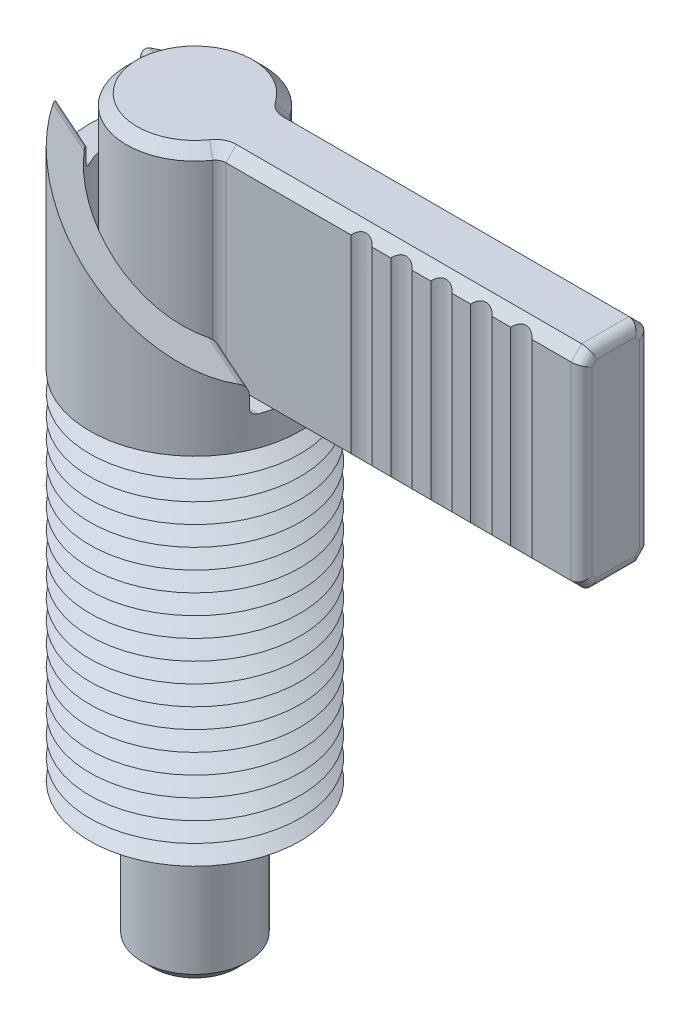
ISO-10303-21;
HEADER;
FILE_DESCRIPTION(('STEP AP214'),'2;1');
FILE_NAME('part.step','',(''),(''),'','','');
FILE_SCHEMA(('AUTOMOTIVE_DESIGN { 1 0 10303 214 1 1 1 1 }'));
ENDSEC;
DATA;
#1=APPLICATION_CONTEXT('core data for automotive mechanical design processes');
#2=APPLICATION_PROTOCOL_DEFINITION('international standard','automotive_design',2000,#1);
#3=PRODUCT_CONTEXT('',#1,'mechanical');
#4=PRODUCT('Part','Part','',(#3));
#5=PRODUCT_RELATED_PRODUCT_CATEGORY('part','',(#4));
#6=PRODUCT_DEFINITION_FORMATION('','',#4);
#7=PRODUCT_DEFINITION_CONTEXT('part definition',#1,'design');
#8=PRODUCT_DEFINITION('design','',#6,#7);
#9=PRODUCT_DEFINITION_SHAPE('','',#8);
#10=(LENGTH_UNIT() NAMED_UNIT(*) SI_UNIT(.MILLI.,.METRE.));
#11=(NAMED_UNIT(*) PLANE_ANGLE_UNIT() SI_UNIT($,.RADIAN.));
#12=(NAMED_UNIT(*) SI_UNIT($,.STERADIAN.) SOLID_ANGLE_UNIT());
#13=UNCERTAINTY_MEASURE_WITH_UNIT(LENGTH_MEASURE(1.E-05),#10,'distance_accuracy_value','');
#14=(GEOMETRIC_REPRESENTATION_CONTEXT(3) GLOBAL_UNCERTAINTY_ASSIGNED_CONTEXT((#13)) GLOBAL_UNIT_ASSIGNED_CONTEXT((#10,
#11,#12)) REPRESENTATION_CONTEXT('',''));
#15=CARTESIAN_POINT('',(0.,0.,0.));
#16=DIRECTION('',(0.,0.,1.));
#17=DIRECTION('',(1.,0.,0.));
#18=AXIS2_PLACEMENT_3D('',#15,#16,#17);
#19=CARTESIAN_POINT('',(4.50333209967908,2.01595551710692,2.6));
#20=DIRECTION('',(0.,0.,1.));
#21=DIRECTION('',(1.,0.,0.));
#22=AXIS2_PLACEMENT_3D('',#19,#20,#21);
#23=PLANE('',#22);
#24=DIRECTION('',(0.,1.,0.));
#25=VECTOR('',#24,1.);
#26=CARTESIAN_POINT('',(16.0792153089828,-9.99999999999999,2.6));
#27=LINE('',#26,#25);
#28=CARTESIAN_POINT('',(16.0792153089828,30.8008,2.6));
#29=VERTEX_POINT('',#28);
#30=CARTESIAN_POINT('',(16.0792153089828,45.1992,2.6));
#31=VERTEX_POINT('',#30);
#32=EDGE_CURVE('P0_E200',#29,#31,#27,.T.);
#33=ORIENTED_EDGE('',*,*,#32,.F.);
#34=DIRECTION('',(1.,0.,0.));
#35=VECTOR('',#34,1.);
#36=CARTESIAN_POINT('',(32.,30.8008,2.6));
#37=LINE('',#36,#35);
#38=CARTESIAN_POINT('',(17.4887846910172,30.8008,2.6));
#39=VERTEX_POINT('',#38);
#40=EDGE_CURVE('P0_E209',#29,#39,#37,.T.);
#41=ORIENTED_EDGE('',*,*,#40,.T.);
#42=DIRECTION('',(0.,1.,0.));
#43=VECTOR('',#42,1.);
#44=CARTESIAN_POINT('',(17.4887846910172,-9.99999999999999,2.6));
#45=LINE('',#44,#43);
#46=CARTESIAN_POINT('',(17.4887846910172,45.1992,2.6));
#47=VERTEX_POINT('',#46);
#48=EDGE_CURVE('P0_E210',#39,#47,#45,.T.);
#49=ORIENTED_EDGE('',*,*,#48,.T.);
#50=DIRECTION('',(-1.,0.,0.));
#51=VECTOR('',#50,1.);
#52=CARTESIAN_POINT('',(4.94410355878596,45.1992,2.6));
#53=LINE('',#52,#51);
#54=EDGE_CURVE('P0_E236',#47,#31,#53,.T.);
#55=ORIENTED_EDGE('',*,*,#54,.T.);
#56=EDGE_LOOP('',(#33,#41,#49,#55));
#57=FACE_BOUND('',#56,.T.);
#58=ADVANCED_FACE('P0_F16',(#57),#23,.T.);
#59=DIRECTION('',(0.,1.,0.));
#60=VECTOR('',#59,1.);
#61=CARTESIAN_POINT('',(19.1192153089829,-9.99999999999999,2.6));
#62=LINE('',#61,#60);
#63=CARTESIAN_POINT('',(19.1192153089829,30.8008,2.6));
#64=VERTEX_POINT('',#63);
#65=CARTESIAN_POINT('',(19.1192153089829,45.1992,2.6));
#66=VERTEX_POINT('',#65);
#67=EDGE_CURVE('P0_E299',#64,#66,#62,.T.);
#68=ORIENTED_EDGE('',*,*,#67,.F.);
#69=CARTESIAN_POINT('',(20.5287846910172,30.8008,2.6));
#70=VERTEX_POINT('',#69);
#71=EDGE_CURVE('P0_E221',#64,#70,#37,.T.);
#72=ORIENTED_EDGE('',*,*,#71,.T.);
#73=DIRECTION('',(0.,1.,0.));
#74=VECTOR('',#73,1.);
#75=CARTESIAN_POINT('',(20.5287846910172,-9.99999999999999,2.6));
#76=LINE('',#75,#74);
#77=CARTESIAN_POINT('',(20.5287846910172,45.1992,2.6));
#78=VERTEX_POINT('',#77);
#79=EDGE_CURVE('P0_E293',#70,#78,#76,.T.);
#80=ORIENTED_EDGE('',*,*,#79,.T.);
#81=EDGE_CURVE('P0_E239',#78,#66,#53,.T.);
#82=ORIENTED_EDGE('',*,*,#81,.T.);
#83=EDGE_LOOP('',(#68,#72,#80,#82));
#84=FACE_BOUND('',#83,.T.);
#85=ADVANCED_FACE('P0_F496',(#84),#23,.T.);
#86=DIRECTION('',(0.,1.,0.));
#87=VECTOR('',#86,1.);
#88=CARTESIAN_POINT('',(22.1592153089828,-9.99999999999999,2.6));
#89=LINE('',#88,#87);
#90=CARTESIAN_POINT('',(22.1592153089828,30.8008,2.6));
#91=VERTEX_POINT('',#90);
#92=CARTESIAN_POINT('',(22.1592153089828,45.1992,2.6));
#93=VERTEX_POINT('',#92);
#94=EDGE_CURVE('P0_E292',#91,#93,#89,.T.);
#95=ORIENTED_EDGE('',*,*,#94,.F.);
#96=CARTESIAN_POINT('',(23.5687846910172,30.8008,2.6));
#97=VERTEX_POINT('',#96);
#98=EDGE_CURVE('P0_E228',#91,#97,#37,.T.);
#99=ORIENTED_EDGE('',*,*,#98,.T.);
#100=DIRECTION('',(0.,1.,0.));
#101=VECTOR('',#100,1.);
#102=CARTESIAN_POINT('',(23.5687846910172,-9.99999999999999,2.6));
#103=LINE('',#102,#101);
#104=CARTESIAN_POINT('',(23.5687846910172,45.1992,2.6));
#105=VERTEX_POINT('',#104);
#106=EDGE_CURVE('P0_E286',#97,#105,#103,.T.);
#107=ORIENTED_EDGE('',*,*,#106,.T.);
#108=EDGE_CURVE('P0_E234',#105,#93,#53,.T.);
#109=ORIENTED_EDGE('',*,*,#108,.T.);
#110=EDGE_LOOP('',(#95,#99,#107,#109));
#111=FACE_BOUND('',#110,.T.);
#112=ADVANCED_FACE('P0_F324',(#111),#23,.T.);
#113=DIRECTION('',(0.,1.,0.));
#114=VECTOR('',#113,1.);
#115=CARTESIAN_POINT('',(25.1992153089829,-9.99999999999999,2.6));
#116=LINE('',#115,#114);
#117=CARTESIAN_POINT('',(25.1992153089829,30.8008,2.6));
#118=VERTEX_POINT('',#117);
#119=CARTESIAN_POINT('',(25.1992153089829,45.1992,2.6));
#120=VERTEX_POINT('',#119);
#121=EDGE_CURVE('P0_E285',#118,#120,#116,.T.);
#122=ORIENTED_EDGE('',*,*,#121,.F.);
#123=CARTESIAN_POINT('',(26.6087846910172,30.8008,2.6));
#124=VERTEX_POINT('',#123);
#125=EDGE_CURVE('P0_E223',#118,#124,#37,.T.);
#126=ORIENTED_EDGE('',*,*,#125,.T.);
#127=DIRECTION('',(0.,1.,0.));
#128=VECTOR('',#127,1.);
#129=CARTESIAN_POINT('',(26.6087846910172,-9.99999999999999,2.6));
#130=LINE('',#129,#128);
#131=CARTESIAN_POINT('',(26.6087846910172,45.1992,2.6));
#132=VERTEX_POINT('',#131);
#133=EDGE_CURVE('P0_E279',#124,#132,#130,.T.);
#134=ORIENTED_EDGE('',*,*,#133,.T.);
#135=EDGE_CURVE('P0_E229',#132,#120,#53,.T.);
#136=ORIENTED_EDGE('',*,*,#135,.T.);
#137=EDGE_LOOP('',(#122,#126,#134,#136));
#138=FACE_BOUND('',#137,.T.);
#139=ADVANCED_FACE('P0_F337',(#138),#23,.T.);
#140=CARTESIAN_POINT('',(28.2392153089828,30.8008,2.6));
#141=VERTEX_POINT('',#140);
#142=CARTESIAN_POINT('',(31.1992,30.8008,2.6));
#143=VERTEX_POINT('',#142);
#144=EDGE_CURVE('P0_E218',#141,#143,#37,.T.);
#145=ORIENTED_EDGE('',*,*,#144,.T.);
#146=DIRECTION('',(0.,1.,0.));
#147=VECTOR('',#146,1.);
#148=CARTESIAN_POINT('',(31.1992,2.01595551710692,2.6));
#149=LINE('',#148,#147);
#150=CARTESIAN_POINT('',(31.1992,45.1992,2.6));
#151=VERTEX_POINT('',#150);
#152=EDGE_CURVE('P0_E11',#143,#151,#149,.T.);
#153=ORIENTED_EDGE('',*,*,#152,.T.);
#154=CARTESIAN_POINT('',(28.2392153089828,45.1992,2.6));
#155=VERTEX_POINT('',#154);
#156=EDGE_CURVE('P0_E224',#151,#155,#53,.T.);
#157=ORIENTED_EDGE('',*,*,#156,.T.);
#158=DIRECTION('',(0.,1.,0.));
#159=VECTOR('',#158,1.);
#160=CARTESIAN_POINT('',(28.2392153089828,-9.99999999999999,2.6));
#161=LINE('',#160,#159);
#162=EDGE_CURVE('P0_E278',#141,#155,#161,.T.);
#163=ORIENTED_EDGE('',*,*,#162,.F.);
#164=EDGE_LOOP('',(#145,#153,#157,#163));
#165=FACE_BOUND('',#164,.T.);
#166=ADVANCED_FACE('P0_F506',(#165),#23,.T.);
#167=CARTESIAN_POINT('',(0.,-9.99999999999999,0.));
#168=DIRECTION('',(0.,1.,0.));
#169=DIRECTION('',(0.,0.,1.));
#170=AXIS2_PLACEMENT_3D('',#167,#168,#169);
#171=PLANE('',#170);
#172=CARTESIAN_POINT('',(0.,-9.99999999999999,0.));
#173=DIRECTION('',(0.,-1.,0.));
#174=DIRECTION('',(0.,0.,-1.));
#175=AXIS2_PLACEMENT_3D('',#172,#173,#174);
#176=CIRCLE('',#175,3.2);
#177=CARTESIAN_POINT('',(0.,-9.99999999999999,-3.2));
#178=VERTEX_POINT('',#177);
#179=EDGE_CURVE('P0_E259',#178,#178,#176,.T.);
#180=ORIENTED_EDGE('',*,*,#179,.T.);
#181=EDGE_LOOP('',(#180));
#182=FACE_BOUND('',#181,.T.);
#183=ADVANCED_FACE('P0_F516',(#182),#171,.F.);
#184=CARTESIAN_POINT('',(0.,-9.19999999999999,0.));
#185=DIRECTION('',(0.,1.,0.));
#186=DIRECTION('',(0.,0.,1.));
#187=AXIS2_PLACEMENT_3D('',#184,#185,#186);
#188=CONICAL_SURFACE('',#187,4.,0.785398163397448);
#189=ORIENTED_EDGE('',*,*,#179,.F.);
#190=EDGE_LOOP('',(#189));
#191=FACE_BOUND('',#190,.T.);
#192=CARTESIAN_POINT('',(0.,-9.19999999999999,0.));
#193=DIRECTION('',(0.,-1.,0.));
#194=DIRECTION('',(0.,0.,-1.));
#195=AXIS2_PLACEMENT_3D('',#192,#193,#194);
#196=CIRCLE('',#195,4.);
#197=CARTESIAN_POINT('',(0.,-9.19999999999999,-4.));
#198=VERTEX_POINT('',#197);
#199=EDGE_CURVE('P0_E262',#198,#198,#196,.T.);
#200=ORIENTED_EDGE('',*,*,#199,.T.);
#201=EDGE_LOOP('',(#200));
#202=FACE_BOUND('',#201,.T.);
#203=ADVANCED_FACE('P0_F521',(#191,#202),#188,.T.);
#204=CARTESIAN_POINT('',(0.,-9.99999999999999,0.));
#205=DIRECTION('',(0.,-1.,0.));
#206=DIRECTION('',(0.,0.,-1.));
#207=AXIS2_PLACEMENT_3D('',#204,#205,#206);
#208=CYLINDRICAL_SURFACE('',#207,4.);
#209=ORIENTED_EDGE('',*,*,#199,.F.);
#210=EDGE_LOOP('',(#209));
#211=FACE_BOUND('',#210,.T.);
#212=CARTESIAN_POINT('',(0.,7.50000000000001,0.));
#213=DIRECTION('',(0.,-1.,0.));
#214=DIRECTION('',(0.,0.,-1.));
#215=AXIS2_PLACEMENT_3D('',#212,#213,#214);
#216=CIRCLE('',#215,4.);
#217=CARTESIAN_POINT('',(0.,7.50000000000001,-4.));
#218=VERTEX_POINT('',#217);
#219=EDGE_CURVE('P0_E265',#218,#218,#216,.T.);
#220=ORIENTED_EDGE('',*,*,#219,.T.);
#221=EDGE_LOOP('',(#220));
#222=FACE_BOUND('',#221,.T.);
#223=ADVANCED_FACE('P0_F555',(#211,#222),#208,.T.);
#224=CARTESIAN_POINT('',(-4.,7.50000000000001,0.));
#225=DIRECTION('',(0.,-1.,0.));
#226=DIRECTION('',(0.,0.,-1.));
#227=AXIS2_PLACEMENT_3D('',#224,#225,#226);
#228=PLANE('',#227);
#229=ORIENTED_EDGE('',*,*,#219,.F.);
#230=EDGE_LOOP('',(#229));
#231=FACE_BOUND('',#230,.T.);
#232=CARTESIAN_POINT('',(0.,7.50000000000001,0.));
#233=DIRECTION('',(0.,-1.,0.));
#234=DIRECTION('',(0.,0.,-1.));
#235=AXIS2_PLACEMENT_3D('',#232,#233,#234);
#236=CIRCLE('',#235,3.);
#237=CARTESIAN_POINT('',(0.,7.50000000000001,-3.));
#238=VERTEX_POINT('',#237);
#239=EDGE_CURVE('P0_E268',#238,#238,#236,.T.);
#240=ORIENTED_EDGE('',*,*,#239,.T.);
#241=EDGE_LOOP('',(#240));
#242=FACE_BOUND('',#241,.T.);
#243=ADVANCED_FACE('P0_F563',(#231,#242),#228,.F.);
#244=CARTESIAN_POINT('',(0.,-9.99999999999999,0.));
#245=DIRECTION('',(0.,-1.,0.));
#246=DIRECTION('',(0.,0.,-1.));
#247=AXIS2_PLACEMENT_3D('',#244,#245,#246);
#248=CYLINDRICAL_SURFACE('',#247,3.);
#249=ORIENTED_EDGE('',*,*,#239,.F.);
#250=EDGE_LOOP('',(#249));
#251=FACE_BOUND('',#250,.T.);
#252=CARTESIAN_POINT('',(0.,30.,0.));
#253=DIRECTION('',(0.,-1.,0.));
#254=DIRECTION('',(0.,0.,-1.));
#255=AXIS2_PLACEMENT_3D('',#252,#253,#254);
#256=CIRCLE('',#255,3.);
#257=CARTESIAN_POINT('',(0.,30.,-3.));
#258=VERTEX_POINT('',#257);
#259=EDGE_CURVE('P0_E271',#258,#258,#256,.T.);
#260=ORIENTED_EDGE('',*,*,#259,.T.);
#261=EDGE_LOOP('',(#260));
#262=FACE_BOUND('',#261,.T.);
#263=ADVANCED_FACE('P0_F571',(#251,#262),#248,.T.);
#264=CARTESIAN_POINT('',(-3.,30.,0.));
#265=DIRECTION('',(0.,1.,0.));
#266=DIRECTION('',(0.,0.,1.));
#267=AXIS2_PLACEMENT_3D('',#264,#265,#266);
#268=PLANE('',#267);
#269=ORIENTED_EDGE('',*,*,#259,.F.);
#270=EDGE_LOOP('',(#269));
#271=FACE_BOUND('',#270,.T.);
#272=DIRECTION('',(1.,0.,0.));
#273=VECTOR('',#272,1.);
#274=CARTESIAN_POINT('',(32.,30.,-1.7992));
#275=LINE('',#274,#273);
#276=CARTESIAN_POINT('',(4.94410355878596,30.,-1.7992));
#277=VERTEX_POINT('',#276);
#278=CARTESIAN_POINT('',(31.1992,30.,-1.7992));
#279=VERTEX_POINT('',#278);
#280=EDGE_CURVE('P0_E247',#277,#279,#275,.T.);
#281=ORIENTED_EDGE('',*,*,#280,.T.);
#282=DIRECTION('',(0.,0.,1.));
#283=VECTOR('',#282,1.);
#284=CARTESIAN_POINT('',(31.1992,30.,1.79920000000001));
#285=LINE('',#284,#283);
#286=CARTESIAN_POINT('',(31.1992,30.,1.7992));
#287=VERTEX_POINT('',#286);
#288=EDGE_CURVE('P0_E40',#279,#287,#285,.T.);
#289=ORIENTED_EDGE('',*,*,#288,.T.);
#290=DIRECTION('',(-1.,0.,0.));
#291=VECTOR('',#290,1.);
#292=CARTESIAN_POINT('',(4.94410355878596,30.,1.7992));
#293=LINE('',#292,#291);
#294=CARTESIAN_POINT('',(4.94410355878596,30.,1.7992));
#295=VERTEX_POINT('',#294);
#296=EDGE_CURVE('P0_E237',#287,#295,#293,.T.);
#297=ORIENTED_EDGE('',*,*,#296,.T.);
#298=CARTESIAN_POINT('',(4.94410355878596,30.,3.4008));
#299=DIRECTION('',(0.,1.,0.));
#300=DIRECTION('',(0.,0.,1.));
#301=AXIS2_PLACEMENT_3D('',#298,#299,#300);
#302=CIRCLE('',#301,1.6016);
#303=CARTESIAN_POINT('',(3.62453345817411,30.,2.49313414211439));
#304=VERTEX_POINT('',#303);
#305=EDGE_CURVE('P0_E240',#295,#304,#302,.T.);
#306=ORIENTED_EDGE('',*,*,#305,.T.);
#307=CARTESIAN_POINT('',(0.,30.,0.));
#308=DIRECTION('',(0.,1.,0.));
#309=DIRECTION('',(0.,0.,1.));
#310=AXIS2_PLACEMENT_3D('',#307,#308,#309);
#311=CIRCLE('',#310,4.3992);
#312=CARTESIAN_POINT('',(3.62453345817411,30.,-2.49313414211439));
#313=VERTEX_POINT('',#312);
#314=EDGE_CURVE('P0_E241',#304,#313,#311,.F.);
#315=ORIENTED_EDGE('',*,*,#314,.T.);
#316=CARTESIAN_POINT('',(4.94410355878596,30.,-3.4008));
#317=DIRECTION('',(0.,1.,0.));
#318=DIRECTION('',(0.,0.,1.));
#319=AXIS2_PLACEMENT_3D('',#316,#317,#318);
#320=CIRCLE('',#319,1.6016);
#321=EDGE_CURVE('P0_E245',#313,#277,#320,.T.);
#322=ORIENTED_EDGE('',*,*,#321,.T.);
#323=EDGE_LOOP('',(#281,#289,#297,#306,#315,#322));
#324=FACE_BOUND('',#323,.T.);
#325=ADVANCED_FACE('P0_F422',(#271,#324),#268,.F.);
#326=CARTESIAN_POINT('',(0.,-9.99999999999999,0.));
#327=DIRECTION('',(0.,-1.,0.));
#328=DIRECTION('',(0.,0.,-1.));
#329=AXIS2_PLACEMENT_3D('',#326,#327,#328);
#330=CYLINDRICAL_SURFACE('',#329,5.2);
#331=DIRECTION('',(0.,-1.,0.));
#332=VECTOR('',#331,1.);
#333=CARTESIAN_POINT('',(4.28431850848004,-9.99999999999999,-2.94696707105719));
#334=LINE('',#333,#332);
#335=CARTESIAN_POINT('',(4.28431850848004,45.1992,-2.94696707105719));
#336=VERTEX_POINT('',#335);
#337=CARTESIAN_POINT('',(4.28431850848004,30.8008,-2.94696707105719));
#338=VERTEX_POINT('',#337);
#339=EDGE_CURVE('P0_E250',#336,#338,#334,.T.);
#340=ORIENTED_EDGE('',*,*,#339,.T.);
#341=CARTESIAN_POINT('',(0.,30.8008,0.));
#342=DIRECTION('',(0.,1.,0.));
#343=DIRECTION('',(0.,0.,1.));
#344=AXIS2_PLACEMENT_3D('',#341,#342,#343);
#345=CIRCLE('',#344,5.2);
#346=CARTESIAN_POINT('',(4.28431850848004,30.8008,2.94696707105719));
#347=VERTEX_POINT('',#346);
#348=EDGE_CURVE('P0_E436',#338,#347,#345,.T.);
#349=ORIENTED_EDGE('',*,*,#348,.T.);
#350=DIRECTION('',(0.,-1.,0.));
#351=VECTOR('',#350,1.);
#352=CARTESIAN_POINT('',(4.28431850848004,-9.99999999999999,2.94696707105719));
#353=LINE('',#352,#351);
#354=CARTESIAN_POINT('',(4.28431850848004,45.1992,2.94696707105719));
#355=VERTEX_POINT('',#354);
#356=EDGE_CURVE('P0_E253',#347,#355,#353,.F.);
#357=ORIENTED_EDGE('',*,*,#356,.T.);
#358=CARTESIAN_POINT('',(0.,45.1992,0.));
#359=DIRECTION('',(0.,-1.,0.));
#360=DIRECTION('',(0.,0.,-1.));
#361=AXIS2_PLACEMENT_3D('',#358,#359,#360);
#362=CIRCLE('',#361,5.2);
#363=EDGE_CURVE('P0_E476',#355,#336,#362,.T.);
#364=ORIENTED_EDGE('',*,*,#363,.T.);
#365=EDGE_LOOP('',(#340,#349,#357,#364));
#366=FACE_BOUND('',#365,.T.);
#367=ADVANCED_FACE('P0_F586',(#366),#330,.T.);
#368=CARTESIAN_POINT('',(-5.2,46.,0.));
#369=DIRECTION('',(0.,-1.,0.));
#370=DIRECTION('',(0.,0.,-1.));
#371=AXIS2_PLACEMENT_3D('',#368,#369,#370);
#372=PLANE('',#371);
#373=DIRECTION('',(1.,0.,0.));
#374=VECTOR('',#373,1.);
#375=CARTESIAN_POINT('',(32.,46.,1.7992));
#376=LINE('',#375,#374);
#377=CARTESIAN_POINT('',(4.94410355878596,46.,1.7992));
#378=VERTEX_POINT('',#377);
#379=CARTESIAN_POINT('',(31.1992,46.,1.7992));
#380=VERTEX_POINT('',#379);
#381=EDGE_CURVE('P0_E343',#378,#380,#376,.T.);
#382=ORIENTED_EDGE('',*,*,#381,.T.);
#383=DIRECTION('',(0.,0.,-1.));
#384=VECTOR('',#383,1.);
#385=CARTESIAN_POINT('',(31.1992,46.,-1.79919999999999));
#386=LINE('',#385,#384);
#387=CARTESIAN_POINT('',(31.1992,46.,-1.7992));
#388=VERTEX_POINT('',#387);
#389=EDGE_CURVE('P0_E375',#380,#388,#386,.T.);
#390=ORIENTED_EDGE('',*,*,#389,.T.);
#391=DIRECTION('',(-1.,0.,0.));
#392=VECTOR('',#391,1.);
#393=CARTESIAN_POINT('',(4.94410355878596,46.,-1.7992));
#394=LINE('',#393,#392);
#395=CARTESIAN_POINT('',(4.94410355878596,46.,-1.7992));
#396=VERTEX_POINT('',#395);
#397=EDGE_CURVE('P0_E465',#388,#396,#394,.T.);
#398=ORIENTED_EDGE('',*,*,#397,.T.);
#399=CARTESIAN_POINT('',(4.94410355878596,46.,-3.4008));
#400=DIRECTION('',(0.,-1.,0.));
#401=DIRECTION('',(0.,0.,-1.));
#402=AXIS2_PLACEMENT_3D('',#399,#400,#401);
#403=CIRCLE('',#402,1.6016);
#404=CARTESIAN_POINT('',(3.62453345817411,46.,-2.49313414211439));
#405=VERTEX_POINT('',#404);
#406=EDGE_CURVE('P0_E463',#396,#405,#403,.T.);
#407=ORIENTED_EDGE('',*,*,#406,.T.);
#408=CARTESIAN_POINT('',(0.,46.,0.));
#409=DIRECTION('',(0.,-1.,0.));
#410=DIRECTION('',(0.,0.,-1.));
#411=AXIS2_PLACEMENT_3D('',#408,#409,#410);
#412=CIRCLE('',#411,4.3992);
#413=CARTESIAN_POINT('',(3.62453345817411,46.,2.49313414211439));
#414=VERTEX_POINT('',#413);
#415=EDGE_CURVE('P0_E461',#405,#414,#412,.F.);
#416=ORIENTED_EDGE('',*,*,#415,.T.);
#417=CARTESIAN_POINT('',(4.94410355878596,46.,3.4008));
#418=DIRECTION('',(0.,-1.,0.));
#419=DIRECTION('',(0.,0.,-1.));
#420=AXIS2_PLACEMENT_3D('',#417,#418,#419);
#421=CIRCLE('',#420,1.6016);
#422=EDGE_CURVE('P0_E348',#414,#378,#421,.T.);
#423=ORIENTED_EDGE('',*,*,#422,.T.);
#424=EDGE_LOOP('',(#382,#390,#398,#407,#416,#423));
#425=FACE_BOUND('',#424,.T.);
#426=ADVANCED_FACE('P0_F594',(#425),#372,.F.);
#427=CARTESIAN_POINT('',(4.50333209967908,2.01595551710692,-2.6));
#428=DIRECTION('',(0.,0.,-1.));
#429=DIRECTION('',(-1.,0.,0.));
#430=AXIS2_PLACEMENT_3D('',#427,#428,#429);
#431=PLANE('',#430);
#432=DIRECTION('',(1.,0.,0.));
#433=VECTOR('',#432,1.);
#434=CARTESIAN_POINT('',(32.,45.1992,-2.6));
#435=LINE('',#434,#433);
#436=CARTESIAN_POINT('',(4.94410355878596,45.1992,-2.6));
#437=VERTEX_POINT('',#436);
#438=CARTESIAN_POINT('',(31.1992,45.1992,-2.6));
#439=VERTEX_POINT('',#438);
#440=EDGE_CURVE('P0_E468',#437,#439,#435,.T.);
#441=ORIENTED_EDGE('',*,*,#440,.T.);
#442=DIRECTION('',(0.,1.,0.));
#443=VECTOR('',#442,1.);
#444=CARTESIAN_POINT('',(31.1992,2.01595551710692,-2.6));
#445=LINE('',#444,#443);
#446=CARTESIAN_POINT('',(31.1992,30.8008,-2.6));
#447=VERTEX_POINT('',#446);
#448=EDGE_CURVE('P0_E379',#439,#447,#445,.F.);
#449=ORIENTED_EDGE('',*,*,#448,.T.);
#450=DIRECTION('',(-1.,0.,0.));
#451=VECTOR('',#450,1.);
#452=CARTESIAN_POINT('',(4.94410355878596,30.8008,-2.6));
#453=LINE('',#452,#451);
#454=CARTESIAN_POINT('',(4.94410355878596,30.8008,-2.6));
#455=VERTEX_POINT('',#454);
#456=EDGE_CURVE('P0_E421',#447,#455,#453,.T.);
#457=ORIENTED_EDGE('',*,*,#456,.T.);
#458=DIRECTION('',(0.,-1.,0.));
#459=VECTOR('',#458,1.);
#460=CARTESIAN_POINT('',(4.94410355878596,2.01595551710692,-2.6));
#461=LINE('',#460,#459);
#462=EDGE_CURVE('P0_E256',#455,#437,#461,.F.);
#463=ORIENTED_EDGE('',*,*,#462,.T.);
#464=EDGE_LOOP('',(#441,#449,#457,#463));
#465=FACE_BOUND('',#464,.T.);
#466=ADVANCED_FACE('P0_F513',(#465),#431,.T.);
#467=CARTESIAN_POINT('',(32.,2.01595551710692,2.6));
#468=DIRECTION('',(1.,0.,0.));
#469=DIRECTION('',(0.,0.,-1.));
#470=AXIS2_PLACEMENT_3D('',#467,#468,#469);
#471=PLANE('',#470);
#472=DIRECTION('',(0.,0.,-1.));
#473=VECTOR('',#472,1.);
#474=CARTESIAN_POINT('',(32.,45.1992,1.7992));
#475=LINE('',#474,#473);
#476=CARTESIAN_POINT('',(32.,45.1992,-1.46749777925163));
#477=VERTEX_POINT('',#476);
#478=CARTESIAN_POINT('',(32.,45.1992,1.46749777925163));
#479=VERTEX_POINT('',#478);
#480=EDGE_CURVE('P0_E367',#477,#479,#475,.F.);
#481=ORIENTED_EDGE('',*,*,#480,.T.);
#482=DIRECTION('',(0.,-0.707106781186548,0.707106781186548));
#483=VECTOR('',#482,1.);
#484=CARTESIAN_POINT('',(32.,23.0413266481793,23.6253711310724));
#485=LINE('',#484,#483);
#486=CARTESIAN_POINT('',(32.,44.8674977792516,1.7992));
#487=VERTEX_POINT('',#486);
#488=EDGE_CURVE('P0_E369',#479,#487,#485,.T.);
#489=ORIENTED_EDGE('',*,*,#488,.T.);
#490=DIRECTION('',(0.,1.,0.));
#491=VECTOR('',#490,1.);
#492=CARTESIAN_POINT('',(32.,2.01595551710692,1.7992));
#493=LINE('',#492,#491);
#494=CARTESIAN_POINT('',(32.,31.1325022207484,1.7992));
#495=VERTEX_POINT('',#494);
#496=EDGE_CURVE('P0_E309',#487,#495,#493,.F.);
#497=ORIENTED_EDGE('',*,*,#496,.T.);
#498=DIRECTION('',(0.,-0.707106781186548,-0.707106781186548));
#499=VECTOR('',#498,1.);
#500=CARTESIAN_POINT('',(32.,16.9746288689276,-12.3586733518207));
#501=LINE('',#500,#499);
#502=CARTESIAN_POINT('',(32.,30.8008,1.46749777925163));
#503=VERTEX_POINT('',#502);
#504=EDGE_CURVE('P0_E357',#495,#503,#501,.T.);
#505=ORIENTED_EDGE('',*,*,#504,.T.);
#506=DIRECTION('',(0.,0.,1.));
#507=VECTOR('',#506,1.);
#508=CARTESIAN_POINT('',(32.,30.8008,-1.7992));
#509=LINE('',#508,#507);
#510=CARTESIAN_POINT('',(32.,30.8008,-1.46749777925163));
#511=VERTEX_POINT('',#510);
#512=EDGE_CURVE('P0_E359',#503,#511,#509,.F.);
#513=ORIENTED_EDGE('',*,*,#512,.T.);
#514=DIRECTION('',(0.,0.707106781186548,-0.707106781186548));
#515=VECTOR('',#514,1.);
#516=CARTESIAN_POINT('',(32.,14.3746288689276,14.9586733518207));
#517=LINE('',#516,#515);
#518=CARTESIAN_POINT('',(32.,31.1325022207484,-1.7992));
#519=VERTEX_POINT('',#518);
#520=EDGE_CURVE('P0_E361',#511,#519,#517,.T.);
#521=ORIENTED_EDGE('',*,*,#520,.T.);
#522=DIRECTION('',(0.,1.,0.));
#523=VECTOR('',#522,1.);
#524=CARTESIAN_POINT('',(32.,2.01595551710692,-1.7992));
#525=LINE('',#524,#523);
#526=CARTESIAN_POINT('',(32.,44.8674977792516,-1.7992));
#527=VERTEX_POINT('',#526);
#528=EDGE_CURVE('P0_E363',#519,#527,#525,.T.);
#529=ORIENTED_EDGE('',*,*,#528,.T.);
#530=DIRECTION('',(0.,0.707106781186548,0.707106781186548));
#531=VECTOR('',#530,1.);
#532=CARTESIAN_POINT('',(32.,25.6413266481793,-21.0253711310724));
#533=LINE('',#532,#531);
#534=EDGE_CURVE('P0_E365',#527,#477,#533,.T.);
#535=ORIENTED_EDGE('',*,*,#534,.T.);
#536=EDGE_LOOP('',(#481,#489,#497,#505,#513,#521,#529,#535));
#537=FACE_BOUND('',#536,.T.);
#538=ADVANCED_FACE('P0_F505',(#537),#471,.T.);
#539=DIRECTION('',(0.,1.,0.));
#540=VECTOR('',#539,1.);
#541=CARTESIAN_POINT('',(14.4487846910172,-9.99999999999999,2.6));
#542=LINE('',#541,#540);
#543=CARTESIAN_POINT('',(14.4487846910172,30.8008,2.6));
#544=VERTEX_POINT('',#543);
#545=CARTESIAN_POINT('',(14.4487846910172,45.1992,2.6));
#546=VERTEX_POINT('',#545);
#547=EDGE_CURVE('P0_E190',#544,#546,#542,.T.);
#548=ORIENTED_EDGE('',*,*,#547,.T.);
#549=CARTESIAN_POINT('',(4.94410355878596,45.1992,2.6));
#550=VERTEX_POINT('',#549);
#551=EDGE_CURVE('P0_E230',#546,#550,#53,.T.);
#552=ORIENTED_EDGE('',*,*,#551,.T.);
#553=DIRECTION('',(0.,-1.,0.));
#554=VECTOR('',#553,1.);
#555=CARTESIAN_POINT('',(4.94410355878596,2.01595551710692,2.6));
#556=LINE('',#555,#554);
#557=CARTESIAN_POINT('',(4.94410355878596,30.8008,2.6));
#558=VERTEX_POINT('',#557);
#559=EDGE_CURVE('P0_E215',#550,#558,#556,.T.);
#560=ORIENTED_EDGE('',*,*,#559,.T.);
#561=EDGE_CURVE('P0_E206',#558,#544,#37,.T.);
#562=ORIENTED_EDGE('',*,*,#561,.T.);
#563=EDGE_LOOP('',(#548,#552,#560,#562));
#564=FACE_BOUND('',#563,.T.);
#565=ADVANCED_FACE('P0_F213',(#564),#23,.T.);
#566=CARTESIAN_POINT('',(4.94410355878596,-9.99999999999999,-3.4008));
#567=DIRECTION('',(0.,-1.,0.));
#568=DIRECTION('',(0.,0.,-1.));
#569=AXIS2_PLACEMENT_3D('',#566,#567,#568);
#570=CYLINDRICAL_SURFACE('',#569,0.8008);
#571=ORIENTED_EDGE('',*,*,#462,.F.);
#572=CARTESIAN_POINT('',(4.94410355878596,30.8008,-3.4008));
#573=DIRECTION('',(0.,1.,0.));
#574=DIRECTION('',(0.,0.,1.));
#575=AXIS2_PLACEMENT_3D('',#572,#573,#574);
#576=CIRCLE('',#575,0.8008);
#577=EDGE_CURVE('P0_E471',#455,#338,#576,.F.);
#578=ORIENTED_EDGE('',*,*,#577,.T.);
#579=ORIENTED_EDGE('',*,*,#339,.F.);
#580=CARTESIAN_POINT('',(4.94410355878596,45.1992,-3.4008));
#581=DIRECTION('',(0.,-1.,0.));
#582=DIRECTION('',(0.,0.,-1.));
#583=AXIS2_PLACEMENT_3D('',#580,#581,#582);
#584=CIRCLE('',#583,0.8008);
#585=EDGE_CURVE('P0_E473',#336,#437,#584,.F.);
#586=ORIENTED_EDGE('',*,*,#585,.T.);
#587=EDGE_LOOP('',(#571,#578,#579,#586));
#588=FACE_BOUND('',#587,.T.);
#589=ADVANCED_FACE('P0_F504',(#588),#570,.F.);
#590=CARTESIAN_POINT('',(4.94410355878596,-9.99999999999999,3.4008));
#591=DIRECTION('',(0.,-1.,0.));
#592=DIRECTION('',(0.,0.,-1.));
#593=AXIS2_PLACEMENT_3D('',#590,#591,#592);
#594=CYLINDRICAL_SURFACE('',#593,0.8008);
#595=ORIENTED_EDGE('',*,*,#356,.F.);
#596=CARTESIAN_POINT('',(4.94410355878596,30.8008,3.4008));
#597=DIRECTION('',(0.,1.,0.));
#598=DIRECTION('',(0.,0.,1.));
#599=AXIS2_PLACEMENT_3D('',#596,#597,#598);
#600=CIRCLE('',#599,0.8008);
#601=EDGE_CURVE('P0_E219',#347,#558,#600,.F.);
#602=ORIENTED_EDGE('',*,*,#601,.T.);
#603=ORIENTED_EDGE('',*,*,#559,.F.);
#604=CARTESIAN_POINT('',(4.94410355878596,45.1992,3.4008));
#605=DIRECTION('',(0.,-1.,0.));
#606=DIRECTION('',(0.,0.,-1.));
#607=AXIS2_PLACEMENT_3D('',#604,#605,#606);
#608=CIRCLE('',#607,0.8008);
#609=EDGE_CURVE('P0_E216',#550,#355,#608,.F.);
#610=ORIENTED_EDGE('',*,*,#609,.T.);
#611=EDGE_LOOP('',(#595,#602,#603,#610));
#612=FACE_BOUND('',#611,.T.);
#613=ADVANCED_FACE('P0_F481',(#612),#594,.F.);
#614=CARTESIAN_POINT('',(-3.,30.,-1.7992));
#615=DIRECTION('',(0.,-0.707106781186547,-0.707106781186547));
#616=DIRECTION('',(0.,0.707106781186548,-0.707106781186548));
#617=AXIS2_PLACEMENT_3D('',#614,#615,#616);
#618=PLANE('',#617);
#619=ORIENTED_EDGE('',*,*,#456,.F.);
#620=DIRECTION('',(0.,0.707106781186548,-0.707106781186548));
#621=VECTOR('',#620,1.);
#622=CARTESIAN_POINT('',(31.1992,30.,-1.7992));
#623=LINE('',#622,#621);
#624=EDGE_CURVE('P0_E381',#447,#279,#623,.F.);
#625=ORIENTED_EDGE('',*,*,#624,.T.);
#626=ORIENTED_EDGE('',*,*,#280,.F.);
#627=DIRECTION('',(0.,-0.707106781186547,0.707106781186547));
#628=VECTOR('',#627,1.);
#629=CARTESIAN_POINT('',(4.94410355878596,30.8008,-2.6));
#630=LINE('',#629,#628);
#631=EDGE_CURVE('P0_E274',#455,#277,#630,.T.);
#632=ORIENTED_EDGE('',*,*,#631,.F.);
#633=EDGE_LOOP('',(#619,#625,#626,#632));
#634=FACE_BOUND('',#633,.T.);
#635=ADVANCED_FACE('P0_F418',(#634),#618,.T.);
#636=CARTESIAN_POINT('',(4.94410355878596,30.,-3.4008));
#637=DIRECTION('',(0.,-1.,0.));
#638=DIRECTION('',(0.,0.,-1.));
#639=AXIS2_PLACEMENT_3D('',#636,#637,#638);
#640=CONICAL_SURFACE('',#639,1.6016,0.785398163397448);
#641=ORIENTED_EDGE('',*,*,#631,.T.);
#642=ORIENTED_EDGE('',*,*,#321,.F.);
#643=DIRECTION('',(-0.582590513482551,-0.707106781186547,0.400734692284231));
#644=VECTOR('',#643,1.);
#645=CARTESIAN_POINT('',(4.28431850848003,30.8008,-2.94696707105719));
#646=LINE('',#645,#644);
#647=EDGE_CURVE('P0_E430',#338,#313,#646,.T.);
#648=ORIENTED_EDGE('',*,*,#647,.F.);
#649=ORIENTED_EDGE('',*,*,#577,.F.);
#650=EDGE_LOOP('',(#641,#642,#648,#649));
#651=FACE_BOUND('',#650,.T.);
#652=ADVANCED_FACE('P0_F428',(#651),#640,.F.);
#653=CARTESIAN_POINT('',(0.,30.,0.));
#654=DIRECTION('',(0.,1.,0.));
#655=DIRECTION('',(0.,0.,1.));
#656=AXIS2_PLACEMENT_3D('',#653,#654,#655);
#657=CONICAL_SURFACE('',#656,4.3992,0.785398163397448);
#658=ORIENTED_EDGE('',*,*,#647,.T.);
#659=ORIENTED_EDGE('',*,*,#314,.F.);
#660=DIRECTION('',(-0.582590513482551,-0.707106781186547,-0.400734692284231));
#661=VECTOR('',#660,1.);
#662=CARTESIAN_POINT('',(4.28431850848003,30.8008,2.94696707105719));
#663=LINE('',#662,#661);
#664=EDGE_CURVE('P0_E437',#347,#304,#663,.T.);
#665=ORIENTED_EDGE('',*,*,#664,.F.);
#666=ORIENTED_EDGE('',*,*,#348,.F.);
#667=EDGE_LOOP('',(#658,#659,#665,#666));
#668=FACE_BOUND('',#667,.T.);
#669=ADVANCED_FACE('P0_F433',(#668),#657,.T.);
#670=CARTESIAN_POINT('',(4.94410355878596,30.,3.4008));
#671=DIRECTION('',(0.,-1.,0.));
#672=DIRECTION('',(0.,0.,-1.));
#673=AXIS2_PLACEMENT_3D('',#670,#671,#672);
#674=CONICAL_SURFACE('',#673,1.6016,0.785398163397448);
#675=ORIENTED_EDGE('',*,*,#664,.T.);
#676=ORIENTED_EDGE('',*,*,#305,.F.);
#677=DIRECTION('',(0.,-0.707106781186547,-0.707106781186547));
#678=VECTOR('',#677,1.);
#679=CARTESIAN_POINT('',(4.94410355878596,30.8008,2.6));
#680=LINE('',#679,#678);
#681=EDGE_CURVE('P0_E440',#558,#295,#680,.T.);
#682=ORIENTED_EDGE('',*,*,#681,.F.);
#683=ORIENTED_EDGE('',*,*,#601,.F.);
#684=EDGE_LOOP('',(#675,#676,#682,#683));
#685=FACE_BOUND('',#684,.T.);
#686=ADVANCED_FACE('P0_F484',(#685),#674,.F.);
#687=CARTESIAN_POINT('',(-3.,30.,1.7992));
#688=DIRECTION('',(0.,-0.707106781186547,0.707106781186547));
#689=DIRECTION('',(0.,-0.707106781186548,-0.707106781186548));
#690=AXIS2_PLACEMENT_3D('',#687,#688,#689);
#691=PLANE('',#690);
#692=ORIENTED_EDGE('',*,*,#296,.F.);
#693=DIRECTION('',(0.,-0.707106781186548,-0.707106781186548));
#694=VECTOR('',#693,1.);
#695=CARTESIAN_POINT('',(31.1992,30.,1.7992));
#696=LINE('',#695,#694);
#697=EDGE_CURVE('P0_E25',#287,#143,#696,.F.);
#698=ORIENTED_EDGE('',*,*,#697,.T.);
#699=ORIENTED_EDGE('',*,*,#144,.F.);
#700=CARTESIAN_POINT('',(27.424,31.5688,3.368));
#701=DIRECTION('',(0.,-0.707106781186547,0.707106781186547));
#702=DIRECTION('',(0.,0.707106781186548,0.707106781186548));
#703=AXIS2_PLACEMENT_3D('',#700,#701,#702);
#704=ELLIPSE('',#703,1.58391918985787,1.12);
#705=EDGE_CURVE('P0_E275',#124,#141,#704,.T.);
#706=ORIENTED_EDGE('',*,*,#705,.F.);
#707=ORIENTED_EDGE('',*,*,#125,.F.);
#708=CARTESIAN_POINT('',(24.384,31.5688,3.368));
#709=DIRECTION('',(0.,-0.707106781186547,0.707106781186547));
#710=DIRECTION('',(0.,0.707106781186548,0.707106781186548));
#711=AXIS2_PLACEMENT_3D('',#708,#709,#710);
#712=ELLIPSE('',#711,1.58391918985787,1.12);
#713=EDGE_CURVE('P0_E282',#97,#118,#712,.T.);
#714=ORIENTED_EDGE('',*,*,#713,.F.);
#715=ORIENTED_EDGE('',*,*,#98,.F.);
#716=CARTESIAN_POINT('',(21.344,31.5688,3.368));
#717=DIRECTION('',(0.,-0.707106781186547,0.707106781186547));
#718=DIRECTION('',(0.,0.707106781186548,0.707106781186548));
#719=AXIS2_PLACEMENT_3D('',#716,#717,#718);
#720=ELLIPSE('',#719,1.58391918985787,1.12);
#721=EDGE_CURVE('P0_E289',#70,#91,#720,.T.);
#722=ORIENTED_EDGE('',*,*,#721,.F.);
#723=ORIENTED_EDGE('',*,*,#71,.F.);
#724=CARTESIAN_POINT('',(18.304,31.5688,3.368));
#725=DIRECTION('',(0.,-0.707106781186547,0.707106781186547));
#726=DIRECTION('',(0.,0.707106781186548,0.707106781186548));
#727=AXIS2_PLACEMENT_3D('',#724,#725,#726);
#728=ELLIPSE('',#727,1.58391918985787,1.12);
#729=EDGE_CURVE('P0_E296',#39,#64,#728,.T.);
#730=ORIENTED_EDGE('',*,*,#729,.F.);
#731=ORIENTED_EDGE('',*,*,#40,.F.);
#732=CARTESIAN_POINT('',(15.264,31.5688,3.368));
#733=DIRECTION('',(0.,-0.707106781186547,0.707106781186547));
#734=DIRECTION('',(0.,0.707106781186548,0.707106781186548));
#735=AXIS2_PLACEMENT_3D('',#732,#733,#734);
#736=ELLIPSE('',#735,1.58391918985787,1.12);
#737=EDGE_CURVE('P0_E193',#544,#29,#736,.T.);
#738=ORIENTED_EDGE('',*,*,#737,.F.);
#739=ORIENTED_EDGE('',*,*,#561,.F.);
#740=ORIENTED_EDGE('',*,*,#681,.T.);
#741=EDGE_LOOP('',(#692,#698,#699,#706,#707,#714,#715,#722,#723,#730,#731,#738,#739,#740));
#742=FACE_BOUND('',#741,.T.);
#743=ADVANCED_FACE('P0_F204',(#742),#691,.T.);
#744=CARTESIAN_POINT('',(-5.2,46.,-1.7992));
#745=DIRECTION('',(0.,0.707106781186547,-0.707106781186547));
#746=DIRECTION('',(0.,0.707106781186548,0.707106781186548));
#747=AXIS2_PLACEMENT_3D('',#744,#745,#746);
#748=PLANE('',#747);
#749=ORIENTED_EDGE('',*,*,#397,.F.);
#750=DIRECTION('',(0.,0.707106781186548,0.707106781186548));
#751=VECTOR('',#750,1.);
#752=CARTESIAN_POINT('',(31.1992,46.,-1.7992));
#753=LINE('',#752,#751);
#754=EDGE_CURVE('P0_E377',#388,#439,#753,.F.);
#755=ORIENTED_EDGE('',*,*,#754,.T.);
#756=ORIENTED_EDGE('',*,*,#440,.F.);
#757=DIRECTION('',(0.,-0.707106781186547,-0.707106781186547));
#758=VECTOR('',#757,1.);
#759=CARTESIAN_POINT('',(4.94410355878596,46.,-1.7992));
#760=LINE('',#759,#758);
#761=EDGE_CURVE('P0_E351',#396,#437,#760,.T.);
#762=ORIENTED_EDGE('',*,*,#761,.F.);
#763=EDGE_LOOP('',(#749,#755,#756,#762));
#764=FACE_BOUND('',#763,.T.);
#765=ADVANCED_FACE('P0_F492',(#764),#748,.T.);
#766=CARTESIAN_POINT('',(4.94410355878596,46.,-3.4008));
#767=DIRECTION('',(0.,1.,0.));
#768=DIRECTION('',(0.,0.,1.));
#769=AXIS2_PLACEMENT_3D('',#766,#767,#768);
#770=CONICAL_SURFACE('',#769,1.6016,0.785398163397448);
#771=ORIENTED_EDGE('',*,*,#761,.T.);
#772=ORIENTED_EDGE('',*,*,#585,.F.);
#773=DIRECTION('',(0.582590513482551,-0.707106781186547,-0.400734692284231));
#774=VECTOR('',#773,1.);
#775=CARTESIAN_POINT('',(3.62453345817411,46.,-2.49313414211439));
#776=LINE('',#775,#774);
#777=EDGE_CURVE('P0_E447',#405,#336,#776,.T.);
#778=ORIENTED_EDGE('',*,*,#777,.F.);
#779=ORIENTED_EDGE('',*,*,#406,.F.);
#780=EDGE_LOOP('',(#771,#772,#778,#779));
#781=FACE_BOUND('',#780,.T.);
#782=ADVANCED_FACE('P0_F653',(#781),#770,.F.);
#783=CARTESIAN_POINT('',(0.,45.1992,0.));
#784=DIRECTION('',(0.,-1.,0.));
#785=DIRECTION('',(0.,0.,-1.));
#786=AXIS2_PLACEMENT_3D('',#783,#784,#785);
#787=CONICAL_SURFACE('',#786,5.2,0.785398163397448);
#788=ORIENTED_EDGE('',*,*,#777,.T.);
#789=ORIENTED_EDGE('',*,*,#363,.F.);
#790=DIRECTION('',(0.582590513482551,-0.707106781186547,0.400734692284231));
#791=VECTOR('',#790,1.);
#792=CARTESIAN_POINT('',(3.62453345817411,46.,2.49313414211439));
#793=LINE('',#792,#791);
#794=EDGE_CURVE('P0_E445',#414,#355,#793,.T.);
#795=ORIENTED_EDGE('',*,*,#794,.F.);
#796=ORIENTED_EDGE('',*,*,#415,.F.);
#797=EDGE_LOOP('',(#788,#789,#795,#796));
#798=FACE_BOUND('',#797,.T.);
#799=ADVANCED_FACE('P0_F661',(#798),#787,.T.);
#800=CARTESIAN_POINT('',(4.94410355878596,46.,3.4008));
#801=DIRECTION('',(0.,1.,0.));
#802=DIRECTION('',(0.,0.,1.));
#803=AXIS2_PLACEMENT_3D('',#800,#801,#802);
#804=CONICAL_SURFACE('',#803,1.6016,0.785398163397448);
#805=ORIENTED_EDGE('',*,*,#794,.T.);
#806=ORIENTED_EDGE('',*,*,#609,.F.);
#807=DIRECTION('',(0.,-0.707106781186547,0.707106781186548));
#808=VECTOR('',#807,1.);
#809=CARTESIAN_POINT('',(4.94410355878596,46.,1.7992));
#810=LINE('',#809,#808);
#811=EDGE_CURVE('P0_E277',#378,#550,#810,.T.);
#812=ORIENTED_EDGE('',*,*,#811,.F.);
#813=ORIENTED_EDGE('',*,*,#422,.F.);
#814=EDGE_LOOP('',(#805,#806,#812,#813));
#815=FACE_BOUND('',#814,.T.);
#816=ADVANCED_FACE('P0_F668',(#815),#804,.F.);
#817=CARTESIAN_POINT('',(-5.2,46.,1.7992));
#818=DIRECTION('',(0.,0.707106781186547,0.707106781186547));
#819=DIRECTION('',(0.,-0.707106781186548,0.707106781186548));
#820=AXIS2_PLACEMENT_3D('',#817,#818,#819);
#821=PLANE('',#820);
#822=ORIENTED_EDGE('',*,*,#156,.F.);
#823=DIRECTION('',(0.,-0.707106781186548,0.707106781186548));
#824=VECTOR('',#823,1.);
#825=CARTESIAN_POINT('',(31.1992,46.,1.7992));
#826=LINE('',#825,#824);
#827=EDGE_CURVE('P0_E372',#151,#380,#826,.F.);
#828=ORIENTED_EDGE('',*,*,#827,.T.);
#829=ORIENTED_EDGE('',*,*,#381,.F.);
#830=ORIENTED_EDGE('',*,*,#811,.T.);
#831=ORIENTED_EDGE('',*,*,#551,.F.);
#832=CARTESIAN_POINT('',(15.264,44.4312,3.368));
#833=DIRECTION('',(0.,0.707106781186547,0.707106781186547));
#834=DIRECTION('',(0.,0.707106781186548,-0.707106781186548));
#835=AXIS2_PLACEMENT_3D('',#832,#833,#834);
#836=ELLIPSE('',#835,1.58391918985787,1.12);
#837=EDGE_CURVE('P0_E196',#31,#546,#836,.T.);
#838=ORIENTED_EDGE('',*,*,#837,.F.);
#839=ORIENTED_EDGE('',*,*,#54,.F.);
#840=CARTESIAN_POINT('',(18.304,44.4312,3.368));
#841=DIRECTION('',(0.,0.707106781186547,0.707106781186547));
#842=DIRECTION('',(0.,0.707106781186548,-0.707106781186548));
#843=AXIS2_PLACEMENT_3D('',#840,#841,#842);
#844=ELLIPSE('',#843,1.58391918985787,1.12);
#845=EDGE_CURVE('P0_E310',#66,#47,#844,.T.);
#846=ORIENTED_EDGE('',*,*,#845,.F.);
#847=ORIENTED_EDGE('',*,*,#81,.F.);
#848=CARTESIAN_POINT('',(21.344,44.4312,3.368));
#849=DIRECTION('',(0.,0.707106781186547,0.707106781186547));
#850=DIRECTION('',(0.,0.707106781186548,-0.707106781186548));
#851=AXIS2_PLACEMENT_3D('',#848,#849,#850);
#852=ELLIPSE('',#851,1.58391918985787,1.12);
#853=EDGE_CURVE('P0_E345',#93,#78,#852,.T.);
#854=ORIENTED_EDGE('',*,*,#853,.F.);
#855=ORIENTED_EDGE('',*,*,#108,.F.);
#856=CARTESIAN_POINT('',(24.384,44.4312,3.368));
#857=DIRECTION('',(0.,0.707106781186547,0.707106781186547));
#858=DIRECTION('',(0.,0.707106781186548,-0.707106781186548));
#859=AXIS2_PLACEMENT_3D('',#856,#857,#858);
#860=ELLIPSE('',#859,1.58391918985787,1.12);
#861=EDGE_CURVE('P0_E332',#120,#105,#860,.T.);
#862=ORIENTED_EDGE('',*,*,#861,.F.);
#863=ORIENTED_EDGE('',*,*,#135,.F.);
#864=CARTESIAN_POINT('',(27.424,44.4312,3.368));
#865=DIRECTION('',(0.,0.707106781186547,0.707106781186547));
#866=DIRECTION('',(0.,0.707106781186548,-0.707106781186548));
#867=AXIS2_PLACEMENT_3D('',#864,#865,#866);
#868=ELLIPSE('',#867,1.58391918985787,1.12);
#869=EDGE_CURVE('P0_E342',#155,#132,#868,.T.);
#870=ORIENTED_EDGE('',*,*,#869,.F.);
#871=EDGE_LOOP('',(#822,#828,#829,#830,#831,#838,#839,#846,#847,#854,#855,#862,#863,#870));
#872=FACE_BOUND('',#871,.T.);
#873=ADVANCED_FACE('P0_F306',(#872),#821,.T.);
#874=CARTESIAN_POINT('',(27.424,-9.99999999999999,3.368));
#875=DIRECTION('',(0.,1.,0.));
#876=DIRECTION('',(0.,0.,1.));
#877=AXIS2_PLACEMENT_3D('',#874,#875,#876);
#878=CYLINDRICAL_SURFACE('',#877,1.12);
#879=ORIENTED_EDGE('',*,*,#705,.T.);
#880=ORIENTED_EDGE('',*,*,#162,.T.);
#881=ORIENTED_EDGE('',*,*,#869,.T.);
#882=ORIENTED_EDGE('',*,*,#133,.F.);
#883=EDGE_LOOP('',(#879,#880,#881,#882));
#884=FACE_BOUND('',#883,.T.);
#885=ADVANCED_FACE('P0_F340',(#884),#878,.F.);
#886=CARTESIAN_POINT('',(24.384,-9.99999999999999,3.368));
#887=DIRECTION('',(0.,1.,0.));
#888=DIRECTION('',(0.,0.,1.));
#889=AXIS2_PLACEMENT_3D('',#886,#887,#888);
#890=CYLINDRICAL_SURFACE('',#889,1.12);
#891=ORIENTED_EDGE('',*,*,#713,.T.);
#892=ORIENTED_EDGE('',*,*,#121,.T.);
#893=ORIENTED_EDGE('',*,*,#861,.T.);
#894=ORIENTED_EDGE('',*,*,#106,.F.);
#895=EDGE_LOOP('',(#891,#892,#893,#894));
#896=FACE_BOUND('',#895,.T.);
#897=ADVANCED_FACE('P0_F329',(#896),#890,.F.);
#898=CARTESIAN_POINT('',(21.344,-9.99999999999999,3.368));
#899=DIRECTION('',(0.,1.,0.));
#900=DIRECTION('',(0.,0.,1.));
#901=AXIS2_PLACEMENT_3D('',#898,#899,#900);
#902=CYLINDRICAL_SURFACE('',#901,1.12);
#903=ORIENTED_EDGE('',*,*,#721,.T.);
#904=ORIENTED_EDGE('',*,*,#94,.T.);
#905=ORIENTED_EDGE('',*,*,#853,.T.);
#906=ORIENTED_EDGE('',*,*,#79,.F.);
#907=EDGE_LOOP('',(#903,#904,#905,#906));
#908=FACE_BOUND('',#907,.T.);
#909=ADVANCED_FACE('P0_F694',(#908),#902,.F.);
#910=CARTESIAN_POINT('',(18.304,-9.99999999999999,3.368));
#911=DIRECTION('',(0.,1.,0.));
#912=DIRECTION('',(0.,0.,1.));
#913=AXIS2_PLACEMENT_3D('',#910,#911,#912);
#914=CYLINDRICAL_SURFACE('',#913,1.12);
#915=ORIENTED_EDGE('',*,*,#729,.T.);
#916=ORIENTED_EDGE('',*,*,#67,.T.);
#917=ORIENTED_EDGE('',*,*,#845,.T.);
#918=ORIENTED_EDGE('',*,*,#48,.F.);
#919=EDGE_LOOP('',(#915,#916,#917,#918));
#920=FACE_BOUND('',#919,.T.);
#921=ADVANCED_FACE('P0_F314',(#920),#914,.F.);
#922=CARTESIAN_POINT('',(15.264,-9.99999999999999,3.368));
#923=DIRECTION('',(0.,1.,0.));
#924=DIRECTION('',(0.,0.,1.));
#925=AXIS2_PLACEMENT_3D('',#922,#923,#924);
#926=CYLINDRICAL_SURFACE('',#925,1.12);
#927=ORIENTED_EDGE('',*,*,#737,.T.);
#928=ORIENTED_EDGE('',*,*,#32,.T.);
#929=ORIENTED_EDGE('',*,*,#837,.T.);
#930=ORIENTED_EDGE('',*,*,#547,.F.);
#931=EDGE_LOOP('',(#927,#928,#929,#930));
#932=FACE_BOUND('',#931,.T.);
#933=ADVANCED_FACE('P0_F192',(#932),#926,.F.);
#934=CARTESIAN_POINT('',(31.1992,14.3746288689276,14.9586733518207));
#935=DIRECTION('',(0.,0.707106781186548,-0.707106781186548));
#936=DIRECTION('',(0.,0.707106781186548,0.707106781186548));
#937=AXIS2_PLACEMENT_3D('',#934,#935,#936);
#938=CYLINDRICAL_SURFACE('',#937,0.8008);
#939=CARTESIAN_POINT('',(31.1992,30.8008,-1.46749777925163));
#940=DIRECTION('',(0.,0.38268343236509,-0.923879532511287));
#941=DIRECTION('',(0.,-0.923879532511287,-0.38268343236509));
#942=AXIS2_PLACEMENT_3D('',#939,#940,#941);
#943=ELLIPSE('',#942,0.866779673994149,0.8008);
#944=EDGE_CURVE('P0_E400',#279,#511,#943,.F.);
#945=ORIENTED_EDGE('',*,*,#944,.F.);
#946=ORIENTED_EDGE('',*,*,#624,.F.);
#947=CARTESIAN_POINT('',(31.1992,31.1325022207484,-1.7992));
#948=DIRECTION('',(0.,0.923879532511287,-0.38268343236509));
#949=DIRECTION('',(0.,-0.38268343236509,-0.923879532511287));
#950=AXIS2_PLACEMENT_3D('',#947,#948,#949);
#951=ELLIPSE('',#950,0.866779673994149,0.8008);
#952=EDGE_CURVE('P0_E20',#519,#447,#951,.T.);
#953=ORIENTED_EDGE('',*,*,#952,.F.);
#954=ORIENTED_EDGE('',*,*,#520,.F.);
#955=EDGE_LOOP('',(#945,#946,#953,#954));
#956=FACE_BOUND('',#955,.T.);
#957=ADVANCED_FACE('P0_F18',(#956),#938,.T.);
#958=CARTESIAN_POINT('',(31.1992,2.01595551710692,-1.7992));
#959=DIRECTION('',(0.,1.,0.));
#960=DIRECTION('',(0.,0.,1.));
#961=AXIS2_PLACEMENT_3D('',#958,#959,#960);
#962=CYLINDRICAL_SURFACE('',#961,0.8008);
#963=ORIENTED_EDGE('',*,*,#952,.T.);
#964=ORIENTED_EDGE('',*,*,#448,.F.);
#965=CARTESIAN_POINT('',(31.1992,44.8674977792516,-1.7992));
#966=DIRECTION('',(0.,0.923879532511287,0.38268343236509));
#967=DIRECTION('',(0.,0.38268343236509,-0.923879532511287));
#968=AXIS2_PLACEMENT_3D('',#965,#966,#967);
#969=ELLIPSE('',#968,0.866779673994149,0.8008);
#970=EDGE_CURVE('P0_E398',#527,#439,#969,.T.);
#971=ORIENTED_EDGE('',*,*,#970,.F.);
#972=ORIENTED_EDGE('',*,*,#528,.F.);
#973=EDGE_LOOP('',(#963,#964,#971,#972));
#974=FACE_BOUND('',#973,.T.);
#975=ADVANCED_FACE('P0_F410',(#974),#962,.T.);
#976=CARTESIAN_POINT('',(31.1992,30.8008,0.));
#977=DIRECTION('',(0.,0.,-1.));
#978=DIRECTION('',(-1.,0.,0.));
#979=AXIS2_PLACEMENT_3D('',#976,#977,#978);
#980=CYLINDRICAL_SURFACE('',#979,0.8008);
#981=ORIENTED_EDGE('',*,*,#944,.T.);
#982=ORIENTED_EDGE('',*,*,#512,.F.);
#983=CARTESIAN_POINT('',(31.1992,30.8008,1.46749777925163));
#984=DIRECTION('',(0.,-0.38268343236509,-0.923879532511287));
#985=DIRECTION('',(0.,-0.923879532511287,0.38268343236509));
#986=AXIS2_PLACEMENT_3D('',#983,#984,#985);
#987=ELLIPSE('',#986,0.866779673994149,0.8008);
#988=EDGE_CURVE('P0_E395',#287,#503,#987,.F.);
#989=ORIENTED_EDGE('',*,*,#988,.F.);
#990=ORIENTED_EDGE('',*,*,#288,.F.);
#991=EDGE_LOOP('',(#981,#982,#989,#990));
#992=FACE_BOUND('',#991,.T.);
#993=ADVANCED_FACE('P0_F725',(#992),#980,.T.);
#994=CARTESIAN_POINT('',(31.1992,25.6413266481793,-21.0253711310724));
#995=DIRECTION('',(0.,0.707106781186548,0.707106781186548));
#996=DIRECTION('',(0.,-0.707106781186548,0.707106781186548));
#997=AXIS2_PLACEMENT_3D('',#994,#995,#996);
#998=CYLINDRICAL_SURFACE('',#997,0.8008);
#999=ORIENTED_EDGE('',*,*,#970,.T.);
#1000=ORIENTED_EDGE('',*,*,#754,.F.);
#1001=CARTESIAN_POINT('',(31.1992,45.1992,-1.46749777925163));
#1002=DIRECTION('',(0.,0.38268343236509,0.923879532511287));
#1003=DIRECTION('',(0.,0.923879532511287,-0.38268343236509));
#1004=AXIS2_PLACEMENT_3D('',#1001,#1002,#1003);
#1005=ELLIPSE('',#1004,0.866779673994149,0.8008);
#1006=EDGE_CURVE('P0_E392',#477,#388,#1005,.T.);
#1007=ORIENTED_EDGE('',*,*,#1006,.F.);
#1008=ORIENTED_EDGE('',*,*,#534,.F.);
#1009=EDGE_LOOP('',(#999,#1000,#1007,#1008));
#1010=FACE_BOUND('',#1009,.T.);
#1011=ADVANCED_FACE('P0_F731',(#1010),#998,.T.);
#1012=CARTESIAN_POINT('',(31.1992,16.9746288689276,-12.3586733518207));
#1013=DIRECTION('',(0.,-0.707106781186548,-0.707106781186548));
#1014=DIRECTION('',(0.,0.707106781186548,-0.707106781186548));
#1015=AXIS2_PLACEMENT_3D('',#1012,#1013,#1014);
#1016=CYLINDRICAL_SURFACE('',#1015,0.8008);
#1017=ORIENTED_EDGE('',*,*,#988,.T.);
#1018=ORIENTED_EDGE('',*,*,#504,.F.);
#1019=CARTESIAN_POINT('',(31.1992,31.1325022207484,1.7992));
#1020=DIRECTION('',(0.,0.923879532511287,0.38268343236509));
#1021=DIRECTION('',(0.,0.38268343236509,-0.923879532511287));
#1022=AXIS2_PLACEMENT_3D('',#1019,#1020,#1021);
#1023=ELLIPSE('',#1022,0.866779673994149,0.8008);
#1024=EDGE_CURVE('P0_E389',#143,#495,#1023,.T.);
#1025=ORIENTED_EDGE('',*,*,#1024,.F.);
#1026=ORIENTED_EDGE('',*,*,#697,.F.);
#1027=EDGE_LOOP('',(#1017,#1018,#1025,#1026));
#1028=FACE_BOUND('',#1027,.T.);
#1029=ADVANCED_FACE('P0_F738',(#1028),#1016,.T.);
#1030=CARTESIAN_POINT('',(31.1992,45.1992,0.));
#1031=DIRECTION('',(0.,0.,1.));
#1032=DIRECTION('',(1.,0.,0.));
#1033=AXIS2_PLACEMENT_3D('',#1030,#1031,#1032);
#1034=CYLINDRICAL_SURFACE('',#1033,0.8008);
#1035=ORIENTED_EDGE('',*,*,#1006,.T.);
#1036=ORIENTED_EDGE('',*,*,#389,.F.);
#1037=CARTESIAN_POINT('',(31.1992,45.1992,1.46749777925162));
#1038=DIRECTION('',(0.,-0.38268343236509,0.923879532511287));
#1039=DIRECTION('',(0.,0.923879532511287,0.38268343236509));
#1040=AXIS2_PLACEMENT_3D('',#1037,#1038,#1039);
#1041=ELLIPSE('',#1040,0.866779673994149,0.8008);
#1042=EDGE_CURVE('P0_E387',#479,#380,#1041,.T.);
#1043=ORIENTED_EDGE('',*,*,#1042,.F.);
#1044=ORIENTED_EDGE('',*,*,#480,.F.);
#1045=EDGE_LOOP('',(#1035,#1036,#1043,#1044));
#1046=FACE_BOUND('',#1045,.T.);
#1047=ADVANCED_FACE('P0_F746',(#1046),#1034,.T.);
#1048=CARTESIAN_POINT('',(31.1992,2.01595551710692,1.7992));
#1049=DIRECTION('',(0.,1.,0.));
#1050=DIRECTION('',(0.,0.,1.));
#1051=AXIS2_PLACEMENT_3D('',#1048,#1049,#1050);
#1052=CYLINDRICAL_SURFACE('',#1051,0.8008);
#1053=ORIENTED_EDGE('',*,*,#1024,.T.);
#1054=ORIENTED_EDGE('',*,*,#496,.F.);
#1055=CARTESIAN_POINT('',(31.1992,44.8674977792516,1.7992));
#1056=DIRECTION('',(0.,0.923879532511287,-0.38268343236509));
#1057=DIRECTION('',(0.,0.38268343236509,0.923879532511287));
#1058=AXIS2_PLACEMENT_3D('',#1055,#1056,#1057);
#1059=ELLIPSE('',#1058,0.866779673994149,0.8008);
#1060=EDGE_CURVE('P0_E385',#151,#487,#1059,.T.);
#1061=ORIENTED_EDGE('',*,*,#1060,.F.);
#1062=ORIENTED_EDGE('',*,*,#152,.F.);
#1063=EDGE_LOOP('',(#1053,#1054,#1061,#1062));
#1064=FACE_BOUND('',#1063,.T.);
#1065=ADVANCED_FACE('P0_F754',(#1064),#1052,.T.);
#1066=CARTESIAN_POINT('',(31.1992,23.0413266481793,23.6253711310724));
#1067=DIRECTION('',(0.,-0.707106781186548,0.707106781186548));
#1068=DIRECTION('',(0.,-0.707106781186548,-0.707106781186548));
#1069=AXIS2_PLACEMENT_3D('',#1066,#1067,#1068);
#1070=CYLINDRICAL_SURFACE('',#1069,0.8008);
#1071=ORIENTED_EDGE('',*,*,#1042,.T.);
#1072=ORIENTED_EDGE('',*,*,#827,.F.);
#1073=ORIENTED_EDGE('',*,*,#1060,.T.);
#1074=ORIENTED_EDGE('',*,*,#488,.F.);
#1075=EDGE_LOOP('',(#1071,#1072,#1073,#1074));
#1076=FACE_BOUND('',#1075,.T.);
#1077=ADVANCED_FACE('P0_F762',(#1076),#1070,.T.);
#1078=CLOSED_SHELL('',(#58,#85,#112,#139,#166,#183,#203,#223,#243,#263,#325,#367,#426,#466,#538,
#565,#589,#613,#635,#652,#669,#686,#743,#765,#782,#799,#816,#873,#885,#897,#909,#921,#933,#957,
#975,#993,#1011,#1029,#1047,#1065,#1077));
#1079=MANIFOLD_SOLID_BREP('P0_B1',#1078);
#1080=CARTESIAN_POINT('',(8.,31.5,-28.5));
#1081=DIRECTION('',(-0.624999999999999,-0.780624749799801,0.));
#1082=DIRECTION('',(0.780624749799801,-0.624999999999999,0.));
#1083=AXIS2_PLACEMENT_3D('',#1080,#1081,#1082);
#1084=PLANE('',#1083);
#1085=CARTESIAN_POINT('',(0.,37.9051261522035,0.));
#1086=DIRECTION('',(-0.624999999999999,-0.780624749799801,0.));
#1087=DIRECTION('',(0.780624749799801,-0.624999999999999,0.));
#1088=AXIS2_PLACEMENT_3D('',#1085,#1086,#1087);
#1089=ELLIPSE('',#1088,7.68615138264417,6.);
#1090=CARTESIAN_POINT('',(-4.72334627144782,41.6868297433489,3.7));
#1091=VERTEX_POINT('',#1090);
#1092=CARTESIAN_POINT('',(4.72334627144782,34.1234225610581,3.7));
#1093=VERTEX_POINT('',#1092);
#1094=EDGE_CURVE('P1_E327',#1091,#1093,#1089,.F.);
#1095=ORIENTED_EDGE('',*,*,#1094,.F.);
#1096=DIRECTION('',(-0.780624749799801,0.624999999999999,0.));
#1097=VECTOR('',#1096,1.);
#1098=CARTESIAN_POINT('',(8.,31.5,3.7));
#1099=LINE('',#1098,#1097);
#1100=CARTESIAN_POINT('',(-7.09295425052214,43.5840344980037,3.7));
#1101=VERTEX_POINT('',#1100);
#1102=EDGE_CURVE('P1_E307',#1091,#1101,#1099,.T.);
#1103=ORIENTED_EDGE('',*,*,#1102,.T.);
#1104=CARTESIAN_POINT('',(0.,37.9051261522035,0.));
#1105=DIRECTION('',(-0.624999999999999,-0.780624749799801,0.));
#1106=DIRECTION('',(0.780624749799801,-0.624999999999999,0.));
#1107=AXIS2_PLACEMENT_3D('',#1104,#1105,#1106);
#1108=ELLIPSE('',#1107,10.2482018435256,8.);
#1109=CARTESIAN_POINT('',(7.09295425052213,32.2262178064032,3.7));
#1110=VERTEX_POINT('',#1109);
#1111=EDGE_CURVE('P1_E152',#1110,#1101,#1108,.T.);
#1112=ORIENTED_EDGE('',*,*,#1111,.F.);
#1113=DIRECTION('',(0.780624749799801,-0.624999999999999,0.));
#1114=VECTOR('',#1113,1.);
#1115=CARTESIAN_POINT('',(5.07543101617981,33.8415291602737,3.7));
#1116=LINE('',#1115,#1114);
#1117=EDGE_CURVE('P1_E310',#1110,#1093,#1116,.F.);
#1118=ORIENTED_EDGE('',*,*,#1117,.T.);
#1119=EDGE_LOOP('',(#1095,#1103,#1112,#1118));
#1120=FACE_BOUND('',#1119,.T.);
#1121=ADVANCED_FACE('P1_F15',(#1120),#1084,.F.);
#1122=CARTESIAN_POINT('',(0.,0.,0.));
#1123=DIRECTION('',(0.,-1.,0.));
#1124=DIRECTION('',(0.,0.,-1.));
#1125=AXIS2_PLACEMENT_3D('',#1122,#1123,#1124);
#1126=CYLINDRICAL_SURFACE('',#1125,8.);
#1127=CARTESIAN_POINT('',(0.,27.75,0.));
#1128=DIRECTION('',(0.,-1.,0.));
#1129=DIRECTION('',(0.,0.,-1.));
#1130=AXIS2_PLACEMENT_3D('',#1127,#1128,#1129);
#1131=CIRCLE('',#1130,8.);
#1132=CARTESIAN_POINT('',(0.,27.75,-8.));
#1133=VERTEX_POINT('',#1132);
#1134=EDGE_CURVE('P1_E475',#1133,#1133,#1131,.T.);
#1135=ORIENTED_EDGE('',*,*,#1134,.F.);
#1136=EDGE_LOOP('',(#1135));
#1137=FACE_BOUND('',#1136,.T.);
#1138=DIRECTION('',(0.,-1.,0.));
#1139=VECTOR('',#1138,1.);
#1140=CARTESIAN_POINT('',(-7.33212111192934,0.,-3.2));
#1141=LINE('',#1140,#1139);
#1142=CARTESIAN_POINT('',(-7.33212111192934,40.5,-3.2));
#1143=VERTEX_POINT('',#1142);
#1144=CARTESIAN_POINT('',(-7.33212111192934,43.1350086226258,-3.2));
#1145=VERTEX_POINT('',#1144);
#1146=EDGE_CURVE('P1_E137',#1143,#1145,#1141,.F.);
#1147=ORIENTED_EDGE('',*,*,#1146,.T.);
#1148=CARTESIAN_POINT('',(-7.33212111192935,43.1350086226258,-3.2));
#1149=CARTESIAN_POINT('',(-7.33210845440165,43.1690903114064,-3.20001123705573));
#1150=CARTESIAN_POINT('',(-7.33118996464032,43.203357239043,-3.20213135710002));
#1151=CARTESIAN_POINT('',(-7.3271681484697,43.2714647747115,-3.21133402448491));
#1152=CARTESIAN_POINT('',(-7.32403986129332,43.3052959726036,-3.21847326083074));
#1153=CARTESIAN_POINT('',(-7.3164585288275,43.3616157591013,-3.23565892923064));
#1154=CARTESIAN_POINT('',(-7.31263086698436,43.384604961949,-3.24431099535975));
#1155=CARTESIAN_POINT('',(-7.30351283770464,43.4287360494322,-3.26478596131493));
#1156=CARTESIAN_POINT('',(-7.29822864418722,43.4498852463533,-3.27659547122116));
#1157=CARTESIAN_POINT('',(-7.28710928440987,43.4861994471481,-3.30124035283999));
#1158=CARTESIAN_POINT('',(-7.28151286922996,43.5017742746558,-3.31357640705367));
#1159=CARTESIAN_POINT('',(-7.26923883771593,43.5304615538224,-3.34041673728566));
#1160=CARTESIAN_POINT('',(-7.26256116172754,43.5435738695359,-3.35492113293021));
#1161=CARTESIAN_POINT('',(-7.24819881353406,43.5668038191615,-3.38583883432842));
#1162=CARTESIAN_POINT('',(-7.24051004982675,43.5769087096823,-3.40225986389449));
#1163=CARTESIAN_POINT('',(-7.22436147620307,43.593655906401,-3.43641630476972));
#1164=CARTESIAN_POINT('',(-7.21590220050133,43.6003005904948,-3.45415080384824));
#1165=CARTESIAN_POINT('',(-7.19905909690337,43.6097353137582,-3.4891115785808));
#1166=CARTESIAN_POINT('',(-7.19070741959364,43.6127516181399,-3.50629364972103));
#1167=CARTESIAN_POINT('',(-7.17375902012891,43.6158749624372,-3.54084079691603));
#1168=CARTESIAN_POINT('',(-7.16516173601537,43.615974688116,-3.55820622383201));
#1169=CARTESIAN_POINT('',(-7.14582705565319,43.6132455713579,-3.59690528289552));
#1170=CARTESIAN_POINT('',(-7.13507730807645,43.6096991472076,-3.61817770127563));
#1171=CARTESIAN_POINT('',(-7.11380653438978,43.5992216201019,-3.65982402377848));
#1172=CARTESIAN_POINT('',(-7.10328448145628,43.5923124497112,-3.68020282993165));
#1173=CARTESIAN_POINT('',(-7.09295425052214,43.5840344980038,-3.7));
#1174=B_SPLINE_CURVE_WITH_KNOTS('',3,(#1148,#1149,#1150,#1151,#1152,#1153,#1154,#1155,#1156,
#1157,#1158,#1159,#1160,#1161,#1162,#1163,#1164,#1165,#1166,#1167,#1168,#1169,#1170,#1171,#1172,
#1173),.UNSPECIFIED.,.F.,.F.,(4,2,2,2,2,2,2,2,2,2,2,2,4),(0.,0.102469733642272,
0.206115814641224,0.280432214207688,0.354438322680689,0.416105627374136,0.477776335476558,
0.539704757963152,0.60159056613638,0.659375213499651,0.717304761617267,0.789312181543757,
0.860856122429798),.UNSPECIFIED.);
#1175=CARTESIAN_POINT('',(-7.09295425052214,43.5840344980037,-3.7));
#1176=VERTEX_POINT('',#1175);
#1177=EDGE_CURVE('P1_E131',#1145,#1176,#1174,.T.);
#1178=ORIENTED_EDGE('',*,*,#1177,.T.);
#1179=CARTESIAN_POINT('',(7.09295425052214,32.2262178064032,-3.7));
#1180=VERTEX_POINT('',#1179);
#1181=EDGE_CURVE('P1_E134',#1176,#1180,#1108,.T.);
#1182=ORIENTED_EDGE('',*,*,#1181,.T.);
#1183=CARTESIAN_POINT('',(7.09295425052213,32.2262178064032,-3.7));
#1184=CARTESIAN_POINT('',(7.10223041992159,32.2187853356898,-3.6822178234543));
#1185=CARTESIAN_POINT('',(7.11125544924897,32.2103505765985,-3.66475323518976));
#1186=CARTESIAN_POINT('',(7.12877511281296,32.1917131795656,-3.63055550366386));
#1187=CARTESIAN_POINT('',(7.13727057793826,32.181513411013,-3.6138212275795));
#1188=CARTESIAN_POINT('',(7.16185253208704,32.1487281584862,-3.56499511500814));
#1189=CARTESIAN_POINT('',(7.17716049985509,32.1238499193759,-3.53403744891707));
#1190=CARTESIAN_POINT('',(7.20884312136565,32.0631782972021,-3.46903006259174));
#1191=CARTESIAN_POINT('',(7.22468429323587,32.0261883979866,-3.43584910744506));
#1192=CARTESIAN_POINT('',(7.25326416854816,31.9465928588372,-3.37509858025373));
#1193=CARTESIAN_POINT('',(7.2659904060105,31.903965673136,-3.34755162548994));
#1194=CARTESIAN_POINT('',(7.28837626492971,31.8140360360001,-3.29853074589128));
#1195=CARTESIAN_POINT('',(7.29800372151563,31.7666908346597,-3.27712075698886));
#1196=CARTESIAN_POINT('',(7.31387324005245,31.6689566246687,-3.24154871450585));
#1197=CARTESIAN_POINT('',(7.3201269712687,31.618578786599,-3.22736168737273));
#1198=CARTESIAN_POINT('',(7.32699983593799,31.5388519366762,-3.21171445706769));
#1199=CARTESIAN_POINT('',(7.3288880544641,31.5101546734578,-3.20740009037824));
#1200=CARTESIAN_POINT('',(7.33144593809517,31.4523924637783,-3.20154734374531));
#1201=CARTESIAN_POINT('',(7.33211406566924,31.4233270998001,-3.20001246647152));
#1202=CARTESIAN_POINT('',(7.33212111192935,31.3942184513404,-3.2));
#1203=B_SPLINE_CURVE_WITH_KNOTS('',3,(#1183,#1184,#1185,#1186,#1187,#1188,#1189,#1190,#1191,
#1192,#1193,#1194,#1195,#1196,#1197,#1198,#1199,#1200,#1201,#1202),.UNSPECIFIED.,.F.,.F.,(4,2,2,
2,2,2,2,2,2,4),(0.,0.0641006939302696,0.128098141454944,0.255225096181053,0.410923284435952,
0.567234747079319,0.725119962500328,0.882455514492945,0.969555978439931,1.05676612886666),.UNSPECIFIED.);
#1204=CARTESIAN_POINT('',(7.33212111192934,31.3942184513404,-3.2));
#1205=VERTEX_POINT('',#1204);
#1206=EDGE_CURVE('P1_E251',#1180,#1205,#1203,.T.);
#1207=ORIENTED_EDGE('',*,*,#1206,.T.);
#1208=DIRECTION('',(0.,-1.,0.));
#1209=VECTOR('',#1208,1.);
#1210=CARTESIAN_POINT('',(7.33212111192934,0.,-3.2));
#1211=LINE('',#1210,#1209);
#1212=CARTESIAN_POINT('',(7.33212111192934,30.5,-3.2));
#1213=VERTEX_POINT('',#1212);
#1214=EDGE_CURVE('P1_E357',#1213,#1205,#1211,.F.);
#1215=ORIENTED_EDGE('',*,*,#1214,.F.);
#1216=CARTESIAN_POINT('',(7.33212111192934,30.5,-3.2));
#1217=CARTESIAN_POINT('',(7.33210380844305,30.4734747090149,-3.20003018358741));
#1218=CARTESIAN_POINT('',(7.33304137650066,30.4469723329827,-3.19789137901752));
#1219=CARTESIAN_POINT('',(7.33668997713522,30.394833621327,-3.18951669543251));
#1220=CARTESIAN_POINT('',(7.33939523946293,30.3691947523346,-3.18329414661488));
#1221=CARTESIAN_POINT('',(7.34644292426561,30.3194328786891,-3.1669938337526));
#1222=CARTESIAN_POINT('',(7.35078459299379,30.2953091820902,-3.15691784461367));
#1223=CARTESIAN_POINT('',(7.3608855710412,30.2491434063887,-3.13329367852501));
#1224=CARTESIAN_POINT('',(7.3666456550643,30.2271024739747,-3.1197436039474));
#1225=CARTESIAN_POINT('',(7.3795712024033,30.1848008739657,-3.08904763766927));
#1226=CARTESIAN_POINT('',(7.38678136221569,30.164638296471,-3.07178570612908));
#1227=CARTESIAN_POINT('',(7.40216649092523,30.1274590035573,-3.03452425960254));
#1228=CARTESIAN_POINT('',(7.41034176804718,30.1104432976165,-3.01452386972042));
#1229=CARTESIAN_POINT('',(7.42803698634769,30.0786591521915,-2.9706677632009));
#1230=CARTESIAN_POINT('',(7.43761205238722,30.0641681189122,-2.9466332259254));
#1231=CARTESIAN_POINT('',(7.45722516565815,30.0394445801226,-2.89663848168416));
#1232=CARTESIAN_POINT('',(7.46726329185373,30.029212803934,-2.87067794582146));
#1233=CARTESIAN_POINT('',(7.48625620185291,30.0141860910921,-2.82074258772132));
#1234=CARTESIAN_POINT('',(7.49519325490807,30.0088790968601,-2.796913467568));
#1235=CARTESIAN_POINT('',(7.51299547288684,30.0017852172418,-2.74873988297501));
#1236=CARTESIAN_POINT('',(7.52186070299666,29.99999467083,-2.72439598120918));
#1237=CARTESIAN_POINT('',(7.53060422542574,30.,-2.7));
#1238=B_SPLINE_CURVE_WITH_KNOTS('',3,(#1216,#1217,#1218,#1219,#1220,#1221,#1222,#1223,#1224,
#1225,#1226,#1227,#1228,#1229,#1230,#1231,#1232,#1233,#1234,#1235,#1236,#1237),.UNSPECIFIED.,
.F.,.F.,(4,2,2,2,2,2,2,2,2,2,4),(0.,0.0794375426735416,0.158617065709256,0.237760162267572,
0.316946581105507,0.399110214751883,0.481300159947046,0.569877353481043,0.658469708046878,
0.736222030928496,0.813893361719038),.UNSPECIFIED.);
#1239=CARTESIAN_POINT('',(7.53060422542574,30.,-2.7));
#1240=VERTEX_POINT('',#1239);
#1241=EDGE_CURVE('P1_E10',#1213,#1240,#1238,.T.);
#1242=ORIENTED_EDGE('',*,*,#1241,.T.);
#1243=CARTESIAN_POINT('',(0.,30.,0.));
#1244=DIRECTION('',(0.,1.,0.));
#1245=DIRECTION('',(0.,0.,1.));
#1246=AXIS2_PLACEMENT_3D('',#1243,#1244,#1245);
#1247=CIRCLE('',#1246,8.);
#1248=CARTESIAN_POINT('',(7.53060422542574,30.,2.7));
#1249=VERTEX_POINT('',#1248);
#1250=EDGE_CURVE('P1_E329',#1249,#1240,#1247,.T.);
#1251=ORIENTED_EDGE('',*,*,#1250,.F.);
#1252=CARTESIAN_POINT('',(7.53060422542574,30.,2.7));
#1253=CARTESIAN_POINT('',(7.51990138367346,29.9999858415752,2.7298727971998));
#1254=CARTESIAN_POINT('',(7.50900988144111,30.0026760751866,2.75967023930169));
#1255=CARTESIAN_POINT('',(7.48718853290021,30.0132926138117,2.81832519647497));
#1256=CARTESIAN_POINT('',(7.4762586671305,30.0212221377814,2.84718212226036));
#1257=CARTESIAN_POINT('',(7.45470756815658,30.0421499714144,2.90314371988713));
#1258=CARTESIAN_POINT('',(7.44408651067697,30.0551511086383,2.93024740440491));
#1259=CARTESIAN_POINT('',(7.42355469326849,30.0859391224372,2.98187954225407));
#1260=CARTESIAN_POINT('',(7.41364365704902,30.1037241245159,3.00640899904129));
#1261=CARTESIAN_POINT('',(7.39514287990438,30.1432921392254,3.05163041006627));
#1262=CARTESIAN_POINT('',(7.38653048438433,30.164987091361,3.07238989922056));
#1263=CARTESIAN_POINT('',(7.37081727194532,30.212096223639,3.109898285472));
#1264=CARTESIAN_POINT('',(7.36371624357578,30.2375098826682,3.12664774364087));
#1265=CARTESIAN_POINT('',(7.35186807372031,30.2894609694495,3.15440146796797));
#1266=CARTESIAN_POINT('',(7.34699240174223,30.3158001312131,3.16572220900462));
#1267=CARTESIAN_POINT('',(7.33920958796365,30.370271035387,3.18372431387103));
#1268=CARTESIAN_POINT('',(7.33629874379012,30.3983992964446,3.19041440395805));
#1269=CARTESIAN_POINT('',(7.3336835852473,30.4390120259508,3.1964179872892));
#1270=CARTESIAN_POINT('',(7.33309808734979,30.4511716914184,3.19776072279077));
#1271=CARTESIAN_POINT('',(7.33231712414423,30.475551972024,3.1995509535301));
#1272=CARTESIAN_POINT('',(7.33212111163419,30.4877724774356,3.19999970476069));
#1273=CARTESIAN_POINT('',(7.33212111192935,30.5,3.2));
#1274=B_SPLINE_CURVE_WITH_KNOTS('',3,(#1252,#1253,#1254,#1255,#1256,#1257,#1258,#1259,#1260,
#1261,#1262,#1263,#1264,#1265,#1266,#1267,#1268,#1269,#1270,#1271,#1272,#1273),.UNSPECIFIED.,
.F.,.F.,(4,2,2,2,2,2,2,2,2,2,4),(0.,0.0950740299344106,0.190206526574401,0.285392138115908,
0.380540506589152,0.473765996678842,0.566978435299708,0.653764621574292,0.740386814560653,
0.777097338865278,0.813756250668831),.UNSPECIFIED.);
#1275=CARTESIAN_POINT('',(7.33212111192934,30.5,3.2));
#1276=VERTEX_POINT('',#1275);
#1277=EDGE_CURVE('P1_E224',#1249,#1276,#1274,.T.);
#1278=ORIENTED_EDGE('',*,*,#1277,.T.);
#1279=DIRECTION('',(0.,-1.,0.));
#1280=VECTOR('',#1279,1.);
#1281=CARTESIAN_POINT('',(7.33212111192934,0.,3.2));
#1282=LINE('',#1281,#1280);
#1283=CARTESIAN_POINT('',(7.33212111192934,31.3942184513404,3.2));
#1284=VERTEX_POINT('',#1283);
#1285=EDGE_CURVE('P1_E351',#1284,#1276,#1282,.T.);
#1286=ORIENTED_EDGE('',*,*,#1285,.F.);
#1287=CARTESIAN_POINT('',(7.33212111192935,31.3942184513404,3.2));
#1288=CARTESIAN_POINT('',(7.33209330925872,31.4366938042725,3.200047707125));
#1289=CARTESIAN_POINT('',(7.33068579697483,31.4790489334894,3.20328970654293));
#1290=CARTESIAN_POINT('',(7.32537396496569,31.5626194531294,3.21542605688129));
#1291=CARTESIAN_POINT('',(7.32147989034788,31.6038387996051,3.22429721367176));
#1292=CARTESIAN_POINT('',(7.31081416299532,31.6897448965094,3.24841253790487));
#1293=CARTESIAN_POINT('',(7.30373899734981,31.7342039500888,3.26432488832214));
#1294=CARTESIAN_POINT('',(7.28686772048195,31.8202839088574,3.30181519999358));
#1295=CARTESIAN_POINT('',(7.27706265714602,31.8618949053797,3.32341178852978));
#1296=CARTESIAN_POINT('',(7.25308383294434,31.9473431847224,3.37545826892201));
#1297=CARTESIAN_POINT('',(7.23847093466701,31.9905450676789,3.40675757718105));
#1298=CARTESIAN_POINT('',(7.20572785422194,32.0700119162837,3.47547472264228));
#1299=CARTESIAN_POINT('',(7.1876127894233,32.1063054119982,3.51286615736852));
#1300=CARTESIAN_POINT('',(7.15641794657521,32.1560841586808,3.57579777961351));
#1301=CARTESIAN_POINT('',(7.14453289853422,32.1726579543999,3.59950024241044));
#1302=CARTESIAN_POINT('',(7.11960276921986,32.2022735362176,3.64856389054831));
#1303=CARTESIAN_POINT('',(7.10655404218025,32.2153036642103,3.67393021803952));
#1304=CARTESIAN_POINT('',(7.09295425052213,32.2262178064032,3.7));
#1305=B_SPLINE_CURVE_WITH_KNOTS('',3,(#1287,#1288,#1289,#1290,#1291,#1292,#1293,#1294,#1295,
#1296,#1297,#1298,#1299,#1300,#1301,#1302,#1303,#1304),.UNSPECIFIED.,.F.,.F.,(4,2,2,2,2,2,2,2,
4),(0.,0.12711350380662,0.25370662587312,0.396435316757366,0.539637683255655,0.704776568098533,
0.869217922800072,0.962787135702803,1.05666055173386),.UNSPECIFIED.);
#1306=EDGE_CURVE('P1_E245',#1284,#1110,#1305,.T.);
#1307=ORIENTED_EDGE('',*,*,#1306,.T.);
#1308=ORIENTED_EDGE('',*,*,#1111,.T.);
#1309=CARTESIAN_POINT('',(-7.09295425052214,43.5840344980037,3.7));
#1310=CARTESIAN_POINT('',(-7.10350946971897,43.5924904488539,3.67977163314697));
#1311=CARTESIAN_POINT('',(-7.11426203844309,43.599519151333,3.65894181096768));
#1312=CARTESIAN_POINT('',(-7.13605470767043,43.6101018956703,3.61625388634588));
#1313=CARTESIAN_POINT('',(-7.14709670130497,43.6136142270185,3.59438659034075));
#1314=CARTESIAN_POINT('',(-7.16918601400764,43.616323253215,3.55012523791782));
#1315=CARTESIAN_POINT('',(-7.18023273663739,43.6154869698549,3.5277284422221));
#1316=CARTESIAN_POINT('',(-7.20177995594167,43.6088330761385,3.48352757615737));
#1317=CARTESIAN_POINT('',(-7.21228311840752,43.6030428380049,3.46172092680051));
#1318=CARTESIAN_POINT('',(-7.2308560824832,43.5876233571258,3.42273553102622));
#1319=CARTESIAN_POINT('',(-7.23905702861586,43.5786801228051,3.40534660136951));
#1320=CARTESIAN_POINT('',(-7.25451380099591,43.5573890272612,3.37229344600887));
#1321=CARTESIAN_POINT('',(-7.26176866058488,43.5450377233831,3.35663098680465));
#1322=CARTESIAN_POINT('',(-7.27460429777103,43.5186550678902,3.3287158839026));
#1323=CARTESIAN_POINT('',(-7.28027426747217,43.5048500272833,3.31628774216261));
#1324=CARTESIAN_POINT('',(-7.29064535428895,43.4753801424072,3.29342491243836));
#1325=CARTESIAN_POINT('',(-7.29534676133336,43.4597158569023,3.28298962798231));
#1326=CARTESIAN_POINT('',(-7.30556334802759,43.4202200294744,3.26020865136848));
#1327=CARTESIAN_POINT('',(-7.31060974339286,43.3956918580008,3.24886036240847));
#1328=CARTESIAN_POINT('',(-7.31900948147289,43.3448958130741,3.2298927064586));
#1329=CARTESIAN_POINT('',(-7.32235578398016,43.3186212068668,3.2222888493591));
#1330=CARTESIAN_POINT('',(-7.32744644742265,43.2661377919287,3.21069603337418));
#1331=CARTESIAN_POINT('',(-7.32924272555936,43.2399587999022,3.20658998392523));
#1332=CARTESIAN_POINT('',(-7.33157125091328,43.1875045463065,3.20125940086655));
#1333=CARTESIAN_POINT('',(-7.33211565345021,43.1612327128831,3.20000715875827));
#1334=CARTESIAN_POINT('',(-7.33212111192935,43.1350086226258,3.2));
#1335=B_SPLINE_CURVE_WITH_KNOTS('',3,(#1309,#1310,#1311,#1312,#1313,#1314,#1315,#1316,#1317,
#1318,#1319,#1320,#1321,#1322,#1323,#1324,#1325,#1326,#1327,#1328,#1329,#1330,#1331,#1332,#1333,
#1334),.UNSPECIFIED.,.F.,.F.,(4,2,2,2,2,2,2,2,2,2,2,2,4),(0.,0.0730882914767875,
0.147033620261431,0.221540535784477,0.295638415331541,0.358890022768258,0.422205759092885,
0.480236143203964,0.538249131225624,0.620277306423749,0.702642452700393,0.782127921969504,
0.860838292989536),.UNSPECIFIED.);
#1336=CARTESIAN_POINT('',(-7.33212111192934,43.1350086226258,3.2));
#1337=VERTEX_POINT('',#1336);
#1338=EDGE_CURVE('P1_E142',#1101,#1337,#1335,.T.);
#1339=ORIENTED_EDGE('',*,*,#1338,.T.);
#1340=DIRECTION('',(0.,-1.,0.));
#1341=VECTOR('',#1340,1.);
#1342=CARTESIAN_POINT('',(-7.33212111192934,0.,3.2));
#1343=LINE('',#1342,#1341);
#1344=CARTESIAN_POINT('',(-7.33212111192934,40.5,3.2));
#1345=VERTEX_POINT('',#1344);
#1346=EDGE_CURVE('P1_E362',#1337,#1345,#1343,.T.);
#1347=ORIENTED_EDGE('',*,*,#1346,.T.);
#1348=CARTESIAN_POINT('',(-7.33212111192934,40.5,3.2));
#1349=CARTESIAN_POINT('',(-7.33210380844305,40.4734747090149,3.20003018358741));
#1350=CARTESIAN_POINT('',(-7.33304137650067,40.4469723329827,3.19789137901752));
#1351=CARTESIAN_POINT('',(-7.33668997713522,40.394833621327,3.18951669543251));
#1352=CARTESIAN_POINT('',(-7.33939523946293,40.3691947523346,3.18329414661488));
#1353=CARTESIAN_POINT('',(-7.34644292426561,40.3194328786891,3.1669938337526));
#1354=CARTESIAN_POINT('',(-7.35078459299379,40.2953091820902,3.15691784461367));
#1355=CARTESIAN_POINT('',(-7.3608855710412,40.2491434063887,3.13329367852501));
#1356=CARTESIAN_POINT('',(-7.3666456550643,40.2271024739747,3.11974360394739));
#1357=CARTESIAN_POINT('',(-7.3795712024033,40.1848008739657,3.08904763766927));
#1358=CARTESIAN_POINT('',(-7.38678136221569,40.164638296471,3.07178570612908));
#1359=CARTESIAN_POINT('',(-7.40216649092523,40.1274590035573,3.03452425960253));
#1360=CARTESIAN_POINT('',(-7.41034176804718,40.1104432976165,3.01452386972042));
#1361=CARTESIAN_POINT('',(-7.4280369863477,40.0786591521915,2.9706677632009));
#1362=CARTESIAN_POINT('',(-7.43761205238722,40.0641681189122,2.9466332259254));
#1363=CARTESIAN_POINT('',(-7.45722516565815,40.0394445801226,2.89663848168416));
#1364=CARTESIAN_POINT('',(-7.46726329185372,40.029212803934,2.87067794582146));
#1365=CARTESIAN_POINT('',(-7.48625620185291,40.0141860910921,2.82074258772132));
#1366=CARTESIAN_POINT('',(-7.49519325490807,40.0088790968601,2.796913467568));
#1367=CARTESIAN_POINT('',(-7.51299547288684,40.0017852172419,2.74873988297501));
#1368=CARTESIAN_POINT('',(-7.52186070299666,39.99999467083,2.72439598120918));
#1369=CARTESIAN_POINT('',(-7.53060422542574,40.,2.7));
#1370=B_SPLINE_CURVE_WITH_KNOTS('',3,(#1348,#1349,#1350,#1351,#1352,#1353,#1354,#1355,#1356,
#1357,#1358,#1359,#1360,#1361,#1362,#1363,#1364,#1365,#1366,#1367,#1368,#1369),.UNSPECIFIED.,
.F.,.F.,(4,2,2,2,2,2,2,2,2,2,4),(0.,0.0794375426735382,0.158617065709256,0.23776016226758,
0.316946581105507,0.399110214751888,0.481300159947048,0.569877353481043,0.658469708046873,
0.736222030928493,0.813893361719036),.UNSPECIFIED.);
#1371=CARTESIAN_POINT('',(-7.53060422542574,40.,2.7));
#1372=VERTEX_POINT('',#1371);
#1373=EDGE_CURVE('P1_E225',#1345,#1372,#1370,.T.);
#1374=ORIENTED_EDGE('',*,*,#1373,.T.);
#1375=CARTESIAN_POINT('',(0.,40.,0.));
#1376=DIRECTION('',(0.,-1.,0.));
#1377=DIRECTION('',(0.,0.,-1.));
#1378=AXIS2_PLACEMENT_3D('',#1375,#1376,#1377);
#1379=CIRCLE('',#1378,8.);
#1380=CARTESIAN_POINT('',(-7.53060422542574,40.,-2.7));
#1381=VERTEX_POINT('',#1380);
#1382=EDGE_CURVE('P1_E319',#1372,#1381,#1379,.T.);
#1383=ORIENTED_EDGE('',*,*,#1382,.T.);
#1384=CARTESIAN_POINT('',(-7.53060422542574,40.,-2.7));
#1385=CARTESIAN_POINT('',(-7.51990138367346,39.9999858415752,-2.7298727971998));
#1386=CARTESIAN_POINT('',(-7.50900988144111,40.0026760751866,-2.75967023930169));
#1387=CARTESIAN_POINT('',(-7.48718853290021,40.0132926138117,-2.81832519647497));
#1388=CARTESIAN_POINT('',(-7.47625866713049,40.0212221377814,-2.84718212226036));
#1389=CARTESIAN_POINT('',(-7.45470756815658,40.0421499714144,-2.90314371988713));
#1390=CARTESIAN_POINT('',(-7.44408651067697,40.0551511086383,-2.93024740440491));
#1391=CARTESIAN_POINT('',(-7.42355469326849,40.0859391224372,-2.98187954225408));
#1392=CARTESIAN_POINT('',(-7.41364365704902,40.1037241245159,-3.00640899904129));
#1393=CARTESIAN_POINT('',(-7.39514287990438,40.1432921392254,-3.05163041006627));
#1394=CARTESIAN_POINT('',(-7.38653048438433,40.164987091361,-3.07238989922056));
#1395=CARTESIAN_POINT('',(-7.37081727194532,40.212096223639,-3.109898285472));
#1396=CARTESIAN_POINT('',(-7.36371624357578,40.2375098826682,-3.12664774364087));
#1397=CARTESIAN_POINT('',(-7.35186807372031,40.2894609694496,-3.15440146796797));
#1398=CARTESIAN_POINT('',(-7.34699240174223,40.3158001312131,-3.16572220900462));
#1399=CARTESIAN_POINT('',(-7.33920958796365,40.370271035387,-3.18372431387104));
#1400=CARTESIAN_POINT('',(-7.33629874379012,40.3983992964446,-3.19041440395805));
#1401=CARTESIAN_POINT('',(-7.3336835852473,40.4390120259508,-3.1964179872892));
#1402=CARTESIAN_POINT('',(-7.33309808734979,40.4511716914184,-3.19776072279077));
#1403=CARTESIAN_POINT('',(-7.33231712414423,40.475551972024,-3.1995509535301));
#1404=CARTESIAN_POINT('',(-7.33212111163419,40.4877724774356,-3.19999970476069));
#1405=CARTESIAN_POINT('',(-7.33212111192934,40.5,-3.2));
#1406=B_SPLINE_CURVE_WITH_KNOTS('',3,(#1384,#1385,#1386,#1387,#1388,#1389,#1390,#1391,#1392,
#1393,#1394,#1395,#1396,#1397,#1398,#1399,#1400,#1401,#1402,#1403,#1404,#1405),.UNSPECIFIED.,
.F.,.F.,(4,2,2,2,2,2,2,2,2,2,4),(0.,0.0950740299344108,0.190206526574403,0.285392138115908,
0.380540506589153,0.473765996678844,0.566978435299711,0.653764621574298,0.740386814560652,
0.777097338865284,0.813756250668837),.UNSPECIFIED.);
#1407=EDGE_CURVE('P1_E274',#1381,#1143,#1406,.T.);
#1408=ORIENTED_EDGE('',*,*,#1407,.T.);
#1409=EDGE_LOOP('',(#1147,#1178,#1182,#1207,#1215,#1242,#1251,#1278,#1286,#1307,#1308,#1339,
#1347,#1374,#1383,#1408));
#1410=FACE_BOUND('',#1409,.T.);
#1411=ADVANCED_FACE('P1_F133',(#1137,#1410),#1126,.T.);
#1412=CARTESIAN_POINT('',(0.,0.,0.));
#1413=DIRECTION('',(0.,-1.,0.));
#1414=DIRECTION('',(0.,0.,-1.));
#1415=AXIS2_PLACEMENT_3D('',#1412,#1413,#1414);
#1416=CYLINDRICAL_SURFACE('',#1415,6.);
#1417=CARTESIAN_POINT('',(4.72334627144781,34.1234225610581,-3.7));
#1418=VERTEX_POINT('',#1417);
#1419=CARTESIAN_POINT('',(-4.72334627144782,41.6868297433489,-3.7));
#1420=VERTEX_POINT('',#1419);
#1421=EDGE_CURVE('P1_E153',#1418,#1420,#1089,.F.);
#1422=ORIENTED_EDGE('',*,*,#1421,.T.);
#1423=CARTESIAN_POINT('',(-4.72334627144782,41.6868297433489,-3.7));
#1424=CARTESIAN_POINT('',(-4.74138295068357,41.7012251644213,-3.6769836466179));
#1425=CARTESIAN_POINT('',(-4.7598905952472,41.7140414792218,-3.65300219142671));
#1426=CARTESIAN_POINT('',(-4.79774206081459,41.735117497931,-3.60314400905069));
#1427=CARTESIAN_POINT('',(-4.81709422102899,41.7433066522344,-3.57724441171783));
#1428=CARTESIAN_POINT('',(-4.84927596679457,41.751502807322,-3.53341042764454));
#1429=CARTESIAN_POINT('',(-4.86205672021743,41.7533563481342,-3.51580454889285));
#1430=CARTESIAN_POINT('',(-4.88739728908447,41.7536773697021,-3.48049065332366));
#1431=CARTESIAN_POINT('',(-4.89995787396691,41.7521611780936,-3.46278354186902));
#1432=CARTESIAN_POINT('',(-4.92264809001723,41.7457891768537,-3.43043215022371));
#1433=CARTESIAN_POINT('',(-4.93285443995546,41.7414829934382,-3.41573573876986));
#1434=CARTESIAN_POINT('',(-4.9525964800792,41.7299236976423,-3.38704752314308));
#1435=CARTESIAN_POINT('',(-4.96213212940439,41.7226704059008,-3.37305576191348));
#1436=CARTESIAN_POINT('',(-4.98025292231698,41.7052651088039,-3.34624327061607));
#1437=CARTESIAN_POINT('',(-4.98883562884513,41.6951058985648,-3.33342555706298));
#1438=CARTESIAN_POINT('',(-5.00479257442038,41.6722388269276,-3.30941986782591));
#1439=CARTESIAN_POINT('',(-5.01216659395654,41.6595305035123,-3.29823218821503));
#1440=CARTESIAN_POINT('',(-5.02535022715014,41.6325922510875,-3.27810845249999));
#1441=CARTESIAN_POINT('',(-5.03120731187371,41.6184352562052,-3.26910484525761));
#1442=CARTESIAN_POINT('',(-5.04171058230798,41.5887282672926,-3.25288297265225));
#1443=CARTESIAN_POINT('',(-5.04635620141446,41.5731776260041,-3.24566554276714));
#1444=CARTESIAN_POINT('',(-5.05657612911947,41.5329694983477,-3.22973207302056));
#1445=CARTESIAN_POINT('',(-5.06142674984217,41.5076927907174,-3.22211205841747));
#1446=CARTESIAN_POINT('',(-5.06889633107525,41.4560268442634,-3.21034892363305));
#1447=CARTESIAN_POINT('',(-5.07150971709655,41.4296349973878,-3.20621448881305));
#1448=CARTESIAN_POINT('',(-5.07470995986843,41.3781910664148,-3.20114284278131));
#1449=CARTESIAN_POINT('',(-5.07541987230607,41.3531664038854,-3.20001153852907));
#1450=CARTESIAN_POINT('',(-5.07543101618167,41.3282105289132,-3.19999999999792));
#1451=B_SPLINE_CURVE_WITH_KNOTS('',3,(#1423,#1424,#1425,#1426,#1427,#1428,#1429,#1430,#1431,
#1432,#1433,#1434,#1435,#1436,#1437,#1438,#1439,#1440,#1441,#1442,#1443,#1444,#1445,#1446,#1447,
#1448,#1449,#1450),.UNSPECIFIED.,.F.,.F.,(4,2,2,2,2,2,2,2,2,2,2,2,2,4),(0.,0.0981208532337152,
0.197699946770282,0.262986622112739,0.327957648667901,0.382933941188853,0.43791358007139,
0.493030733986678,0.548157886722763,0.601262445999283,0.654391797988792,0.734463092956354,
0.814733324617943,0.889672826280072),.UNSPECIFIED.);
#1452=CARTESIAN_POINT('',(-5.07543101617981,41.3282105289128,-3.2));
#1453=VERTEX_POINT('',#1452);
#1454=EDGE_CURVE('P1_E156',#1420,#1453,#1451,.T.);
#1455=ORIENTED_EDGE('',*,*,#1454,.T.);
#1456=DIRECTION('',(0.,-1.,0.));
#1457=VECTOR('',#1456,1.);
#1458=CARTESIAN_POINT('',(-5.07543101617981,0.,-3.2));
#1459=LINE('',#1458,#1457);
#1460=CARTESIAN_POINT('',(-5.07543101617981,40.5,-3.2));
#1461=VERTEX_POINT('',#1460);
#1462=EDGE_CURVE('P1_E368',#1453,#1461,#1459,.T.);
#1463=ORIENTED_EDGE('',*,*,#1462,.T.);
#1464=CARTESIAN_POINT('',(-5.07543101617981,40.5,-3.2));
#1465=CARTESIAN_POINT('',(-5.07540420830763,40.474795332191,-3.20003386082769));
#1466=CARTESIAN_POINT('',(-5.07663107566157,40.449627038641,-3.19809670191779));
#1467=CARTESIAN_POINT('',(-5.08137245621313,40.4001948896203,-3.19056231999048));
#1468=CARTESIAN_POINT('',(-5.08487505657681,40.3759270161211,-3.18498415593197));
#1469=CARTESIAN_POINT('',(-5.09394635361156,40.3288817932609,-3.17045404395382));
#1470=CARTESIAN_POINT('',(-5.09951234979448,40.3061025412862,-3.16150650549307));
#1471=CARTESIAN_POINT('',(-5.11239048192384,40.2624659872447,-3.14063920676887));
#1472=CARTESIAN_POINT('',(-5.11970457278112,40.2416108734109,-3.12871611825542));
#1473=CARTESIAN_POINT('',(-5.13625830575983,40.2009014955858,-3.10147058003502));
#1474=CARTESIAN_POINT('',(-5.14559219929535,40.1812003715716,-3.08597756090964));
#1475=CARTESIAN_POINT('',(-5.16545895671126,40.1446391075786,-3.05260729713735));
#1476=CARTESIAN_POINT('',(-5.17599218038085,40.1277798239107,-3.03472933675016));
#1477=CARTESIAN_POINT('',(-5.19951442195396,40.0948089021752,-2.99427326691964));
#1478=CARTESIAN_POINT('',(-5.21263735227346,40.07916677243,-2.97139011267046));
#1479=CARTESIAN_POINT('',(-5.23955615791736,40.051970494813,-2.9236629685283));
#1480=CARTESIAN_POINT('',(-5.25335254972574,40.040419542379,-2.89881746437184));
#1481=CARTESIAN_POINT('',(-5.28239662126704,40.0207503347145,-2.84557057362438));
#1482=CARTESIAN_POINT('',(-5.29766896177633,40.0130013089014,-2.81704573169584));
#1483=CARTESIAN_POINT('',(-5.32810458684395,40.0026271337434,-2.75905832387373));
#1484=CARTESIAN_POINT('',(-5.34326795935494,39.9999972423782,-2.72959665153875));
#1485=CARTESIAN_POINT('',(-5.35817132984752,40.,-2.7));
#1486=B_SPLINE_CURVE_WITH_KNOTS('',3,(#1464,#1465,#1466,#1467,#1468,#1469,#1470,#1471,#1472,
#1473,#1474,#1475,#1476,#1477,#1478,#1479,#1480,#1481,#1482,#1483,#1484,#1485),.UNSPECIFIED.,
.F.,.F.,(4,2,2,2,2,2,2,2,2,2,4),(0.,0.0754525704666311,0.150513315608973,0.22547616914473,
0.300523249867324,0.380447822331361,0.460396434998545,0.552031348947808,0.643737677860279,
0.743136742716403,0.842443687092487),.UNSPECIFIED.);
#1487=CARTESIAN_POINT('',(-5.35817132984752,40.,-2.7));
#1488=VERTEX_POINT('',#1487);
#1489=EDGE_CURVE('P1_E204',#1461,#1488,#1486,.T.);
#1490=ORIENTED_EDGE('',*,*,#1489,.T.);
#1491=CARTESIAN_POINT('',(0.,40.,0.));
#1492=DIRECTION('',(0.,-1.,0.));
#1493=DIRECTION('',(0.,0.,-1.));
#1494=AXIS2_PLACEMENT_3D('',#1491,#1492,#1493);
#1495=CIRCLE('',#1494,6.);
#1496=CARTESIAN_POINT('',(-5.35817132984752,40.,2.7));
#1497=VERTEX_POINT('',#1496);
#1498=EDGE_CURVE('P1_E161',#1488,#1497,#1495,.F.);
#1499=ORIENTED_EDGE('',*,*,#1498,.T.);
#1500=CARTESIAN_POINT('',(-5.35817132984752,40.,2.7));
#1501=CARTESIAN_POINT('',(-5.34226456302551,39.9999982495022,2.73159346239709));
#1502=CARTESIAN_POINT('',(-5.3260615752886,40.0029937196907,2.76302768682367));
#1503=CARTESIAN_POINT('',(-5.29354781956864,40.0148056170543,2.82480697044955));
#1504=CARTESIAN_POINT('',(-5.27723690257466,40.0236334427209,2.85514977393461));
#1505=CARTESIAN_POINT('',(-5.24504964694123,40.0469414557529,2.91386104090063));
#1506=CARTESIAN_POINT('',(-5.22917354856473,40.0614247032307,2.94222842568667));
#1507=CARTESIAN_POINT('',(-5.19849342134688,40.0958410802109,2.99610143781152));
#1508=CARTESIAN_POINT('',(-5.18368892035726,40.1157717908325,3.0216083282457));
#1509=CARTESIAN_POINT('',(-5.15646543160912,40.1598786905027,3.06782588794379));
#1510=CARTESIAN_POINT('',(-5.14397353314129,40.1838473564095,3.08869030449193));
#1511=CARTESIAN_POINT('',(-5.12145251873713,40.2361040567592,3.1258915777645));
#1512=CARTESIAN_POINT('',(-5.11142133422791,40.2643884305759,3.14223223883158));
#1513=CARTESIAN_POINT('',(-5.09582937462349,40.3202732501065,3.16744582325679));
#1514=CARTESIAN_POINT('',(-5.08984300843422,40.3474306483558,3.17703759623));
#1515=CARTESIAN_POINT('',(-5.0808336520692,40.4034165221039,3.1914266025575));
#1516=CARTESIAN_POINT('',(-5.07780083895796,40.4322391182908,3.1962397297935));
#1517=CARTESIAN_POINT('',(-5.07606184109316,40.4677174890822,3.19899921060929));
#1518=CARTESIAN_POINT('',(-5.07582530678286,40.4741700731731,3.19937451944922));
#1519=CARTESIAN_POINT('',(-5.07551020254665,40.48708077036,3.19987445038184));
#1520=CARTESIAN_POINT('',(-5.07543143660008,40.4935388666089,3.19999938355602));
#1521=CARTESIAN_POINT('',(-5.07543101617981,40.5,3.2));
#1522=B_SPLINE_CURVE_WITH_KNOTS('',3,(#1500,#1501,#1502,#1503,#1504,#1505,#1506,#1507,#1508,
#1509,#1510,#1511,#1512,#1513,#1514,#1515,#1516,#1517,#1518,#1519,#1520,#1521),.UNSPECIFIED.,
.F.,.F.,(4,2,2,2,2,2,2,2,2,2,4),(0.,0.105979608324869,0.212166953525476,0.318411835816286,
0.424609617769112,0.526454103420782,0.628212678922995,0.71594598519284,0.803386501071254,
0.822786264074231,0.842161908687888),.UNSPECIFIED.);
#1523=CARTESIAN_POINT('',(-5.07543101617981,40.5,3.2));
#1524=VERTEX_POINT('',#1523);
#1525=EDGE_CURVE('P1_E212',#1497,#1524,#1522,.T.);
#1526=ORIENTED_EDGE('',*,*,#1525,.T.);
#1527=DIRECTION('',(0.,-1.,0.));
#1528=VECTOR('',#1527,1.);
#1529=CARTESIAN_POINT('',(-5.07543101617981,0.,3.2));
#1530=LINE('',#1529,#1528);
#1531=CARTESIAN_POINT('',(-5.07543101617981,41.3282105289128,3.2));
#1532=VERTEX_POINT('',#1531);
#1533=EDGE_CURVE('P1_E365',#1524,#1532,#1530,.F.);
#1534=ORIENTED_EDGE('',*,*,#1533,.T.);
#1535=CARTESIAN_POINT('',(-5.07543101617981,41.3282105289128,3.2));
#1536=CARTESIAN_POINT('',(-5.07541766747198,41.3571774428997,3.20000934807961));
#1537=CARTESIAN_POINT('',(-5.07445949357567,41.3863010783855,3.20153933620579));
#1538=CARTESIAN_POINT('',(-5.07020124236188,41.4442881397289,3.20828586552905));
#1539=CARTESIAN_POINT('',(-5.06687248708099,41.4731439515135,3.21354754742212));
#1540=CARTESIAN_POINT('',(-5.05862419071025,41.5220079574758,3.22650879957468));
#1541=CARTESIAN_POINT('',(-5.05433844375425,41.5423747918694,3.2332263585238));
#1542=CARTESIAN_POINT('',(-5.0440415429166,41.5815173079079,3.24926711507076));
#1543=CARTESIAN_POINT('',(-5.03803810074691,41.6002996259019,3.25857866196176));
#1544=CARTESIAN_POINT('',(-5.02530594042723,41.6326988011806,3.27817216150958));
#1545=CARTESIAN_POINT('',(-5.0188490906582,41.646660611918,3.28805728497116));
#1546=CARTESIAN_POINT('',(-5.004663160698,41.6724120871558,3.30960913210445));
#1547=CARTESIAN_POINT('',(-4.99693411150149,41.6842018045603,3.32127581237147));
#1548=CARTESIAN_POINT('',(-4.98033440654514,41.7051637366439,3.34611595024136));
#1549=CARTESIAN_POINT('',(-4.97146137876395,41.7143303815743,3.35929253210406));
#1550=CARTESIAN_POINT('',(-4.95284285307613,41.7297607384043,3.38668297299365));
#1551=CARTESIAN_POINT('',(-4.943097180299,41.7360238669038,3.40089703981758));
#1552=CARTESIAN_POINT('',(-4.92331343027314,41.7455293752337,3.42947204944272));
#1553=CARTESIAN_POINT('',(-4.91329084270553,41.7488503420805,3.44381811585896));
#1554=CARTESIAN_POINT('',(-4.89295420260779,41.752973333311,3.47265194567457));
#1555=CARTESIAN_POINT('',(-4.88264003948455,41.753774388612,3.48713976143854));
#1556=CARTESIAN_POINT('',(-4.85592636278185,41.7529751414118,3.52430996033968));
#1557=CARTESIAN_POINT('',(-4.83944825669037,41.749723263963,3.54689899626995));
#1558=CARTESIAN_POINT('',(-4.80667559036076,41.7388905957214,3.59118861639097));
#1559=CARTESIAN_POINT('',(-4.79038183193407,41.7312953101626,3.61288596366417));
#1560=CARTESIAN_POINT('',(-4.76565161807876,41.7170368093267,3.64537646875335));
#1561=CARTESIAN_POINT('',(-4.75705329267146,41.7115560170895,3.65658838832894));
#1562=CARTESIAN_POINT('',(-4.74006047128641,41.6997785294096,3.67858919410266));
#1563=CARTESIAN_POINT('',(-4.73166497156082,41.6934877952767,3.68938048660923));
#1564=CARTESIAN_POINT('',(-4.72334627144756,41.6868297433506,3.70000000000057));
#1565=B_SPLINE_CURVE_WITH_KNOTS('',3,(#1535,#1536,#1537,#1538,#1539,#1540,#1541,#1542,#1543,
#1544,#1545,#1546,#1547,#1548,#1549,#1550,#1551,#1552,#1553,#1554,#1555,#1556,#1557,#1558,#1559,
#1560,#1561,#1562,#1563,#1564),.UNSPECIFIED.,.F.,.F.,(4,2,2,2,2,2,2,2,2,2,2,2,2,2,4),(0.,
0.0870990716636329,0.175270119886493,0.240645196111,0.305731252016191,0.360351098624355,
0.41496961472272,0.46970325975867,0.524447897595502,0.577681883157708,0.630936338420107,
0.714907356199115,0.799160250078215,0.844601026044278,0.889724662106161),.UNSPECIFIED.);
#1566=EDGE_CURVE('P1_E190',#1532,#1091,#1565,.T.);
#1567=ORIENTED_EDGE('',*,*,#1566,.T.);
#1568=ORIENTED_EDGE('',*,*,#1094,.T.);
#1569=CARTESIAN_POINT('',(4.72334627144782,34.1234225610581,3.7));
#1570=CARTESIAN_POINT('',(4.73959808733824,34.1103972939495,3.67925321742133));
#1571=CARTESIAN_POINT('',(4.75532517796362,34.0961658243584,3.65889471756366));
#1572=CARTESIAN_POINT('',(4.78571791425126,34.06556075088,3.61905119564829));
#1573=CARTESIAN_POINT('',(4.8003845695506,34.0491892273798,3.59956534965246));
#1574=CARTESIAN_POINT('',(4.84273397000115,33.9973347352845,3.54262046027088));
#1575=CARTESIAN_POINT('',(4.86886645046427,33.9590282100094,3.50654501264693));
#1576=CARTESIAN_POINT('',(4.91752538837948,33.8752513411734,3.43798780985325));
#1577=CARTESIAN_POINT('',(4.93993804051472,33.8296181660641,3.40562650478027));
#1578=CARTESIAN_POINT('',(4.98021720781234,33.7328906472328,3.34644872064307));
#1579=CARTESIAN_POINT('',(4.99807522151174,33.6817863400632,3.31964262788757));
#1580=CARTESIAN_POINT('',(5.0267569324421,33.5823307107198,3.27601916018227));
#1581=CARTESIAN_POINT('',(5.03820387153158,33.5345345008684,3.25834300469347));
#1582=CARTESIAN_POINT('',(5.05690623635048,33.4364147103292,3.22924144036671));
#1583=CARTESIAN_POINT('',(5.06417924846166,33.3861027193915,3.21778981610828));
#1584=CARTESIAN_POINT('',(5.07104867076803,33.3129127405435,3.20694236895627));
#1585=CARTESIAN_POINT('',(5.07265922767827,33.2906695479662,3.20439295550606));
#1586=CARTESIAN_POINT('',(5.07484895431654,33.245966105,3.20092340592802));
#1587=CARTESIAN_POINT('',(5.07542615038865,33.2235055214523,3.20000638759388));
#1588=CARTESIAN_POINT('',(5.07543101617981,33.2010165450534,3.2));
#1589=B_SPLINE_CURVE_WITH_KNOTS('',3,(#1569,#1570,#1571,#1572,#1573,#1574,#1575,#1576,#1577,
#1578,#1579,#1580,#1581,#1582,#1583,#1584,#1585,#1586,#1587,#1588),.UNSPECIFIED.,.F.,.F.,(4,2,2,
2,2,2,2,2,2,4),(0.,0.0881112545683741,0.176137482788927,0.351645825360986,0.531801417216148,
0.712290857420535,0.868489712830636,1.02402551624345,1.09129317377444,1.15868917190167),.UNSPECIFIED.);
#1590=CARTESIAN_POINT('',(5.07543101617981,33.2010165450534,3.2));
#1591=VERTEX_POINT('',#1590);
#1592=EDGE_CURVE('P1_E159',#1093,#1591,#1589,.T.);
#1593=ORIENTED_EDGE('',*,*,#1592,.T.);
#1594=DIRECTION('',(0.,-1.,0.));
#1595=VECTOR('',#1594,1.);
#1596=CARTESIAN_POINT('',(5.07543101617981,0.,3.2));
#1597=LINE('',#1596,#1595);
#1598=CARTESIAN_POINT('',(5.07543101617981,30.5,3.2));
#1599=VERTEX_POINT('',#1598);
#1600=EDGE_CURVE('P1_E354',#1599,#1591,#1597,.F.);
#1601=ORIENTED_EDGE('',*,*,#1600,.F.);
#1602=CARTESIAN_POINT('',(5.07543101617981,30.5,3.2));
#1603=CARTESIAN_POINT('',(5.07540420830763,30.474795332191,3.20003386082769));
#1604=CARTESIAN_POINT('',(5.07663107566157,30.4496270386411,3.19809670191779));
#1605=CARTESIAN_POINT('',(5.08137245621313,30.4001948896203,3.19056231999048));
#1606=CARTESIAN_POINT('',(5.08487505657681,30.3759270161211,3.18498415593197));
#1607=CARTESIAN_POINT('',(5.09394635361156,30.3288817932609,3.17045404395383));
#1608=CARTESIAN_POINT('',(5.09951234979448,30.3061025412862,3.16150650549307));
#1609=CARTESIAN_POINT('',(5.11239048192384,30.2624659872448,3.14063920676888));
#1610=CARTESIAN_POINT('',(5.11970457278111,30.2416108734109,3.12871611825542));
#1611=CARTESIAN_POINT('',(5.13625830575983,30.2009014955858,3.10147058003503));
#1612=CARTESIAN_POINT('',(5.14559219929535,30.1812003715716,3.08597756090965));
#1613=CARTESIAN_POINT('',(5.16545895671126,30.1446391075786,3.05260729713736));
#1614=CARTESIAN_POINT('',(5.17599218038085,30.1277798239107,3.03472933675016));
#1615=CARTESIAN_POINT('',(5.19951442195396,30.0948089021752,2.99427326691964));
#1616=CARTESIAN_POINT('',(5.21263735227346,30.07916677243,2.97139011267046));
#1617=CARTESIAN_POINT('',(5.23955615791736,30.051970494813,2.92366296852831));
#1618=CARTESIAN_POINT('',(5.25335254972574,30.040419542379,2.89881746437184));
#1619=CARTESIAN_POINT('',(5.28239662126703,30.0207503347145,2.84557057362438));
#1620=CARTESIAN_POINT('',(5.29766896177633,30.0130013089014,2.81704573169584));
#1621=CARTESIAN_POINT('',(5.32810458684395,30.0026271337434,2.75905832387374));
#1622=CARTESIAN_POINT('',(5.34326795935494,29.9999972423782,2.72959665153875));
#1623=CARTESIAN_POINT('',(5.35817132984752,30.,2.7));
#1624=B_SPLINE_CURVE_WITH_KNOTS('',3,(#1602,#1603,#1604,#1605,#1606,#1607,#1608,#1609,#1610,
#1611,#1612,#1613,#1614,#1615,#1616,#1617,#1618,#1619,#1620,#1621,#1622,#1623),.UNSPECIFIED.,
.F.,.F.,(4,2,2,2,2,2,2,2,2,2,4),(0.,0.0754525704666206,0.150513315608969,0.225476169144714,
0.300523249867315,0.380447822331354,0.460396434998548,0.552031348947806,0.643737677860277,
0.743136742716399,0.842443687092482),.UNSPECIFIED.);
#1625=CARTESIAN_POINT('',(5.35817132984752,30.,2.7));
#1626=VERTEX_POINT('',#1625);
#1627=EDGE_CURVE('P1_E219',#1599,#1626,#1624,.T.);
#1628=ORIENTED_EDGE('',*,*,#1627,.T.);
#1629=CARTESIAN_POINT('',(0.,30.,0.));
#1630=DIRECTION('',(0.,-1.,0.));
#1631=DIRECTION('',(0.,0.,-1.));
#1632=AXIS2_PLACEMENT_3D('',#1629,#1630,#1631);
#1633=CIRCLE('',#1632,6.);
#1634=CARTESIAN_POINT('',(5.35817132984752,30.,-2.7));
#1635=VERTEX_POINT('',#1634);
#1636=EDGE_CURVE('P1_E35',#1626,#1635,#1633,.T.);
#1637=ORIENTED_EDGE('',*,*,#1636,.T.);
#1638=CARTESIAN_POINT('',(5.35817132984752,30.,-2.7));
#1639=CARTESIAN_POINT('',(5.34226456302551,29.9999982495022,-2.73159346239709));
#1640=CARTESIAN_POINT('',(5.3260615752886,30.0029937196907,-2.76302768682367));
#1641=CARTESIAN_POINT('',(5.29354781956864,30.0148056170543,-2.82480697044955));
#1642=CARTESIAN_POINT('',(5.27723690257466,30.0236334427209,-2.85514977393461));
#1643=CARTESIAN_POINT('',(5.24504964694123,30.0469414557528,-2.91386104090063));
#1644=CARTESIAN_POINT('',(5.22917354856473,30.0614247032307,-2.94222842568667));
#1645=CARTESIAN_POINT('',(5.19849342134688,30.0958410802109,-2.99610143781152));
#1646=CARTESIAN_POINT('',(5.18368892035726,30.1157717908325,-3.0216083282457));
#1647=CARTESIAN_POINT('',(5.15646543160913,30.1598786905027,-3.06782588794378));
#1648=CARTESIAN_POINT('',(5.14397353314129,30.1838473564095,-3.08869030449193));
#1649=CARTESIAN_POINT('',(5.12145251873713,30.2361040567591,-3.1258915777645));
#1650=CARTESIAN_POINT('',(5.11142133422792,30.2643884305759,-3.14223223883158));
#1651=CARTESIAN_POINT('',(5.09582937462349,30.3202732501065,-3.16744582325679));
#1652=CARTESIAN_POINT('',(5.08984300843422,30.3474306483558,-3.17703759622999));
#1653=CARTESIAN_POINT('',(5.0808336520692,30.4034165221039,-3.19142660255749));
#1654=CARTESIAN_POINT('',(5.07780083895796,30.4322391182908,-3.1962397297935));
#1655=CARTESIAN_POINT('',(5.07606184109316,30.4677174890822,-3.19899921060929));
#1656=CARTESIAN_POINT('',(5.07582530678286,30.4741700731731,-3.19937451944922));
#1657=CARTESIAN_POINT('',(5.07551020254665,30.48708077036,-3.19987445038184));
#1658=CARTESIAN_POINT('',(5.07543143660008,30.4935388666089,-3.19999938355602));
#1659=CARTESIAN_POINT('',(5.07543101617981,30.5,-3.2));
#1660=B_SPLINE_CURVE_WITH_KNOTS('',3,(#1638,#1639,#1640,#1641,#1642,#1643,#1644,#1645,#1646,
#1647,#1648,#1649,#1650,#1651,#1652,#1653,#1654,#1655,#1656,#1657,#1658,#1659),.UNSPECIFIED.,
.F.,.F.,(4,2,2,2,2,2,2,2,2,2,4),(0.,0.10597960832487,0.212166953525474,0.31841183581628,
0.424609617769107,0.526454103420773,0.628212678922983,0.715945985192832,0.80338650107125,
0.822786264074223,0.842161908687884),.UNSPECIFIED.);
#1661=CARTESIAN_POINT('',(5.07543101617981,30.5,-3.2));
#1662=VERTEX_POINT('',#1661);
#1663=EDGE_CURVE('P1_E28',#1635,#1662,#1660,.T.);
#1664=ORIENTED_EDGE('',*,*,#1663,.T.);
#1665=DIRECTION('',(0.,-1.,0.));
#1666=VECTOR('',#1665,1.);
#1667=CARTESIAN_POINT('',(5.07543101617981,0.,-3.2));
#1668=LINE('',#1667,#1666);
#1669=CARTESIAN_POINT('',(5.07543101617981,33.2010165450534,-3.2));
#1670=VERTEX_POINT('',#1669);
#1671=EDGE_CURVE('P1_E359',#1670,#1662,#1668,.T.);
#1672=ORIENTED_EDGE('',*,*,#1671,.F.);
#1673=CARTESIAN_POINT('',(5.07543101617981,33.2010165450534,-3.2));
#1674=CARTESIAN_POINT('',(5.07542700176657,33.2222915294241,-3.20000516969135));
#1675=CARTESIAN_POINT('',(5.07490986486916,33.2435459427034,-3.20082669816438));
#1676=CARTESIAN_POINT('',(5.07294291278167,33.2858740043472,-3.20394371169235));
#1677=CARTESIAN_POINT('',(5.07149446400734,33.30694787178,-3.20623703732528));
#1678=CARTESIAN_POINT('',(5.06591099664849,33.3695436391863,-3.21505744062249));
#1679=CARTESIAN_POINT('',(5.060535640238,33.4106852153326,-3.22352868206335));
#1680=CARTESIAN_POINT('',(5.04388330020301,33.5095445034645,-3.24955025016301));
#1681=CARTESIAN_POINT('',(5.0310378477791,33.5663661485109,-3.26947244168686));
#1682=CARTESIAN_POINT('',(5.00012502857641,33.6756566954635,-3.31655605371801));
#1683=CARTESIAN_POINT('',(4.98203344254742,33.7281039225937,-3.34375100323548));
#1684=CARTESIAN_POINT('',(4.94069050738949,33.8282139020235,-3.40454876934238));
#1685=CARTESIAN_POINT('',(4.91735943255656,33.8757841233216,-3.43824932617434));
#1686=CARTESIAN_POINT('',(4.86594361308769,33.9638019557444,-3.51063415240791));
#1687=CARTESIAN_POINT('',(4.83787747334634,34.0042762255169,-3.5492987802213));
#1688=CARTESIAN_POINT('',(4.79433068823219,34.0559840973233,-3.607613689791));
#1689=CARTESIAN_POINT('',(4.78075458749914,34.0707699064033,-3.62559218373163));
#1690=CARTESIAN_POINT('',(4.75271543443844,34.0985179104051,-3.66227096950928));
#1691=CARTESIAN_POINT('',(4.73825186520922,34.1114790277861,-3.68097167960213));
#1692=CARTESIAN_POINT('',(4.72334627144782,34.1234225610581,-3.7));
#1693=B_SPLINE_CURVE_WITH_KNOTS('',3,(#1673,#1674,#1675,#1676,#1677,#1678,#1679,#1680,#1681,
#1682,#1683,#1684,#1685,#1686,#1687,#1688,#1689,#1690,#1691,#1692),.UNSPECIFIED.,.F.,.F.,(4,2,2,
2,2,2,2,2,2,4),(0.,0.0637713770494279,0.12744940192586,0.25407690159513,0.437836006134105,
0.622457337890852,0.810105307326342,0.997032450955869,1.07780149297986,1.15861803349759),.UNSPECIFIED.);
#1694=EDGE_CURVE('P1_E157',#1670,#1418,#1693,.T.);
#1695=ORIENTED_EDGE('',*,*,#1694,.T.);
#1696=EDGE_LOOP('',(#1422,#1455,#1463,#1490,#1499,#1526,#1534,#1567,#1568,#1593,#1601,#1628,
#1637,#1664,#1672,#1695));
#1697=FACE_BOUND('',#1696,.T.);
#1698=ADVANCED_FACE('P1_F177',(#1697),#1416,.F.);
#1699=ORIENTED_EDGE('',*,*,#1181,.F.);
#1700=DIRECTION('',(0.780624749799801,-0.624999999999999,0.));
#1701=VECTOR('',#1700,1.);
#1702=CARTESIAN_POINT('',(8.,31.5,-3.7));
#1703=LINE('',#1702,#1701);
#1704=EDGE_CURVE('P1_E148',#1176,#1420,#1703,.T.);
#1705=ORIENTED_EDGE('',*,*,#1704,.T.);
#1706=ORIENTED_EDGE('',*,*,#1421,.F.);
#1707=DIRECTION('',(-0.780624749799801,0.624999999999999,0.));
#1708=VECTOR('',#1707,1.);
#1709=CARTESIAN_POINT('',(7.33212111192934,32.0347310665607,-3.7));
#1710=LINE('',#1709,#1708);
#1711=EDGE_CURVE('P1_E151',#1418,#1180,#1710,.F.);
#1712=ORIENTED_EDGE('',*,*,#1711,.T.);
#1713=EDGE_LOOP('',(#1699,#1705,#1706,#1712));
#1714=FACE_BOUND('',#1713,.T.);
#1715=ADVANCED_FACE('P1_F146',(#1714),#1084,.F.);
#1716=CARTESIAN_POINT('',(-4.,0.,0.));
#1717=DIRECTION('',(0.,1.,0.));
#1718=DIRECTION('',(0.,0.,1.));
#1719=AXIS2_PLACEMENT_3D('',#1716,#1717,#1718);
#1720=PLANE('',#1719);
#1721=CARTESIAN_POINT('',(0.,0.,0.));
#1722=DIRECTION('',(0.,-1.,0.));
#1723=DIRECTION('',(0.,0.,-1.));
#1724=AXIS2_PLACEMENT_3D('',#1721,#1722,#1723);
#1725=CIRCLE('',#1724,6.70096189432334);
#1726=CARTESIAN_POINT('',(0.,0.,-6.70096189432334));
#1727=VERTEX_POINT('',#1726);
#1728=EDGE_CURVE('P1_E370',#1727,#1727,#1725,.T.);
#1729=ORIENTED_EDGE('',*,*,#1728,.T.);
#1730=EDGE_LOOP('',(#1729));
#1731=FACE_BOUND('',#1730,.T.);
#1732=CARTESIAN_POINT('',(0.,0.,0.));
#1733=DIRECTION('',(0.,-1.,0.));
#1734=DIRECTION('',(0.,0.,-1.));
#1735=AXIS2_PLACEMENT_3D('',#1732,#1733,#1734);
#1736=CIRCLE('',#1735,4.);
#1737=CARTESIAN_POINT('',(0.,0.,-4.));
#1738=VERTEX_POINT('',#1737);
#1739=EDGE_CURVE('P1_E345',#1738,#1738,#1736,.T.);
#1740=ORIENTED_EDGE('',*,*,#1739,.F.);
#1741=EDGE_LOOP('',(#1740));
#1742=FACE_BOUND('',#1741,.T.);
#1743=ADVANCED_FACE('P1_F509',(#1731,#1742),#1720,.F.);
#1744=CARTESIAN_POINT('',(-6.,30.,0.));
#1745=DIRECTION('',(0.,-1.,0.));
#1746=DIRECTION('',(0.,0.,-1.));
#1747=AXIS2_PLACEMENT_3D('',#1744,#1745,#1746);
#1748=PLANE('',#1747);
#1749=ORIENTED_EDGE('',*,*,#1636,.F.);
#1750=DIRECTION('',(-1.,0.,0.));
#1751=VECTOR('',#1750,1.);
#1752=CARTESIAN_POINT('',(-6.,30.,2.7));
#1753=LINE('',#1752,#1751);
#1754=EDGE_CURVE('P1_E291',#1626,#1249,#1753,.F.);
#1755=ORIENTED_EDGE('',*,*,#1754,.T.);
#1756=ORIENTED_EDGE('',*,*,#1250,.T.);
#1757=DIRECTION('',(-1.,0.,0.));
#1758=VECTOR('',#1757,1.);
#1759=CARTESIAN_POINT('',(-6.,30.,-2.7));
#1760=LINE('',#1759,#1758);
#1761=EDGE_CURVE('P1_E295',#1240,#1635,#1760,.T.);
#1762=ORIENTED_EDGE('',*,*,#1761,.T.);
#1763=EDGE_LOOP('',(#1749,#1755,#1756,#1762));
#1764=FACE_BOUND('',#1763,.T.);
#1765=CARTESIAN_POINT('',(0.,30.,0.));
#1766=DIRECTION('',(0.,-1.,0.));
#1767=DIRECTION('',(0.,0.,-1.));
#1768=AXIS2_PLACEMENT_3D('',#1765,#1766,#1767);
#1769=CIRCLE('',#1768,3.);
#1770=CARTESIAN_POINT('',(0.,30.,-3.));
#1771=VERTEX_POINT('',#1770);
#1772=EDGE_CURVE('P1_E324',#1771,#1771,#1769,.T.);
#1773=ORIENTED_EDGE('',*,*,#1772,.T.);
#1774=EDGE_LOOP('',(#1773));
#1775=FACE_BOUND('',#1774,.T.);
#1776=ADVANCED_FACE('P1_F181',(#1764,#1775),#1748,.F.);
#1777=CARTESIAN_POINT('',(0.,0.,0.));
#1778=DIRECTION('',(0.,-1.,0.));
#1779=DIRECTION('',(0.,0.,-1.));
#1780=AXIS2_PLACEMENT_3D('',#1777,#1778,#1779);
#1781=CYLINDRICAL_SURFACE('',#1780,3.);
#1782=ORIENTED_EDGE('',*,*,#1772,.F.);
#1783=EDGE_LOOP('',(#1782));
#1784=FACE_BOUND('',#1783,.T.);
#1785=CARTESIAN_POINT('',(0.,27.6,0.));
#1786=DIRECTION('',(0.,-1.,0.));
#1787=DIRECTION('',(0.,0.,-1.));
#1788=AXIS2_PLACEMENT_3D('',#1785,#1786,#1787);
#1789=CIRCLE('',#1788,3.);
#1790=CARTESIAN_POINT('',(0.,27.6,-3.));
#1791=VERTEX_POINT('',#1790);
#1792=EDGE_CURVE('P1_E333',#1791,#1791,#1789,.T.);
#1793=ORIENTED_EDGE('',*,*,#1792,.T.);
#1794=EDGE_LOOP('',(#1793));
#1795=FACE_BOUND('',#1794,.T.);
#1796=ADVANCED_FACE('P1_F519',(#1784,#1795),#1781,.F.);
#1797=CARTESIAN_POINT('',(-3.,27.6,0.));
#1798=DIRECTION('',(0.,1.,0.));
#1799=DIRECTION('',(0.,0.,1.));
#1800=AXIS2_PLACEMENT_3D('',#1797,#1798,#1799);
#1801=PLANE('',#1800);
#1802=ORIENTED_EDGE('',*,*,#1792,.F.);
#1803=EDGE_LOOP('',(#1802));
#1804=FACE_BOUND('',#1803,.T.);
#1805=CARTESIAN_POINT('',(0.,27.6,0.));
#1806=DIRECTION('',(0.,-1.,0.));
#1807=DIRECTION('',(0.,0.,-1.));
#1808=AXIS2_PLACEMENT_3D('',#1805,#1806,#1807);
#1809=CIRCLE('',#1808,6.);
#1810=CARTESIAN_POINT('',(0.,27.6,-6.));
#1811=VERTEX_POINT('',#1810);
#1812=EDGE_CURVE('P1_E336',#1811,#1811,#1809,.T.);
#1813=ORIENTED_EDGE('',*,*,#1812,.T.);
#1814=EDGE_LOOP('',(#1813));
#1815=FACE_BOUND('',#1814,.T.);
#1816=ADVANCED_FACE('P1_F543',(#1804,#1815),#1801,.F.);
#1817=CARTESIAN_POINT('',(0.,0.,0.));
#1818=DIRECTION('',(0.,-1.,0.));
#1819=DIRECTION('',(0.,0.,-1.));
#1820=AXIS2_PLACEMENT_3D('',#1817,#1818,#1819);
#1821=CYLINDRICAL_SURFACE('',#1820,5.99999999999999);
#1822=ORIENTED_EDGE('',*,*,#1812,.F.);
#1823=EDGE_LOOP('',(#1822));
#1824=FACE_BOUND('',#1823,.T.);
#1825=CARTESIAN_POINT('',(0.,9.49999999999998,0.));
#1826=DIRECTION('',(0.,-1.,0.));
#1827=DIRECTION('',(0.,0.,-1.));
#1828=AXIS2_PLACEMENT_3D('',#1825,#1826,#1827);
#1829=CIRCLE('',#1828,5.99999999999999);
#1830=CARTESIAN_POINT('',(0.,9.49999999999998,-5.99999999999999));
#1831=VERTEX_POINT('',#1830);
#1832=EDGE_CURVE('P1_E339',#1831,#1831,#1829,.T.);
#1833=ORIENTED_EDGE('',*,*,#1832,.T.);
#1834=EDGE_LOOP('',(#1833));
#1835=FACE_BOUND('',#1834,.T.);
#1836=ADVANCED_FACE('P1_F536',(#1824,#1835),#1821,.F.);
#1837=CARTESIAN_POINT('',(0.,7.5,0.));
#1838=DIRECTION('',(0.,1.,0.));
#1839=DIRECTION('',(0.,0.,1.));
#1840=AXIS2_PLACEMENT_3D('',#1837,#1838,#1839);
#1841=CONICAL_SURFACE('',#1840,4.,0.785398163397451);
#1842=ORIENTED_EDGE('',*,*,#1832,.F.);
#1843=EDGE_LOOP('',(#1842));
#1844=FACE_BOUND('',#1843,.T.);
#1845=CARTESIAN_POINT('',(0.,7.5,0.));
#1846=DIRECTION('',(0.,-1.,0.));
#1847=DIRECTION('',(0.,0.,-1.));
#1848=AXIS2_PLACEMENT_3D('',#1845,#1846,#1847);
#1849=CIRCLE('',#1848,4.);
#1850=CARTESIAN_POINT('',(0.,7.5,-4.));
#1851=VERTEX_POINT('',#1850);
#1852=EDGE_CURVE('P1_E342',#1851,#1851,#1849,.T.);
#1853=ORIENTED_EDGE('',*,*,#1852,.T.);
#1854=EDGE_LOOP('',(#1853));
#1855=FACE_BOUND('',#1854,.T.);
#1856=ADVANCED_FACE('P1_F527',(#1844,#1855),#1841,.F.);
#1857=CARTESIAN_POINT('',(0.,0.,0.));
#1858=DIRECTION('',(0.,-1.,0.));
#1859=DIRECTION('',(0.,0.,-1.));
#1860=AXIS2_PLACEMENT_3D('',#1857,#1858,#1859);
#1861=CYLINDRICAL_SURFACE('',#1860,4.);
#1862=ORIENTED_EDGE('',*,*,#1852,.F.);
#1863=EDGE_LOOP('',(#1862));
#1864=FACE_BOUND('',#1863,.T.);
#1865=ORIENTED_EDGE('',*,*,#1739,.T.);
#1866=EDGE_LOOP('',(#1865));
#1867=FACE_BOUND('',#1866,.T.);
#1868=ADVANCED_FACE('P1_F524',(#1864,#1867),#1861,.F.);
#1869=CARTESIAN_POINT('',(8.,30.,3.2));
#1870=DIRECTION('',(0.,0.,-1.));
#1871=DIRECTION('',(0.,1.,0.));
#1872=AXIS2_PLACEMENT_3D('',#1869,#1870,#1871);
#1873=PLANE('',#1872);
#1874=ORIENTED_EDGE('',*,*,#1600,.T.);
#1875=DIRECTION('',(0.780624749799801,-0.624999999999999,0.));
#1876=VECTOR('',#1875,1.);
#1877=CARTESIAN_POINT('',(7.01962111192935,31.6444186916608,3.2));
#1878=LINE('',#1877,#1876);
#1879=EDGE_CURVE('P1_E297',#1591,#1284,#1878,.T.);
#1880=ORIENTED_EDGE('',*,*,#1879,.T.);
#1881=ORIENTED_EDGE('',*,*,#1285,.T.);
#1882=DIRECTION('',(-1.,0.,0.));
#1883=VECTOR('',#1882,1.);
#1884=CARTESIAN_POINT('',(8.,30.5,3.2));
#1885=LINE('',#1884,#1883);
#1886=EDGE_CURVE('P1_E300',#1276,#1599,#1885,.T.);
#1887=ORIENTED_EDGE('',*,*,#1886,.T.);
#1888=EDGE_LOOP('',(#1874,#1880,#1881,#1887));
#1889=FACE_BOUND('',#1888,.T.);
#1890=ADVANCED_FACE('P1_F526',(#1889),#1873,.T.);
#1891=CARTESIAN_POINT('',(8.,30.,-3.2));
#1892=DIRECTION('',(0.,0.,1.));
#1893=DIRECTION('',(0.,-1.,0.));
#1894=AXIS2_PLACEMENT_3D('',#1891,#1892,#1893);
#1895=PLANE('',#1894);
#1896=ORIENTED_EDGE('',*,*,#1214,.T.);
#1897=DIRECTION('',(-0.780624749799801,0.624999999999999,0.));
#1898=VECTOR('',#1897,1.);
#1899=CARTESIAN_POINT('',(4.7629310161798,33.4512167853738,-3.2));
#1900=LINE('',#1899,#1898);
#1901=EDGE_CURVE('P1_E280',#1205,#1670,#1900,.T.);
#1902=ORIENTED_EDGE('',*,*,#1901,.T.);
#1903=ORIENTED_EDGE('',*,*,#1671,.T.);
#1904=DIRECTION('',(-1.,0.,0.));
#1905=VECTOR('',#1904,1.);
#1906=CARTESIAN_POINT('',(8.,30.5,-3.2));
#1907=LINE('',#1906,#1905);
#1908=EDGE_CURVE('P1_E285',#1662,#1213,#1907,.F.);
#1909=ORIENTED_EDGE('',*,*,#1908,.T.);
#1910=EDGE_LOOP('',(#1896,#1902,#1903,#1909));
#1911=FACE_BOUND('',#1910,.T.);
#1912=ADVANCED_FACE('P1_F534',(#1911),#1895,.T.);
#1913=CARTESIAN_POINT('',(-8.,40.,3.2));
#1914=DIRECTION('',(0.,-1.,0.));
#1915=DIRECTION('',(0.,0.,-1.));
#1916=AXIS2_PLACEMENT_3D('',#1913,#1914,#1915);
#1917=PLANE('',#1916);
#1918=ORIENTED_EDGE('',*,*,#1498,.F.);
#1919=DIRECTION('',(1.,0.,0.));
#1920=VECTOR('',#1919,1.);
#1921=CARTESIAN_POINT('',(-7.33212111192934,40.,-2.7));
#1922=LINE('',#1921,#1920);
#1923=EDGE_CURVE('P1_E312',#1488,#1381,#1922,.F.);
#1924=ORIENTED_EDGE('',*,*,#1923,.T.);
#1925=ORIENTED_EDGE('',*,*,#1382,.F.);
#1926=DIRECTION('',(1.,0.,0.));
#1927=VECTOR('',#1926,1.);
#1928=CARTESIAN_POINT('',(-5.07543101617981,40.,2.7));
#1929=LINE('',#1928,#1927);
#1930=EDGE_CURVE('P1_E141',#1372,#1497,#1929,.T.);
#1931=ORIENTED_EDGE('',*,*,#1930,.T.);
#1932=EDGE_LOOP('',(#1918,#1924,#1925,#1931));
#1933=FACE_BOUND('',#1932,.T.);
#1934=ADVANCED_FACE('P1_F317',(#1933),#1917,.F.);
#1935=CARTESIAN_POINT('',(-8.,40.,3.2));
#1936=DIRECTION('',(0.,0.,1.));
#1937=DIRECTION('',(0.,-1.,0.));
#1938=AXIS2_PLACEMENT_3D('',#1935,#1936,#1937);
#1939=PLANE('',#1938);
#1940=ORIENTED_EDGE('',*,*,#1346,.F.);
#1941=DIRECTION('',(-0.780624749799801,0.624999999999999,0.));
#1942=VECTOR('',#1941,1.);
#1943=CARTESIAN_POINT('',(-6.20956898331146,42.2362476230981,3.2));
#1944=LINE('',#1943,#1942);
#1945=EDGE_CURVE('P1_E303',#1337,#1532,#1944,.F.);
#1946=ORIENTED_EDGE('',*,*,#1945,.T.);
#1947=ORIENTED_EDGE('',*,*,#1533,.F.);
#1948=DIRECTION('',(1.,0.,0.));
#1949=VECTOR('',#1948,1.);
#1950=CARTESIAN_POINT('',(-7.33212111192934,40.5,3.2));
#1951=LINE('',#1950,#1949);
#1952=EDGE_CURVE('P1_E305',#1524,#1345,#1951,.F.);
#1953=ORIENTED_EDGE('',*,*,#1952,.T.);
#1954=EDGE_LOOP('',(#1940,#1946,#1947,#1953));
#1955=FACE_BOUND('',#1954,.T.);
#1956=ADVANCED_FACE('P1_F924',(#1955),#1939,.F.);
#1957=CARTESIAN_POINT('',(-8.,40.,-3.2));
#1958=DIRECTION('',(0.,0.,-1.));
#1959=DIRECTION('',(0.,1.,0.));
#1960=AXIS2_PLACEMENT_3D('',#1957,#1958,#1959);
#1961=PLANE('',#1960);
#1962=ORIENTED_EDGE('',*,*,#1462,.F.);
#1963=DIRECTION('',(0.780624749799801,-0.624999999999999,0.));
#1964=VECTOR('',#1963,1.);
#1965=CARTESIAN_POINT('',(-6.20956898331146,42.2362476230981,-3.2));
#1966=LINE('',#1965,#1964);
#1967=EDGE_CURVE('P1_E959',#1453,#1145,#1966,.F.);
#1968=ORIENTED_EDGE('',*,*,#1967,.T.);
#1969=ORIENTED_EDGE('',*,*,#1146,.F.);
#1970=DIRECTION('',(1.,0.,0.));
#1971=VECTOR('',#1970,1.);
#1972=CARTESIAN_POINT('',(-5.07543101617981,40.5,-3.2));
#1973=LINE('',#1972,#1971);
#1974=EDGE_CURVE('P1_E957',#1143,#1461,#1973,.T.);
#1975=ORIENTED_EDGE('',*,*,#1974,.T.);
#1976=EDGE_LOOP('',(#1962,#1968,#1969,#1975));
#1977=FACE_BOUND('',#1976,.T.);
#1978=ADVANCED_FACE('P1_F921',(#1977),#1961,.F.);
#1979=CARTESIAN_POINT('',(7.6875,31.1096876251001,-3.7));
#1980=DIRECTION('',(0.780624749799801,-0.624999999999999,0.));
#1981=DIRECTION('',(0.624999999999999,0.780624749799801,0.));
#1982=AXIS2_PLACEMENT_3D('',#1979,#1980,#1981);
#1983=CYLINDRICAL_SURFACE('',#1982,0.5);
#1984=ORIENTED_EDGE('',*,*,#1177,.F.);
#1985=ORIENTED_EDGE('',*,*,#1967,.F.);
#1986=ORIENTED_EDGE('',*,*,#1454,.F.);
#1987=ORIENTED_EDGE('',*,*,#1704,.F.);
#1988=EDGE_LOOP('',(#1984,#1985,#1986,#1987));
#1989=FACE_BOUND('',#1988,.T.);
#1990=ADVANCED_FACE('P1_F155',(#1989),#1983,.T.);
#1991=CARTESIAN_POINT('',(-8.,40.5,-2.7));
#1992=DIRECTION('',(-1.,0.,0.));
#1993=DIRECTION('',(0.,0.,1.));
#1994=AXIS2_PLACEMENT_3D('',#1991,#1992,#1993);
#1995=CYLINDRICAL_SURFACE('',#1994,0.5);
#1996=ORIENTED_EDGE('',*,*,#1407,.F.);
#1997=ORIENTED_EDGE('',*,*,#1923,.F.);
#1998=ORIENTED_EDGE('',*,*,#1489,.F.);
#1999=ORIENTED_EDGE('',*,*,#1974,.F.);
#2000=EDGE_LOOP('',(#1996,#1997,#1998,#1999));
#2001=FACE_BOUND('',#2000,.T.);
#2002=ADVANCED_FACE('P1_F266',(#2001),#1995,.F.);
#2003=CARTESIAN_POINT('',(7.6875,31.1096876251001,3.7));
#2004=DIRECTION('',(-0.780624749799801,0.624999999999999,0.));
#2005=DIRECTION('',(-0.624999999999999,-0.780624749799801,0.));
#2006=AXIS2_PLACEMENT_3D('',#2003,#2004,#2005);
#2007=CYLINDRICAL_SURFACE('',#2006,0.5);
#2008=ORIENTED_EDGE('',*,*,#1566,.F.);
#2009=ORIENTED_EDGE('',*,*,#1945,.F.);
#2010=ORIENTED_EDGE('',*,*,#1338,.F.);
#2011=ORIENTED_EDGE('',*,*,#1102,.F.);
#2012=EDGE_LOOP('',(#2008,#2009,#2010,#2011));
#2013=FACE_BOUND('',#2012,.T.);
#2014=ADVANCED_FACE('P1_F263',(#2013),#2007,.T.);
#2015=CARTESIAN_POINT('',(-8.,40.5,2.7));
#2016=DIRECTION('',(-1.,0.,0.));
#2017=DIRECTION('',(0.,0.,1.));
#2018=AXIS2_PLACEMENT_3D('',#2015,#2016,#2017);
#2019=CYLINDRICAL_SURFACE('',#2018,0.5);
#2020=ORIENTED_EDGE('',*,*,#1373,.F.);
#2021=ORIENTED_EDGE('',*,*,#1952,.F.);
#2022=ORIENTED_EDGE('',*,*,#1525,.F.);
#2023=ORIENTED_EDGE('',*,*,#1930,.F.);
#2024=EDGE_LOOP('',(#2020,#2021,#2022,#2023));
#2025=FACE_BOUND('',#2024,.T.);
#2026=ADVANCED_FACE('P1_F240',(#2025),#2019,.F.);
#2027=CARTESIAN_POINT('',(8.41933570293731,30.5237501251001,3.7));
#2028=DIRECTION('',(-0.780624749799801,0.624999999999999,0.));
#2029=DIRECTION('',(-0.624999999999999,-0.780624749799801,0.));
#2030=AXIS2_PLACEMENT_3D('',#2027,#2028,#2029);
#2031=CYLINDRICAL_SURFACE('',#2030,0.5);
#2032=ORIENTED_EDGE('',*,*,#1592,.F.);
#2033=ORIENTED_EDGE('',*,*,#1117,.F.);
#2034=ORIENTED_EDGE('',*,*,#1306,.F.);
#2035=ORIENTED_EDGE('',*,*,#1879,.F.);
#2036=EDGE_LOOP('',(#2032,#2033,#2034,#2035));
#2037=FACE_BOUND('',#2036,.T.);
#2038=ADVANCED_FACE('P1_F235',(#2037),#2031,.T.);
#2039=CARTESIAN_POINT('',(8.,30.5,2.7));
#2040=DIRECTION('',(-1.,0.,0.));
#2041=DIRECTION('',(0.,0.,1.));
#2042=AXIS2_PLACEMENT_3D('',#2039,#2040,#2041);
#2043=CYLINDRICAL_SURFACE('',#2042,0.5);
#2044=ORIENTED_EDGE('',*,*,#1277,.F.);
#2045=ORIENTED_EDGE('',*,*,#1754,.F.);
#2046=ORIENTED_EDGE('',*,*,#1627,.F.);
#2047=ORIENTED_EDGE('',*,*,#1886,.F.);
#2048=EDGE_LOOP('',(#2044,#2045,#2046,#2047));
#2049=FACE_BOUND('',#2048,.T.);
#2050=ADVANCED_FACE('P1_F232',(#2049),#2043,.F.);
#2051=CARTESIAN_POINT('',(8.41933570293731,30.5237501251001,-3.7));
#2052=DIRECTION('',(0.780624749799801,-0.624999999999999,0.));
#2053=DIRECTION('',(0.624999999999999,0.780624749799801,0.));
#2054=AXIS2_PLACEMENT_3D('',#2051,#2052,#2053);
#2055=CYLINDRICAL_SURFACE('',#2054,0.5);
#2056=ORIENTED_EDGE('',*,*,#1206,.F.);
#2057=ORIENTED_EDGE('',*,*,#1711,.F.);
#2058=ORIENTED_EDGE('',*,*,#1694,.F.);
#2059=ORIENTED_EDGE('',*,*,#1901,.F.);
#2060=EDGE_LOOP('',(#2056,#2057,#2058,#2059));
#2061=FACE_BOUND('',#2060,.T.);
#2062=ADVANCED_FACE('P1_F174',(#2061),#2055,.T.);
#2063=CARTESIAN_POINT('',(-6.,30.5,-2.7));
#2064=DIRECTION('',(-1.,0.,0.));
#2065=DIRECTION('',(0.,0.,1.));
#2066=AXIS2_PLACEMENT_3D('',#2063,#2064,#2065);
#2067=CYLINDRICAL_SURFACE('',#2066,0.5);
#2068=ORIENTED_EDGE('',*,*,#1241,.F.);
#2069=ORIENTED_EDGE('',*,*,#1908,.F.);
#2070=ORIENTED_EDGE('',*,*,#1663,.F.);
#2071=ORIENTED_EDGE('',*,*,#1761,.F.);
#2072=EDGE_LOOP('',(#2068,#2069,#2070,#2071));
#2073=FACE_BOUND('',#2072,.T.);
#2074=ADVANCED_FACE('P1_F17',(#2073),#2067,.F.);
#2075=CARTESIAN_POINT('',(0.,0.749999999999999,0.));
#2076=DIRECTION('',(0.,1.,0.));
#2077=DIRECTION('',(0.,0.,1.));
#2078=AXIS2_PLACEMENT_3D('',#2075,#2076,#2077);
#2079=CONICAL_SURFACE('',#2078,8.,1.0471975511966);
#2080=ORIENTED_EDGE('',*,*,#1728,.F.);
#2081=EDGE_LOOP('',(#2080));
#2082=FACE_BOUND('',#2081,.T.);
#2083=CARTESIAN_POINT('',(0.,0.749999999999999,0.));
#2084=DIRECTION('',(0.,-1.,0.));
#2085=DIRECTION('',(0.,0.,-1.));
#2086=AXIS2_PLACEMENT_3D('',#2083,#2084,#2085);
#2087=CIRCLE('',#2086,8.);
#2088=CARTESIAN_POINT('',(0.,0.749999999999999,-8.));
#2089=VERTEX_POINT('',#2088);
#2090=EDGE_CURVE('P1_E373',#2089,#2089,#2087,.T.);
#2091=ORIENTED_EDGE('',*,*,#2090,.T.);
#2092=EDGE_LOOP('',(#2091));
#2093=FACE_BOUND('',#2092,.T.);
#2094=ADVANCED_FACE('P1_F634',(#2082,#2093),#2079,.T.);
#2095=CARTESIAN_POINT('',(0.,2.25,0.));
#2096=DIRECTION('',(0.,1.,0.));
#2097=DIRECTION('',(0.,0.,1.));
#2098=AXIS2_PLACEMENT_3D('',#2095,#2096,#2097);
#2099=CONICAL_SURFACE('',#2098,8.,1.0471975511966);
#2100=CARTESIAN_POINT('',(0.,1.5,0.));
#2101=DIRECTION('',(0.,-1.,0.));
#2102=DIRECTION('',(0.,0.,-1.));
#2103=AXIS2_PLACEMENT_3D('',#2100,#2101,#2102);
#2104=CIRCLE('',#2103,6.70096189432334);
#2105=CARTESIAN_POINT('',(0.,1.5,-6.70096189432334));
#2106=VERTEX_POINT('',#2105);
#2107=EDGE_CURVE('P1_E376',#2106,#2106,#2104,.T.);
#2108=ORIENTED_EDGE('',*,*,#2107,.F.);
#2109=EDGE_LOOP('',(#2108));
#2110=FACE_BOUND('',#2109,.T.);
#2111=CARTESIAN_POINT('',(0.,2.25,0.));
#2112=DIRECTION('',(0.,-1.,0.));
#2113=DIRECTION('',(0.,0.,-1.));
#2114=AXIS2_PLACEMENT_3D('',#2111,#2112,#2113);
#2115=CIRCLE('',#2114,8.);
#2116=CARTESIAN_POINT('',(0.,2.25,-8.));
#2117=VERTEX_POINT('',#2116);
#2118=EDGE_CURVE('P1_E379',#2117,#2117,#2115,.T.);
#2119=ORIENTED_EDGE('',*,*,#2118,.T.);
#2120=EDGE_LOOP('',(#2119));
#2121=FACE_BOUND('',#2120,.T.);
#2122=ADVANCED_FACE('P1_F641',(#2110,#2121),#2099,.T.);
#2123=CARTESIAN_POINT('',(0.,1.5,0.));
#2124=DIRECTION('',(0.,-1.,0.));
#2125=DIRECTION('',(0.,0.,-1.));
#2126=AXIS2_PLACEMENT_3D('',#2123,#2124,#2125);
#2127=CONICAL_SURFACE('',#2126,6.70096189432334,1.0471975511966);
#2128=ORIENTED_EDGE('',*,*,#2090,.F.);
#2129=EDGE_LOOP('',(#2128));
#2130=FACE_BOUND('',#2129,.T.);
#2131=ORIENTED_EDGE('',*,*,#2107,.T.);
#2132=EDGE_LOOP('',(#2131));
#2133=FACE_BOUND('',#2132,.T.);
#2134=ADVANCED_FACE('P1_F649',(#2130,#2133),#2127,.T.);
#2135=CARTESIAN_POINT('',(0.,3.75,0.));
#2136=DIRECTION('',(0.,1.,0.));
#2137=DIRECTION('',(0.,0.,1.));
#2138=AXIS2_PLACEMENT_3D('',#2135,#2136,#2137);
#2139=CONICAL_SURFACE('',#2138,8.,1.0471975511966);
#2140=CARTESIAN_POINT('',(0.,3.,0.));
#2141=DIRECTION('',(0.,-1.,0.));
#2142=DIRECTION('',(0.,0.,-1.));
#2143=AXIS2_PLACEMENT_3D('',#2140,#2141,#2142);
#2144=CIRCLE('',#2143,6.70096189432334);
#2145=CARTESIAN_POINT('',(0.,3.,-6.70096189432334));
#2146=VERTEX_POINT('',#2145);
#2147=EDGE_CURVE('P1_E382',#2146,#2146,#2144,.T.);
#2148=ORIENTED_EDGE('',*,*,#2147,.F.);
#2149=EDGE_LOOP('',(#2148));
#2150=FACE_BOUND('',#2149,.T.);
#2151=CARTESIAN_POINT('',(0.,3.75,0.));
#2152=DIRECTION('',(0.,-1.,0.));
#2153=DIRECTION('',(0.,0.,-1.));
#2154=AXIS2_PLACEMENT_3D('',#2151,#2152,#2153);
#2155=CIRCLE('',#2154,8.);
#2156=CARTESIAN_POINT('',(0.,3.75,-8.));
#2157=VERTEX_POINT('',#2156);
#2158=EDGE_CURVE('P1_E385',#2157,#2157,#2155,.T.);
#2159=ORIENTED_EDGE('',*,*,#2158,.T.);
#2160=EDGE_LOOP('',(#2159));
#2161=FACE_BOUND('',#2160,.T.);
#2162=ADVANCED_FACE('P1_F657',(#2150,#2161),#2139,.T.);
#2163=CARTESIAN_POINT('',(0.,3.,0.));
#2164=DIRECTION('',(0.,-1.,0.));
#2165=DIRECTION('',(0.,0.,-1.));
#2166=AXIS2_PLACEMENT_3D('',#2163,#2164,#2165);
#2167=CONICAL_SURFACE('',#2166,6.70096189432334,1.0471975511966);
#2168=ORIENTED_EDGE('',*,*,#2118,.F.);
#2169=EDGE_LOOP('',(#2168));
#2170=FACE_BOUND('',#2169,.T.);
#2171=ORIENTED_EDGE('',*,*,#2147,.T.);
#2172=EDGE_LOOP('',(#2171));
#2173=FACE_BOUND('',#2172,.T.);
#2174=ADVANCED_FACE('P1_F665',(#2170,#2173),#2167,.T.);
#2175=CARTESIAN_POINT('',(0.,5.25,0.));
#2176=DIRECTION('',(0.,1.,0.));
#2177=DIRECTION('',(0.,0.,1.));
#2178=AXIS2_PLACEMENT_3D('',#2175,#2176,#2177);
#2179=CONICAL_SURFACE('',#2178,8.,1.0471975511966);
#2180=CARTESIAN_POINT('',(0.,4.5,0.));
#2181=DIRECTION('',(0.,-1.,0.));
#2182=DIRECTION('',(0.,0.,-1.));
#2183=AXIS2_PLACEMENT_3D('',#2180,#2181,#2182);
#2184=CIRCLE('',#2183,6.70096189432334);
#2185=CARTESIAN_POINT('',(0.,4.5,-6.70096189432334));
#2186=VERTEX_POINT('',#2185);
#2187=EDGE_CURVE('P1_E388',#2186,#2186,#2184,.T.);
#2188=ORIENTED_EDGE('',*,*,#2187,.F.);
#2189=EDGE_LOOP('',(#2188));
#2190=FACE_BOUND('',#2189,.T.);
#2191=CARTESIAN_POINT('',(0.,5.25,0.));
#2192=DIRECTION('',(0.,-1.,0.));
#2193=DIRECTION('',(0.,0.,-1.));
#2194=AXIS2_PLACEMENT_3D('',#2191,#2192,#2193);
#2195=CIRCLE('',#2194,8.);
#2196=CARTESIAN_POINT('',(0.,5.25,-8.));
#2197=VERTEX_POINT('',#2196);
#2198=EDGE_CURVE('P1_E391',#2197,#2197,#2195,.T.);
#2199=ORIENTED_EDGE('',*,*,#2198,.T.);
#2200=EDGE_LOOP('',(#2199));
#2201=FACE_BOUND('',#2200,.T.);
#2202=ADVANCED_FACE('P1_F673',(#2190,#2201),#2179,.T.);
#2203=CARTESIAN_POINT('',(0.,4.5,0.));
#2204=DIRECTION('',(0.,-1.,0.));
#2205=DIRECTION('',(0.,0.,-1.));
#2206=AXIS2_PLACEMENT_3D('',#2203,#2204,#2205);
#2207=CONICAL_SURFACE('',#2206,6.70096189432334,1.0471975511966);
#2208=ORIENTED_EDGE('',*,*,#2158,.F.);
#2209=EDGE_LOOP('',(#2208));
#2210=FACE_BOUND('',#2209,.T.);
#2211=ORIENTED_EDGE('',*,*,#2187,.T.);
#2212=EDGE_LOOP('',(#2211));
#2213=FACE_BOUND('',#2212,.T.);
#2214=ADVANCED_FACE('P1_F681',(#2210,#2213),#2207,.T.);
#2215=CARTESIAN_POINT('',(0.,6.75,0.));
#2216=DIRECTION('',(0.,1.,0.));
#2217=DIRECTION('',(0.,0.,1.));
#2218=AXIS2_PLACEMENT_3D('',#2215,#2216,#2217);
#2219=CONICAL_SURFACE('',#2218,8.,1.0471975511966);
#2220=CARTESIAN_POINT('',(0.,6.,0.));
#2221=DIRECTION('',(0.,-1.,0.));
#2222=DIRECTION('',(0.,0.,-1.));
#2223=AXIS2_PLACEMENT_3D('',#2220,#2221,#2222);
#2224=CIRCLE('',#2223,6.70096189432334);
#2225=CARTESIAN_POINT('',(0.,6.,-6.70096189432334));
#2226=VERTEX_POINT('',#2225);
#2227=EDGE_CURVE('P1_E394',#2226,#2226,#2224,.T.);
#2228=ORIENTED_EDGE('',*,*,#2227,.F.);
#2229=EDGE_LOOP('',(#2228));
#2230=FACE_BOUND('',#2229,.T.);
#2231=CARTESIAN_POINT('',(0.,6.75,0.));
#2232=DIRECTION('',(0.,-1.,0.));
#2233=DIRECTION('',(0.,0.,-1.));
#2234=AXIS2_PLACEMENT_3D('',#2231,#2232,#2233);
#2235=CIRCLE('',#2234,8.);
#2236=CARTESIAN_POINT('',(0.,6.75,-8.));
#2237=VERTEX_POINT('',#2236);
#2238=EDGE_CURVE('P1_E397',#2237,#2237,#2235,.T.);
#2239=ORIENTED_EDGE('',*,*,#2238,.T.);
#2240=EDGE_LOOP('',(#2239));
#2241=FACE_BOUND('',#2240,.T.);
#2242=ADVANCED_FACE('P1_F689',(#2230,#2241),#2219,.T.);
#2243=CARTESIAN_POINT('',(0.,6.,0.));
#2244=DIRECTION('',(0.,-1.,0.));
#2245=DIRECTION('',(0.,0.,-1.));
#2246=AXIS2_PLACEMENT_3D('',#2243,#2244,#2245);
#2247=CONICAL_SURFACE('',#2246,6.70096189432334,1.0471975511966);
#2248=ORIENTED_EDGE('',*,*,#2198,.F.);
#2249=EDGE_LOOP('',(#2248));
#2250=FACE_BOUND('',#2249,.T.);
#2251=ORIENTED_EDGE('',*,*,#2227,.T.);
#2252=EDGE_LOOP('',(#2251));
#2253=FACE_BOUND('',#2252,.T.);
#2254=ADVANCED_FACE('P1_F697',(#2250,#2253),#2247,.T.);
#2255=CARTESIAN_POINT('',(0.,8.25,0.));
#2256=DIRECTION('',(0.,1.,0.));
#2257=DIRECTION('',(0.,0.,1.));
#2258=AXIS2_PLACEMENT_3D('',#2255,#2256,#2257);
#2259=CONICAL_SURFACE('',#2258,8.,1.0471975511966);
#2260=CARTESIAN_POINT('',(0.,7.5,0.));
#2261=DIRECTION('',(0.,-1.,0.));
#2262=DIRECTION('',(0.,0.,-1.));
#2263=AXIS2_PLACEMENT_3D('',#2260,#2261,#2262);
#2264=CIRCLE('',#2263,6.70096189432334);
#2265=CARTESIAN_POINT('',(0.,7.5,-6.70096189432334));
#2266=VERTEX_POINT('',#2265);
#2267=EDGE_CURVE('P1_E400',#2266,#2266,#2264,.T.);
#2268=ORIENTED_EDGE('',*,*,#2267,.F.);
#2269=EDGE_LOOP('',(#2268));
#2270=FACE_BOUND('',#2269,.T.);
#2271=CARTESIAN_POINT('',(0.,8.25,0.));
#2272=DIRECTION('',(0.,-1.,0.));
#2273=DIRECTION('',(0.,0.,-1.));
#2274=AXIS2_PLACEMENT_3D('',#2271,#2272,#2273);
#2275=CIRCLE('',#2274,8.);
#2276=CARTESIAN_POINT('',(0.,8.25,-8.));
#2277=VERTEX_POINT('',#2276);
#2278=EDGE_CURVE('P1_E403',#2277,#2277,#2275,.T.);
#2279=ORIENTED_EDGE('',*,*,#2278,.T.);
#2280=EDGE_LOOP('',(#2279));
#2281=FACE_BOUND('',#2280,.T.);
#2282=ADVANCED_FACE('P1_F705',(#2270,#2281),#2259,.T.);
#2283=CARTESIAN_POINT('',(0.,7.5,0.));
#2284=DIRECTION('',(0.,-1.,0.));
#2285=DIRECTION('',(0.,0.,-1.));
#2286=AXIS2_PLACEMENT_3D('',#2283,#2284,#2285);
#2287=CONICAL_SURFACE('',#2286,6.70096189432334,1.0471975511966);
#2288=ORIENTED_EDGE('',*,*,#2238,.F.);
#2289=EDGE_LOOP('',(#2288));
#2290=FACE_BOUND('',#2289,.T.);
#2291=ORIENTED_EDGE('',*,*,#2267,.T.);
#2292=EDGE_LOOP('',(#2291));
#2293=FACE_BOUND('',#2292,.T.);
#2294=ADVANCED_FACE('P1_F713',(#2290,#2293),#2287,.T.);
#2295=CARTESIAN_POINT('',(0.,9.75,0.));
#2296=DIRECTION('',(0.,1.,0.));
#2297=DIRECTION('',(0.,0.,1.));
#2298=AXIS2_PLACEMENT_3D('',#2295,#2296,#2297);
#2299=CONICAL_SURFACE('',#2298,8.,1.0471975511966);
#2300=CARTESIAN_POINT('',(0.,9.,0.));
#2301=DIRECTION('',(0.,-1.,0.));
#2302=DIRECTION('',(0.,0.,-1.));
#2303=AXIS2_PLACEMENT_3D('',#2300,#2301,#2302);
#2304=CIRCLE('',#2303,6.70096189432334);
#2305=CARTESIAN_POINT('',(0.,9.,-6.70096189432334));
#2306=VERTEX_POINT('',#2305);
#2307=EDGE_CURVE('P1_E406',#2306,#2306,#2304,.T.);
#2308=ORIENTED_EDGE('',*,*,#2307,.F.);
#2309=EDGE_LOOP('',(#2308));
#2310=FACE_BOUND('',#2309,.T.);
#2311=CARTESIAN_POINT('',(0.,9.75,0.));
#2312=DIRECTION('',(0.,-1.,0.));
#2313=DIRECTION('',(0.,0.,-1.));
#2314=AXIS2_PLACEMENT_3D('',#2311,#2312,#2313);
#2315=CIRCLE('',#2314,8.);
#2316=CARTESIAN_POINT('',(0.,9.75,-8.));
#2317=VERTEX_POINT('',#2316);
#2318=EDGE_CURVE('P1_E409',#2317,#2317,#2315,.T.);
#2319=ORIENTED_EDGE('',*,*,#2318,.T.);
#2320=EDGE_LOOP('',(#2319));
#2321=FACE_BOUND('',#2320,.T.);
#2322=ADVANCED_FACE('P1_F721',(#2310,#2321),#2299,.T.);
#2323=CARTESIAN_POINT('',(0.,9.,0.));
#2324=DIRECTION('',(0.,-1.,0.));
#2325=DIRECTION('',(0.,0.,-1.));
#2326=AXIS2_PLACEMENT_3D('',#2323,#2324,#2325);
#2327=CONICAL_SURFACE('',#2326,6.70096189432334,1.0471975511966);
#2328=ORIENTED_EDGE('',*,*,#2278,.F.);
#2329=EDGE_LOOP('',(#2328));
#2330=FACE_BOUND('',#2329,.T.);
#2331=ORIENTED_EDGE('',*,*,#2307,.T.);
#2332=EDGE_LOOP('',(#2331));
#2333=FACE_BOUND('',#2332,.T.);
#2334=ADVANCED_FACE('P1_F729',(#2330,#2333),#2327,.T.);
#2335=CARTESIAN_POINT('',(0.,11.25,0.));
#2336=DIRECTION('',(0.,1.,0.));
#2337=DIRECTION('',(0.,0.,1.));
#2338=AXIS2_PLACEMENT_3D('',#2335,#2336,#2337);
#2339=CONICAL_SURFACE('',#2338,8.,1.0471975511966);
#2340=CARTESIAN_POINT('',(0.,10.5,0.));
#2341=DIRECTION('',(0.,-1.,0.));
#2342=DIRECTION('',(0.,0.,-1.));
#2343=AXIS2_PLACEMENT_3D('',#2340,#2341,#2342);
#2344=CIRCLE('',#2343,6.70096189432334);
#2345=CARTESIAN_POINT('',(0.,10.5,-6.70096189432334));
#2346=VERTEX_POINT('',#2345);
#2347=EDGE_CURVE('P1_E412',#2346,#2346,#2344,.T.);
#2348=ORIENTED_EDGE('',*,*,#2347,.F.);
#2349=EDGE_LOOP('',(#2348));
#2350=FACE_BOUND('',#2349,.T.);
#2351=CARTESIAN_POINT('',(0.,11.25,0.));
#2352=DIRECTION('',(0.,-1.,0.));
#2353=DIRECTION('',(0.,0.,-1.));
#2354=AXIS2_PLACEMENT_3D('',#2351,#2352,#2353);
#2355=CIRCLE('',#2354,8.);
#2356=CARTESIAN_POINT('',(0.,11.25,-8.));
#2357=VERTEX_POINT('',#2356);
#2358=EDGE_CURVE('P1_E415',#2357,#2357,#2355,.T.);
#2359=ORIENTED_EDGE('',*,*,#2358,.T.);
#2360=EDGE_LOOP('',(#2359));
#2361=FACE_BOUND('',#2360,.T.);
#2362=ADVANCED_FACE('P1_F737',(#2350,#2361),#2339,.T.);
#2363=CARTESIAN_POINT('',(0.,10.5,0.));
#2364=DIRECTION('',(0.,-1.,0.));
#2365=DIRECTION('',(0.,0.,-1.));
#2366=AXIS2_PLACEMENT_3D('',#2363,#2364,#2365);
#2367=CONICAL_SURFACE('',#2366,6.70096189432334,1.0471975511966);
#2368=ORIENTED_EDGE('',*,*,#2318,.F.);
#2369=EDGE_LOOP('',(#2368));
#2370=FACE_BOUND('',#2369,.T.);
#2371=ORIENTED_EDGE('',*,*,#2347,.T.);
#2372=EDGE_LOOP('',(#2371));
#2373=FACE_BOUND('',#2372,.T.);
#2374=ADVANCED_FACE('P1_F745',(#2370,#2373),#2367,.T.);
#2375=CARTESIAN_POINT('',(0.,12.75,0.));
#2376=DIRECTION('',(0.,1.,0.));
#2377=DIRECTION('',(0.,0.,1.));
#2378=AXIS2_PLACEMENT_3D('',#2375,#2376,#2377);
#2379=CONICAL_SURFACE('',#2378,8.,1.0471975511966);
#2380=CARTESIAN_POINT('',(0.,12.,0.));
#2381=DIRECTION('',(0.,-1.,0.));
#2382=DIRECTION('',(0.,0.,-1.));
#2383=AXIS2_PLACEMENT_3D('',#2380,#2381,#2382);
#2384=CIRCLE('',#2383,6.70096189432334);
#2385=CARTESIAN_POINT('',(0.,12.,-6.70096189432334));
#2386=VERTEX_POINT('',#2385);
#2387=EDGE_CURVE('P1_E418',#2386,#2386,#2384,.T.);
#2388=ORIENTED_EDGE('',*,*,#2387,.F.);
#2389=EDGE_LOOP('',(#2388));
#2390=FACE_BOUND('',#2389,.T.);
#2391=CARTESIAN_POINT('',(0.,12.75,0.));
#2392=DIRECTION('',(0.,-1.,0.));
#2393=DIRECTION('',(0.,0.,-1.));
#2394=AXIS2_PLACEMENT_3D('',#2391,#2392,#2393);
#2395=CIRCLE('',#2394,8.);
#2396=CARTESIAN_POINT('',(0.,12.75,-8.));
#2397=VERTEX_POINT('',#2396);
#2398=EDGE_CURVE('P1_E421',#2397,#2397,#2395,.T.);
#2399=ORIENTED_EDGE('',*,*,#2398,.T.);
#2400=EDGE_LOOP('',(#2399));
#2401=FACE_BOUND('',#2400,.T.);
#2402=ADVANCED_FACE('P1_F753',(#2390,#2401),#2379,.T.);
#2403=CARTESIAN_POINT('',(0.,12.,0.));
#2404=DIRECTION('',(0.,-1.,0.));
#2405=DIRECTION('',(0.,0.,-1.));
#2406=AXIS2_PLACEMENT_3D('',#2403,#2404,#2405);
#2407=CONICAL_SURFACE('',#2406,6.70096189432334,1.0471975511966);
#2408=ORIENTED_EDGE('',*,*,#2358,.F.);
#2409=EDGE_LOOP('',(#2408));
#2410=FACE_BOUND('',#2409,.T.);
#2411=ORIENTED_EDGE('',*,*,#2387,.T.);
#2412=EDGE_LOOP('',(#2411));
#2413=FACE_BOUND('',#2412,.T.);
#2414=ADVANCED_FACE('P1_F761',(#2410,#2413),#2407,.T.);
#2415=CARTESIAN_POINT('',(0.,14.25,0.));
#2416=DIRECTION('',(0.,1.,0.));
#2417=DIRECTION('',(0.,0.,1.));
#2418=AXIS2_PLACEMENT_3D('',#2415,#2416,#2417);
#2419=CONICAL_SURFACE('',#2418,8.,1.0471975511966);
#2420=CARTESIAN_POINT('',(0.,13.5,0.));
#2421=DIRECTION('',(0.,-1.,0.));
#2422=DIRECTION('',(0.,0.,-1.));
#2423=AXIS2_PLACEMENT_3D('',#2420,#2421,#2422);
#2424=CIRCLE('',#2423,6.70096189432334);
#2425=CARTESIAN_POINT('',(0.,13.5,-6.70096189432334));
#2426=VERTEX_POINT('',#2425);
#2427=EDGE_CURVE('P1_E424',#2426,#2426,#2424,.T.);
#2428=ORIENTED_EDGE('',*,*,#2427,.F.);
#2429=EDGE_LOOP('',(#2428));
#2430=FACE_BOUND('',#2429,.T.);
#2431=CARTESIAN_POINT('',(0.,14.25,0.));
#2432=DIRECTION('',(0.,-1.,0.));
#2433=DIRECTION('',(0.,0.,-1.));
#2434=AXIS2_PLACEMENT_3D('',#2431,#2432,#2433);
#2435=CIRCLE('',#2434,8.);
#2436=CARTESIAN_POINT('',(0.,14.25,-8.));
#2437=VERTEX_POINT('',#2436);
#2438=EDGE_CURVE('P1_E427',#2437,#2437,#2435,.T.);
#2439=ORIENTED_EDGE('',*,*,#2438,.T.);
#2440=EDGE_LOOP('',(#2439));
#2441=FACE_BOUND('',#2440,.T.);
#2442=ADVANCED_FACE('P1_F769',(#2430,#2441),#2419,.T.);
#2443=CARTESIAN_POINT('',(0.,13.5,0.));
#2444=DIRECTION('',(0.,-1.,0.));
#2445=DIRECTION('',(0.,0.,-1.));
#2446=AXIS2_PLACEMENT_3D('',#2443,#2444,#2445);
#2447=CONICAL_SURFACE('',#2446,6.70096189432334,1.0471975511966);
#2448=ORIENTED_EDGE('',*,*,#2398,.F.);
#2449=EDGE_LOOP('',(#2448));
#2450=FACE_BOUND('',#2449,.T.);
#2451=ORIENTED_EDGE('',*,*,#2427,.T.);
#2452=EDGE_LOOP('',(#2451));
#2453=FACE_BOUND('',#2452,.T.);
#2454=ADVANCED_FACE('P1_F777',(#2450,#2453),#2447,.T.);
#2455=CARTESIAN_POINT('',(0.,15.75,0.));
#2456=DIRECTION('',(0.,1.,0.));
#2457=DIRECTION('',(0.,0.,1.));
#2458=AXIS2_PLACEMENT_3D('',#2455,#2456,#2457);
#2459=CONICAL_SURFACE('',#2458,8.,1.0471975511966);
#2460=CARTESIAN_POINT('',(0.,15.,0.));
#2461=DIRECTION('',(0.,-1.,0.));
#2462=DIRECTION('',(0.,0.,-1.));
#2463=AXIS2_PLACEMENT_3D('',#2460,#2461,#2462);
#2464=CIRCLE('',#2463,6.70096189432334);
#2465=CARTESIAN_POINT('',(0.,15.,-6.70096189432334));
#2466=VERTEX_POINT('',#2465);
#2467=EDGE_CURVE('P1_E430',#2466,#2466,#2464,.T.);
#2468=ORIENTED_EDGE('',*,*,#2467,.F.);
#2469=EDGE_LOOP('',(#2468));
#2470=FACE_BOUND('',#2469,.T.);
#2471=CARTESIAN_POINT('',(0.,15.75,0.));
#2472=DIRECTION('',(0.,-1.,0.));
#2473=DIRECTION('',(0.,0.,-1.));
#2474=AXIS2_PLACEMENT_3D('',#2471,#2472,#2473);
#2475=CIRCLE('',#2474,8.);
#2476=CARTESIAN_POINT('',(0.,15.75,-8.));
#2477=VERTEX_POINT('',#2476);
#2478=EDGE_CURVE('P1_E433',#2477,#2477,#2475,.T.);
#2479=ORIENTED_EDGE('',*,*,#2478,.T.);
#2480=EDGE_LOOP('',(#2479));
#2481=FACE_BOUND('',#2480,.T.);
#2482=ADVANCED_FACE('P1_F785',(#2470,#2481),#2459,.T.);
#2483=CARTESIAN_POINT('',(0.,15.,0.));
#2484=DIRECTION('',(0.,-1.,0.));
#2485=DIRECTION('',(0.,0.,-1.));
#2486=AXIS2_PLACEMENT_3D('',#2483,#2484,#2485);
#2487=CONICAL_SURFACE('',#2486,6.70096189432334,1.0471975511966);
#2488=ORIENTED_EDGE('',*,*,#2438,.F.);
#2489=EDGE_LOOP('',(#2488));
#2490=FACE_BOUND('',#2489,.T.);
#2491=ORIENTED_EDGE('',*,*,#2467,.T.);
#2492=EDGE_LOOP('',(#2491));
#2493=FACE_BOUND('',#2492,.T.);
#2494=ADVANCED_FACE('P1_F793',(#2490,#2493),#2487,.T.);
#2495=CARTESIAN_POINT('',(0.,17.25,0.));
#2496=DIRECTION('',(0.,1.,0.));
#2497=DIRECTION('',(0.,0.,1.));
#2498=AXIS2_PLACEMENT_3D('',#2495,#2496,#2497);
#2499=CONICAL_SURFACE('',#2498,8.,1.0471975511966);
#2500=CARTESIAN_POINT('',(0.,16.5,0.));
#2501=DIRECTION('',(0.,-1.,0.));
#2502=DIRECTION('',(0.,0.,-1.));
#2503=AXIS2_PLACEMENT_3D('',#2500,#2501,#2502);
#2504=CIRCLE('',#2503,6.70096189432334);
#2505=CARTESIAN_POINT('',(0.,16.5,-6.70096189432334));
#2506=VERTEX_POINT('',#2505);
#2507=EDGE_CURVE('P1_E436',#2506,#2506,#2504,.T.);
#2508=ORIENTED_EDGE('',*,*,#2507,.F.);
#2509=EDGE_LOOP('',(#2508));
#2510=FACE_BOUND('',#2509,.T.);
#2511=CARTESIAN_POINT('',(0.,17.25,0.));
#2512=DIRECTION('',(0.,-1.,0.));
#2513=DIRECTION('',(0.,0.,-1.));
#2514=AXIS2_PLACEMENT_3D('',#2511,#2512,#2513);
#2515=CIRCLE('',#2514,8.);
#2516=CARTESIAN_POINT('',(0.,17.25,-8.));
#2517=VERTEX_POINT('',#2516);
#2518=EDGE_CURVE('P1_E439',#2517,#2517,#2515,.T.);
#2519=ORIENTED_EDGE('',*,*,#2518,.T.);
#2520=EDGE_LOOP('',(#2519));
#2521=FACE_BOUND('',#2520,.T.);
#2522=ADVANCED_FACE('P1_F801',(#2510,#2521),#2499,.T.);
#2523=CARTESIAN_POINT('',(0.,16.5,0.));
#2524=DIRECTION('',(0.,-1.,0.));
#2525=DIRECTION('',(0.,0.,-1.));
#2526=AXIS2_PLACEMENT_3D('',#2523,#2524,#2525);
#2527=CONICAL_SURFACE('',#2526,6.70096189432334,1.0471975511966);
#2528=ORIENTED_EDGE('',*,*,#2478,.F.);
#2529=EDGE_LOOP('',(#2528));
#2530=FACE_BOUND('',#2529,.T.);
#2531=ORIENTED_EDGE('',*,*,#2507,.T.);
#2532=EDGE_LOOP('',(#2531));
#2533=FACE_BOUND('',#2532,.T.);
#2534=ADVANCED_FACE('P1_F809',(#2530,#2533),#2527,.T.);
#2535=CARTESIAN_POINT('',(0.,18.75,0.));
#2536=DIRECTION('',(0.,1.,0.));
#2537=DIRECTION('',(0.,0.,1.));
#2538=AXIS2_PLACEMENT_3D('',#2535,#2536,#2537);
#2539=CONICAL_SURFACE('',#2538,8.,1.0471975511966);
#2540=CARTESIAN_POINT('',(0.,18.,0.));
#2541=DIRECTION('',(0.,-1.,0.));
#2542=DIRECTION('',(0.,0.,-1.));
#2543=AXIS2_PLACEMENT_3D('',#2540,#2541,#2542);
#2544=CIRCLE('',#2543,6.70096189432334);
#2545=CARTESIAN_POINT('',(0.,18.,-6.70096189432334));
#2546=VERTEX_POINT('',#2545);
#2547=EDGE_CURVE('P1_E442',#2546,#2546,#2544,.T.);
#2548=ORIENTED_EDGE('',*,*,#2547,.F.);
#2549=EDGE_LOOP('',(#2548));
#2550=FACE_BOUND('',#2549,.T.);
#2551=CARTESIAN_POINT('',(0.,18.75,0.));
#2552=DIRECTION('',(0.,-1.,0.));
#2553=DIRECTION('',(0.,0.,-1.));
#2554=AXIS2_PLACEMENT_3D('',#2551,#2552,#2553);
#2555=CIRCLE('',#2554,8.);
#2556=CARTESIAN_POINT('',(0.,18.75,-8.));
#2557=VERTEX_POINT('',#2556);
#2558=EDGE_CURVE('P1_E445',#2557,#2557,#2555,.T.);
#2559=ORIENTED_EDGE('',*,*,#2558,.T.);
#2560=EDGE_LOOP('',(#2559));
#2561=FACE_BOUND('',#2560,.T.);
#2562=ADVANCED_FACE('P1_F817',(#2550,#2561),#2539,.T.);
#2563=CARTESIAN_POINT('',(0.,18.,0.));
#2564=DIRECTION('',(0.,-1.,0.));
#2565=DIRECTION('',(0.,0.,-1.));
#2566=AXIS2_PLACEMENT_3D('',#2563,#2564,#2565);
#2567=CONICAL_SURFACE('',#2566,6.70096189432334,1.0471975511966);
#2568=ORIENTED_EDGE('',*,*,#2518,.F.);
#2569=EDGE_LOOP('',(#2568));
#2570=FACE_BOUND('',#2569,.T.);
#2571=ORIENTED_EDGE('',*,*,#2547,.T.);
#2572=EDGE_LOOP('',(#2571));
#2573=FACE_BOUND('',#2572,.T.);
#2574=ADVANCED_FACE('P1_F825',(#2570,#2573),#2567,.T.);
#2575=CARTESIAN_POINT('',(0.,20.25,0.));
#2576=DIRECTION('',(0.,1.,0.));
#2577=DIRECTION('',(0.,0.,1.));
#2578=AXIS2_PLACEMENT_3D('',#2575,#2576,#2577);
#2579=CONICAL_SURFACE('',#2578,8.,1.0471975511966);
#2580=CARTESIAN_POINT('',(0.,19.5,0.));
#2581=DIRECTION('',(0.,-1.,0.));
#2582=DIRECTION('',(0.,0.,-1.));
#2583=AXIS2_PLACEMENT_3D('',#2580,#2581,#2582);
#2584=CIRCLE('',#2583,6.70096189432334);
#2585=CARTESIAN_POINT('',(0.,19.5,-6.70096189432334));
#2586=VERTEX_POINT('',#2585);
#2587=EDGE_CURVE('P1_E448',#2586,#2586,#2584,.T.);
#2588=ORIENTED_EDGE('',*,*,#2587,.F.);
#2589=EDGE_LOOP('',(#2588));
#2590=FACE_BOUND('',#2589,.T.);
#2591=CARTESIAN_POINT('',(0.,20.25,0.));
#2592=DIRECTION('',(0.,-1.,0.));
#2593=DIRECTION('',(0.,0.,-1.));
#2594=AXIS2_PLACEMENT_3D('',#2591,#2592,#2593);
#2595=CIRCLE('',#2594,8.);
#2596=CARTESIAN_POINT('',(0.,20.25,-8.));
#2597=VERTEX_POINT('',#2596);
#2598=EDGE_CURVE('P1_E451',#2597,#2597,#2595,.T.);
#2599=ORIENTED_EDGE('',*,*,#2598,.T.);
#2600=EDGE_LOOP('',(#2599));
#2601=FACE_BOUND('',#2600,.T.);
#2602=ADVANCED_FACE('P1_F833',(#2590,#2601),#2579,.T.);
#2603=CARTESIAN_POINT('',(0.,19.5,0.));
#2604=DIRECTION('',(0.,-1.,0.));
#2605=DIRECTION('',(0.,0.,-1.));
#2606=AXIS2_PLACEMENT_3D('',#2603,#2604,#2605);
#2607=CONICAL_SURFACE('',#2606,6.70096189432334,1.0471975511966);
#2608=ORIENTED_EDGE('',*,*,#2558,.F.);
#2609=EDGE_LOOP('',(#2608));
#2610=FACE_BOUND('',#2609,.T.);
#2611=ORIENTED_EDGE('',*,*,#2587,.T.);
#2612=EDGE_LOOP('',(#2611));
#2613=FACE_BOUND('',#2612,.T.);
#2614=ADVANCED_FACE('P1_F841',(#2610,#2613),#2607,.T.);
#2615=CARTESIAN_POINT('',(0.,21.75,0.));
#2616=DIRECTION('',(0.,1.,0.));
#2617=DIRECTION('',(0.,0.,1.));
#2618=AXIS2_PLACEMENT_3D('',#2615,#2616,#2617);
#2619=CONICAL_SURFACE('',#2618,8.,1.0471975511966);
#2620=CARTESIAN_POINT('',(0.,21.,0.));
#2621=DIRECTION('',(0.,-1.,0.));
#2622=DIRECTION('',(0.,0.,-1.));
#2623=AXIS2_PLACEMENT_3D('',#2620,#2621,#2622);
#2624=CIRCLE('',#2623,6.70096189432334);
#2625=CARTESIAN_POINT('',(0.,21.,-6.70096189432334));
#2626=VERTEX_POINT('',#2625);
#2627=EDGE_CURVE('P1_E454',#2626,#2626,#2624,.T.);
#2628=ORIENTED_EDGE('',*,*,#2627,.F.);
#2629=EDGE_LOOP('',(#2628));
#2630=FACE_BOUND('',#2629,.T.);
#2631=CARTESIAN_POINT('',(0.,21.75,0.));
#2632=DIRECTION('',(0.,-1.,0.));
#2633=DIRECTION('',(0.,0.,-1.));
#2634=AXIS2_PLACEMENT_3D('',#2631,#2632,#2633);
#2635=CIRCLE('',#2634,8.);
#2636=CARTESIAN_POINT('',(0.,21.75,-8.));
#2637=VERTEX_POINT('',#2636);
#2638=EDGE_CURVE('P1_E457',#2637,#2637,#2635,.T.);
#2639=ORIENTED_EDGE('',*,*,#2638,.T.);
#2640=EDGE_LOOP('',(#2639));
#2641=FACE_BOUND('',#2640,.T.);
#2642=ADVANCED_FACE('P1_F849',(#2630,#2641),#2619,.T.);
#2643=CARTESIAN_POINT('',(0.,21.,0.));
#2644=DIRECTION('',(0.,-1.,0.));
#2645=DIRECTION('',(0.,0.,-1.));
#2646=AXIS2_PLACEMENT_3D('',#2643,#2644,#2645);
#2647=CONICAL_SURFACE('',#2646,6.70096189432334,1.0471975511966);
#2648=ORIENTED_EDGE('',*,*,#2598,.F.);
#2649=EDGE_LOOP('',(#2648));
#2650=FACE_BOUND('',#2649,.T.);
#2651=ORIENTED_EDGE('',*,*,#2627,.T.);
#2652=EDGE_LOOP('',(#2651));
#2653=FACE_BOUND('',#2652,.T.);
#2654=ADVANCED_FACE('P1_F857',(#2650,#2653),#2647,.T.);
#2655=CARTESIAN_POINT('',(0.,23.25,0.));
#2656=DIRECTION('',(0.,1.,0.));
#2657=DIRECTION('',(0.,0.,1.));
#2658=AXIS2_PLACEMENT_3D('',#2655,#2656,#2657);
#2659=CONICAL_SURFACE('',#2658,8.,1.0471975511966);
#2660=CARTESIAN_POINT('',(0.,22.5,0.));
#2661=DIRECTION('',(0.,-1.,0.));
#2662=DIRECTION('',(0.,0.,-1.));
#2663=AXIS2_PLACEMENT_3D('',#2660,#2661,#2662);
#2664=CIRCLE('',#2663,6.70096189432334);
#2665=CARTESIAN_POINT('',(0.,22.5,-6.70096189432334));
#2666=VERTEX_POINT('',#2665);
#2667=EDGE_CURVE('P1_E460',#2666,#2666,#2664,.T.);
#2668=ORIENTED_EDGE('',*,*,#2667,.F.);
#2669=EDGE_LOOP('',(#2668));
#2670=FACE_BOUND('',#2669,.T.);
#2671=CARTESIAN_POINT('',(0.,23.25,0.));
#2672=DIRECTION('',(0.,-1.,0.));
#2673=DIRECTION('',(0.,0.,-1.));
#2674=AXIS2_PLACEMENT_3D('',#2671,#2672,#2673);
#2675=CIRCLE('',#2674,8.);
#2676=CARTESIAN_POINT('',(0.,23.25,-8.));
#2677=VERTEX_POINT('',#2676);
#2678=EDGE_CURVE('P1_E463',#2677,#2677,#2675,.T.);
#2679=ORIENTED_EDGE('',*,*,#2678,.T.);
#2680=EDGE_LOOP('',(#2679));
#2681=FACE_BOUND('',#2680,.T.);
#2682=ADVANCED_FACE('P1_F865',(#2670,#2681),#2659,.T.);
#2683=CARTESIAN_POINT('',(0.,22.5,0.));
#2684=DIRECTION('',(0.,-1.,0.));
#2685=DIRECTION('',(0.,0.,-1.));
#2686=AXIS2_PLACEMENT_3D('',#2683,#2684,#2685);
#2687=CONICAL_SURFACE('',#2686,6.70096189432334,1.0471975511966);
#2688=ORIENTED_EDGE('',*,*,#2638,.F.);
#2689=EDGE_LOOP('',(#2688));
#2690=FACE_BOUND('',#2689,.T.);
#2691=ORIENTED_EDGE('',*,*,#2667,.T.);
#2692=EDGE_LOOP('',(#2691));
#2693=FACE_BOUND('',#2692,.T.);
#2694=ADVANCED_FACE('P1_F873',(#2690,#2693),#2687,.T.);
#2695=CARTESIAN_POINT('',(0.,24.75,0.));
#2696=DIRECTION('',(0.,1.,0.));
#2697=DIRECTION('',(0.,0.,1.));
#2698=AXIS2_PLACEMENT_3D('',#2695,#2696,#2697);
#2699=CONICAL_SURFACE('',#2698,8.,1.0471975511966);
#2700=CARTESIAN_POINT('',(0.,24.,0.));
#2701=DIRECTION('',(0.,-1.,0.));
#2702=DIRECTION('',(0.,0.,-1.));
#2703=AXIS2_PLACEMENT_3D('',#2700,#2701,#2702);
#2704=CIRCLE('',#2703,6.70096189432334);
#2705=CARTESIAN_POINT('',(0.,24.,-6.70096189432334));
#2706=VERTEX_POINT('',#2705);
#2707=EDGE_CURVE('P1_E466',#2706,#2706,#2704,.T.);
#2708=ORIENTED_EDGE('',*,*,#2707,.F.);
#2709=EDGE_LOOP('',(#2708));
#2710=FACE_BOUND('',#2709,.T.);
#2711=CARTESIAN_POINT('',(0.,24.75,0.));
#2712=DIRECTION('',(0.,-1.,0.));
#2713=DIRECTION('',(0.,0.,-1.));
#2714=AXIS2_PLACEMENT_3D('',#2711,#2712,#2713);
#2715=CIRCLE('',#2714,8.);
#2716=CARTESIAN_POINT('',(0.,24.75,-8.));
#2717=VERTEX_POINT('',#2716);
#2718=EDGE_CURVE('P1_E469',#2717,#2717,#2715,.T.);
#2719=ORIENTED_EDGE('',*,*,#2718,.T.);
#2720=EDGE_LOOP('',(#2719));
#2721=FACE_BOUND('',#2720,.T.);
#2722=ADVANCED_FACE('P1_F881',(#2710,#2721),#2699,.T.);
#2723=CARTESIAN_POINT('',(0.,24.,0.));
#2724=DIRECTION('',(0.,-1.,0.));
#2725=DIRECTION('',(0.,0.,-1.));
#2726=AXIS2_PLACEMENT_3D('',#2723,#2724,#2725);
#2727=CONICAL_SURFACE('',#2726,6.70096189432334,1.0471975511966);
#2728=ORIENTED_EDGE('',*,*,#2678,.F.);
#2729=EDGE_LOOP('',(#2728));
#2730=FACE_BOUND('',#2729,.T.);
#2731=ORIENTED_EDGE('',*,*,#2707,.T.);
#2732=EDGE_LOOP('',(#2731));
#2733=FACE_BOUND('',#2732,.T.);
#2734=ADVANCED_FACE('P1_F889',(#2730,#2733),#2727,.T.);
#2735=CARTESIAN_POINT('',(0.,26.25,0.));
#2736=DIRECTION('',(0.,1.,0.));
#2737=DIRECTION('',(0.,0.,1.));
#2738=AXIS2_PLACEMENT_3D('',#2735,#2736,#2737);
#2739=CONICAL_SURFACE('',#2738,8.,1.0471975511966);
#2740=CARTESIAN_POINT('',(0.,25.5,0.));
#2741=DIRECTION('',(0.,-1.,0.));
#2742=DIRECTION('',(0.,0.,-1.));
#2743=AXIS2_PLACEMENT_3D('',#2740,#2741,#2742);
#2744=CIRCLE('',#2743,6.70096189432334);
#2745=CARTESIAN_POINT('',(0.,25.5,-6.70096189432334));
#2746=VERTEX_POINT('',#2745);
#2747=EDGE_CURVE('P1_E472',#2746,#2746,#2744,.T.);
#2748=ORIENTED_EDGE('',*,*,#2747,.F.);
#2749=EDGE_LOOP('',(#2748));
#2750=FACE_BOUND('',#2749,.T.);
#2751=CARTESIAN_POINT('',(0.,26.25,0.));
#2752=DIRECTION('',(0.,-1.,0.));
#2753=DIRECTION('',(0.,0.,-1.));
#2754=AXIS2_PLACEMENT_3D('',#2751,#2752,#2753);
#2755=CIRCLE('',#2754,8.);
#2756=CARTESIAN_POINT('',(0.,26.25,-8.));
#2757=VERTEX_POINT('',#2756);
#2758=EDGE_CURVE('P1_E478',#2757,#2757,#2755,.T.);
#2759=ORIENTED_EDGE('',*,*,#2758,.T.);
#2760=EDGE_LOOP('',(#2759));
#2761=FACE_BOUND('',#2760,.T.);
#2762=ADVANCED_FACE('P1_F897',(#2750,#2761),#2739,.T.);
#2763=CARTESIAN_POINT('',(0.,25.5,0.));
#2764=DIRECTION('',(0.,-1.,0.));
#2765=DIRECTION('',(0.,0.,-1.));
#2766=AXIS2_PLACEMENT_3D('',#2763,#2764,#2765);
#2767=CONICAL_SURFACE('',#2766,6.70096189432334,1.0471975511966);
#2768=ORIENTED_EDGE('',*,*,#2718,.F.);
#2769=EDGE_LOOP('',(#2768));
#2770=FACE_BOUND('',#2769,.T.);
#2771=ORIENTED_EDGE('',*,*,#2747,.T.);
#2772=EDGE_LOOP('',(#2771));
#2773=FACE_BOUND('',#2772,.T.);
#2774=ADVANCED_FACE('P1_F490',(#2770,#2773),#2767,.T.);
#2775=CARTESIAN_POINT('',(0.,27.75,0.));
#2776=DIRECTION('',(0.,1.,0.));
#2777=DIRECTION('',(0.,0.,1.));
#2778=AXIS2_PLACEMENT_3D('',#2775,#2776,#2777);
#2779=CONICAL_SURFACE('',#2778,8.,1.0471975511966);
#2780=CARTESIAN_POINT('',(0.,27.,0.));
#2781=DIRECTION('',(0.,-1.,0.));
#2782=DIRECTION('',(0.,0.,-1.));
#2783=AXIS2_PLACEMENT_3D('',#2780,#2781,#2782);
#2784=CIRCLE('',#2783,6.70096189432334);
#2785=CARTESIAN_POINT('',(0.,27.,-6.70096189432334));
#2786=VERTEX_POINT('',#2785);
#2787=EDGE_CURVE('P1_E481',#2786,#2786,#2784,.T.);
#2788=ORIENTED_EDGE('',*,*,#2787,.F.);
#2789=EDGE_LOOP('',(#2788));
#2790=FACE_BOUND('',#2789,.T.);
#2791=ORIENTED_EDGE('',*,*,#1134,.T.);
#2792=EDGE_LOOP('',(#2791));
#2793=FACE_BOUND('',#2792,.T.);
#2794=ADVANCED_FACE('P1_F487',(#2790,#2793),#2779,.T.);
#2795=CARTESIAN_POINT('',(0.,27.,0.));
#2796=DIRECTION('',(0.,-1.,0.));
#2797=DIRECTION('',(0.,0.,-1.));
#2798=AXIS2_PLACEMENT_3D('',#2795,#2796,#2797);
#2799=CONICAL_SURFACE('',#2798,6.70096189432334,1.0471975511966);
#2800=ORIENTED_EDGE('',*,*,#2758,.F.);
#2801=EDGE_LOOP('',(#2800));
#2802=FACE_BOUND('',#2801,.T.);
#2803=ORIENTED_EDGE('',*,*,#2787,.T.);
#2804=EDGE_LOOP('',(#2803));
#2805=FACE_BOUND('',#2804,.T.);
#2806=ADVANCED_FACE('P1_F485',(#2802,#2805),#2799,.T.);
#2807=CLOSED_SHELL('',(#1121,#1411,#1698,#1715,#1743,#1776,#1796,#1816,#1836,#1856,#1868,#1890,
#1912,#1934,#1956,#1978,#1990,#2002,#2014,#2026,#2038,#2050,#2062,#2074,#2094,#2122,#2134,#2162,
#2174,#2202,#2214,#2242,#2254,#2282,#2294,#2322,#2334,#2362,#2374,#2402,#2414,#2442,#2454,#2482,
#2494,#2522,#2534,#2562,#2574,#2602,#2614,#2642,#2654,#2682,#2694,#2722,#2734,#2762,#2774,#2794,#2806));
#2808=MANIFOLD_SOLID_BREP('P1_B1',#2807);
#2809=ADVANCED_BREP_SHAPE_REPRESENTATION('',(#18,#1079,#2808),#14);
#2810=SHAPE_DEFINITION_REPRESENTATION(#9,#2809);
ENDSEC;
END-ISO-10303-21;
